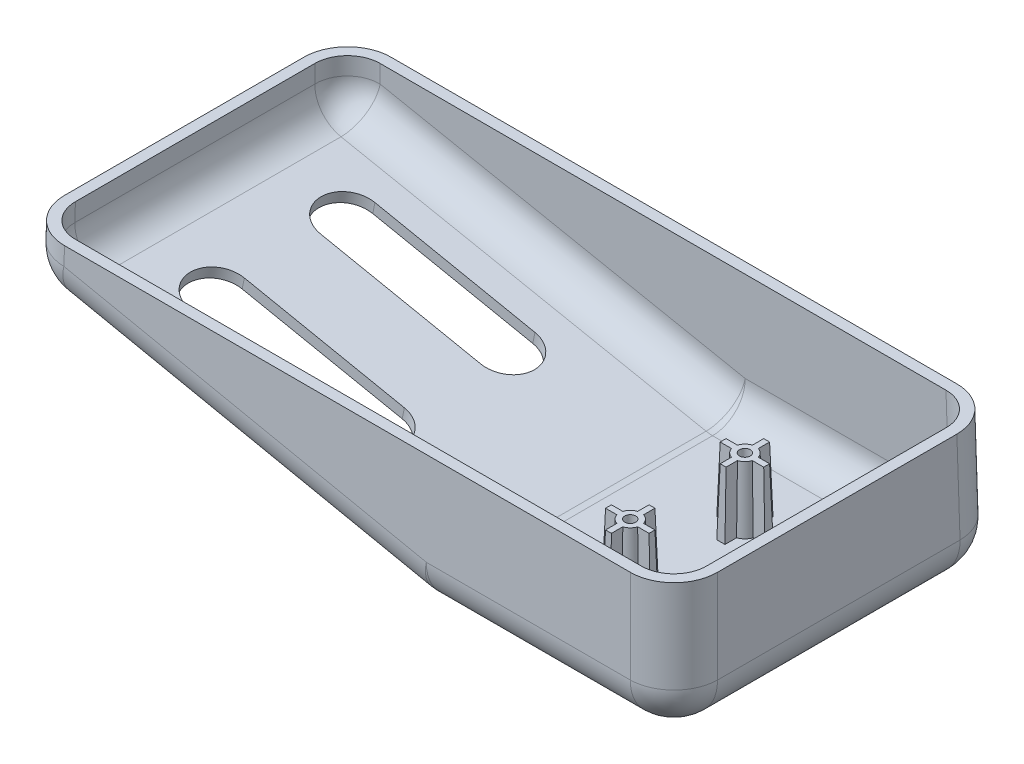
ISO-10303-21;
HEADER;
FILE_DESCRIPTION(('STEP AP214'),'2;1');
FILE_NAME('part.step','',(''),(''),'','','');
FILE_SCHEMA(('AUTOMOTIVE_DESIGN { 1 0 10303 214 1 1 1 1 }'));
ENDSEC;
DATA;
#1=APPLICATION_CONTEXT('core data for automotive mechanical design processes');
#2=APPLICATION_PROTOCOL_DEFINITION('international standard','automotive_design',2000,#1);
#3=PRODUCT_CONTEXT('',#1,'mechanical');
#4=PRODUCT('Part','Part','',(#3));
#5=PRODUCT_RELATED_PRODUCT_CATEGORY('part','',(#4));
#6=PRODUCT_DEFINITION_FORMATION('','',#4);
#7=PRODUCT_DEFINITION_CONTEXT('part definition',#1,'design');
#8=PRODUCT_DEFINITION('design','',#6,#7);
#9=PRODUCT_DEFINITION_SHAPE('','',#8);
#10=(LENGTH_UNIT() NAMED_UNIT(*) SI_UNIT(.MILLI.,.METRE.));
#11=(NAMED_UNIT(*) PLANE_ANGLE_UNIT() SI_UNIT($,.RADIAN.));
#12=(NAMED_UNIT(*) SI_UNIT($,.STERADIAN.) SOLID_ANGLE_UNIT());
#13=UNCERTAINTY_MEASURE_WITH_UNIT(LENGTH_MEASURE(1.E-05),#10,'distance_accuracy_value','');
#14=(GEOMETRIC_REPRESENTATION_CONTEXT(3) GLOBAL_UNCERTAINTY_ASSIGNED_CONTEXT((#13)) GLOBAL_UNIT_ASSIGNED_CONTEXT((#10,
#11,#12)) REPRESENTATION_CONTEXT('',''));
#15=CARTESIAN_POINT('',(0.,0.,0.));
#16=DIRECTION('',(0.,0.,1.));
#17=DIRECTION('',(1.,0.,0.));
#18=AXIS2_PLACEMENT_3D('',#15,#16,#17);
#19=CARTESIAN_POINT('',(0.,0.,30.));
#20=DIRECTION('',(0.,-1.,0.));
#21=DIRECTION('',(0.,0.,-1.));
#22=AXIS2_PLACEMENT_3D('',#19,#20,#21);
#23=PLANE('',#22);
#24=DIRECTION('',(-1.,0.,0.));
#25=VECTOR('',#24,1.);
#26=CARTESIAN_POINT('',(0.,0.,-30.));
#27=LINE('',#26,#25);
#28=CARTESIAN_POINT('',(112.001218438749,0.,-30.));
#29=VERTEX_POINT('',#28);
#30=CARTESIAN_POINT('',(7.99878156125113,0.,-30.));
#31=VERTEX_POINT('',#30);
#32=EDGE_CURVE('E768',#29,#31,#27,.T.);
#33=ORIENTED_EDGE('',*,*,#32,.T.);
#34=CARTESIAN_POINT('',(8.00121862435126,0.,-21.9987813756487));
#35=DIRECTION('',(0.,-1.,0.));
#36=DIRECTION('',(-0.707106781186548,0.,-0.707106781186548));
#37=AXIS2_PLACEMENT_3D('',#34,#35,#36);
#38=ELLIPSE('',#37,8.00243706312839,8.);
#39=CARTESIAN_POINT('',(0.,0.,-22.0012184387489));
#40=VERTEX_POINT('',#39);
#41=EDGE_CURVE('E804',#31,#40,#38,.F.);
#42=ORIENTED_EDGE('',*,*,#41,.T.);
#43=DIRECTION('',(0.,0.,-1.));
#44=VECTOR('',#43,1.);
#45=CARTESIAN_POINT('',(0.,0.,30.));
#46=LINE('',#45,#44);
#47=CARTESIAN_POINT('',(0.,0.,22.0012184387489));
#48=VERTEX_POINT('',#47);
#49=EDGE_CURVE('E774',#48,#40,#46,.T.);
#50=ORIENTED_EDGE('',*,*,#49,.F.);
#51=CARTESIAN_POINT('',(8.00121862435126,0.,21.9987813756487));
#52=DIRECTION('',(0.,-1.,0.));
#53=DIRECTION('',(-0.707106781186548,0.,0.707106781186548));
#54=AXIS2_PLACEMENT_3D('',#51,#52,#53);
#55=ELLIPSE('',#54,8.00243706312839,8.);
#56=CARTESIAN_POINT('',(7.99878156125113,0.,30.));
#57=VERTEX_POINT('',#56);
#58=EDGE_CURVE('E798',#48,#57,#55,.F.);
#59=ORIENTED_EDGE('',*,*,#58,.T.);
#60=DIRECTION('',(-1.,0.,0.));
#61=VECTOR('',#60,1.);
#62=CARTESIAN_POINT('',(0.,0.,30.));
#63=LINE('',#62,#61);
#64=CARTESIAN_POINT('',(112.001218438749,0.,30.));
#65=VERTEX_POINT('',#64);
#66=EDGE_CURVE('E769',#65,#57,#63,.T.);
#67=ORIENTED_EDGE('',*,*,#66,.F.);
#68=CARTESIAN_POINT('',(111.998781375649,0.,21.9987813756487));
#69=DIRECTION('',(0.,-1.,0.));
#70=DIRECTION('',(-0.707106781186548,0.,-0.707106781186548));
#71=AXIS2_PLACEMENT_3D('',#68,#69,#70);
#72=ELLIPSE('',#71,8.00243706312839,8.);
#73=CARTESIAN_POINT('',(120.,0.,22.0012184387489));
#74=VERTEX_POINT('',#73);
#75=EDGE_CURVE('E800',#65,#74,#72,.F.);
#76=ORIENTED_EDGE('',*,*,#75,.T.);
#77=DIRECTION('',(0.,0.,-1.));
#78=VECTOR('',#77,1.);
#79=CARTESIAN_POINT('',(120.,0.,30.));
#80=LINE('',#79,#78);
#81=CARTESIAN_POINT('',(120.,0.,-22.0012184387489));
#82=VERTEX_POINT('',#81);
#83=EDGE_CURVE('E780',#74,#82,#80,.T.);
#84=ORIENTED_EDGE('',*,*,#83,.T.);
#85=CARTESIAN_POINT('',(111.998781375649,0.,-21.9987813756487));
#86=DIRECTION('',(0.,-1.,0.));
#87=DIRECTION('',(-0.707106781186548,0.,0.707106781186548));
#88=AXIS2_PLACEMENT_3D('',#85,#86,#87);
#89=ELLIPSE('',#88,8.00243706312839,8.);
#90=EDGE_CURVE('E802',#82,#29,#89,.F.);
#91=ORIENTED_EDGE('',*,*,#90,.T.);
#92=EDGE_LOOP('',(#33,#42,#50,#59,#67,#76,#84,#91));
#93=FACE_BOUND('',#92,.T.);
#94=DIRECTION('',(-1.,0.,0.));
#95=VECTOR('',#94,1.);
#96=CARTESIAN_POINT('',(0.,0.,-27.9996953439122));
#97=LINE('',#96,#95);
#98=CARTESIAN_POINT('',(112.000609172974,0.,-27.9996953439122));
#99=VERTEX_POINT('',#98);
#100=CARTESIAN_POINT('',(7.99939082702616,0.,-27.9996953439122));
#101=VERTEX_POINT('',#100);
#102=EDGE_CURVE('E861',#99,#101,#97,.T.);
#103=ORIENTED_EDGE('',*,*,#102,.F.);
#104=CARTESIAN_POINT('',(111.998781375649,0.,-21.9987813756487));
#105=DIRECTION('',(0.,-1.,0.));
#106=DIRECTION('',(-0.707106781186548,0.,0.707106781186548));
#107=AXIS2_PLACEMENT_3D('',#104,#105,#106);
#108=ELLIPSE('',#107,6.0018277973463,6.);
#109=CARTESIAN_POINT('',(117.999695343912,0.,-22.0006091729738));
#110=VERTEX_POINT('',#109);
#111=EDGE_CURVE('E860',#110,#99,#108,.F.);
#112=ORIENTED_EDGE('',*,*,#111,.F.);
#113=DIRECTION('',(0.,0.,1.));
#114=VECTOR('',#113,1.);
#115=CARTESIAN_POINT('',(117.999695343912,0.,30.));
#116=LINE('',#115,#114);
#117=CARTESIAN_POINT('',(117.999695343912,0.,22.0006091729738));
#118=VERTEX_POINT('',#117);
#119=EDGE_CURVE('E868',#118,#110,#116,.F.);
#120=ORIENTED_EDGE('',*,*,#119,.F.);
#121=CARTESIAN_POINT('',(111.998781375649,0.,21.9987813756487));
#122=DIRECTION('',(0.,-1.,0.));
#123=DIRECTION('',(-0.707106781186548,0.,-0.707106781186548));
#124=AXIS2_PLACEMENT_3D('',#121,#122,#123);
#125=ELLIPSE('',#124,6.0018277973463,6.);
#126=CARTESIAN_POINT('',(112.000609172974,0.,27.9996953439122));
#127=VERTEX_POINT('',#126);
#128=EDGE_CURVE('E867',#127,#118,#125,.F.);
#129=ORIENTED_EDGE('',*,*,#128,.F.);
#130=DIRECTION('',(1.,0.,0.));
#131=VECTOR('',#130,1.);
#132=CARTESIAN_POINT('',(0.,0.,27.9996953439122));
#133=LINE('',#132,#131);
#134=CARTESIAN_POINT('',(7.99939082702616,0.,27.9996953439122));
#135=VERTEX_POINT('',#134);
#136=EDGE_CURVE('E864',#127,#135,#133,.F.);
#137=ORIENTED_EDGE('',*,*,#136,.T.);
#138=CARTESIAN_POINT('',(8.00121862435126,0.,21.9987813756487));
#139=DIRECTION('',(0.,-1.,0.));
#140=DIRECTION('',(-0.707106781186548,0.,0.707106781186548));
#141=AXIS2_PLACEMENT_3D('',#138,#139,#140);
#142=ELLIPSE('',#141,6.0018277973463,6.);
#143=CARTESIAN_POINT('',(2.00030465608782,0.,22.0006091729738));
#144=VERTEX_POINT('',#143);
#145=EDGE_CURVE('E873',#144,#135,#142,.F.);
#146=ORIENTED_EDGE('',*,*,#145,.F.);
#147=DIRECTION('',(0.,0.,1.));
#148=VECTOR('',#147,1.);
#149=CARTESIAN_POINT('',(2.00030465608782,0.,30.));
#150=LINE('',#149,#148);
#151=CARTESIAN_POINT('',(2.00030465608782,0.,-22.0006091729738));
#152=VERTEX_POINT('',#151);
#153=EDGE_CURVE('E871',#144,#152,#150,.F.);
#154=ORIENTED_EDGE('',*,*,#153,.T.);
#155=CARTESIAN_POINT('',(8.00121862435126,0.,-21.9987813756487));
#156=DIRECTION('',(0.,-1.,0.));
#157=DIRECTION('',(-0.707106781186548,0.,-0.707106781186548));
#158=AXIS2_PLACEMENT_3D('',#155,#156,#157);
#159=ELLIPSE('',#158,6.0018277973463,6.);
#160=EDGE_CURVE('E857',#101,#152,#159,.F.);
#161=ORIENTED_EDGE('',*,*,#160,.F.);
#162=EDGE_LOOP('',(#103,#112,#120,#129,#137,#146,#154,#161));
#163=FACE_BOUND('',#162,.T.);
#164=ADVANCED_FACE('F33',(#93,#163),#23,.F.);
#165=CARTESIAN_POINT('',(0.,0.,30.));
#166=DIRECTION('',(-0.999847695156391,0.0174524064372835,0.));
#167=DIRECTION('',(-0.0174524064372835,-0.999847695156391,0.));
#168=AXIS2_PLACEMENT_3D('',#165,#166,#167);
#169=PLANE('',#168);
#170=ORIENTED_EDGE('',*,*,#49,.T.);
#171=DIRECTION('',(-0.0174497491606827,-0.999695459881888,-0.0174497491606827));
#172=VECTOR('',#171,1.);
#173=CARTESIAN_POINT('',(-0.176370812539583,-10.1042770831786,-22.1775892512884));
#174=LINE('',#173,#172);
#175=CARTESIAN_POINT('',(-0.057730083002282,-3.30735424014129,-22.0589485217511));
#176=VERTEX_POINT('',#175);
#177=EDGE_CURVE('E787',#40,#176,#174,.T.);
#178=ORIENTED_EDGE('',*,*,#177,.T.);
#179=DIRECTION('',(0.,0.,-1.));
#180=VECTOR('',#179,1.);
#181=CARTESIAN_POINT('',(-0.057730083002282,-3.30735424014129,30.));
#182=LINE('',#181,#180);
#183=CARTESIAN_POINT('',(-0.057730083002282,-3.30735424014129,22.0589485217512));
#184=VERTEX_POINT('',#183);
#185=EDGE_CURVE('E785',#176,#184,#182,.F.);
#186=ORIENTED_EDGE('',*,*,#185,.T.);
#187=DIRECTION('',(0.0174497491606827,0.999695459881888,-0.0174497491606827));
#188=VECTOR('',#187,1.);
#189=CARTESIAN_POINT('',(-0.00243557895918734,-0.139534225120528,22.0036540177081));
#190=LINE('',#189,#188);
#191=EDGE_CURVE('E783',#184,#48,#190,.T.);
#192=ORIENTED_EDGE('',*,*,#191,.T.);
#193=EDGE_LOOP('',(#170,#178,#186,#192));
#194=FACE_BOUND('',#193,.T.);
#195=ADVANCED_FACE('F594',(#194),#169,.T.);
#196=CARTESIAN_POINT('',(74.,-25.,30.));
#197=DIRECTION('',(0.198662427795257,0.980067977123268,0.));
#198=DIRECTION('',(-0.980067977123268,0.198662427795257,0.));
#199=AXIS2_PLACEMENT_3D('',#196,#197,#198);
#200=PLANE('',#199);
#201=DIRECTION('',(0.980067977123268,-0.198662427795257,0.));
#202=VECTOR('',#201,1.);
#203=CARTESIAN_POINT('',(47.0563720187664,-19.5384537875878,7.));
#204=LINE('',#203,#202);
#205=CARTESIAN_POINT('',(17.6543327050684,-13.5785809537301,7.));
#206=VERTEX_POINT('',#205);
#207=CARTESIAN_POINT('',(47.0563720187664,-19.5384537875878,7.));
#208=VERTEX_POINT('',#207);
#209=EDGE_CURVE('E1031',#206,#208,#204,.T.);
#210=ORIENTED_EDGE('',*,*,#209,.F.);
#211=CARTESIAN_POINT('',(17.6543327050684,-13.5785809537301,12.));
#212=DIRECTION('',(0.198662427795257,0.980067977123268,0.));
#213=DIRECTION('',(-0.980067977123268,0.198662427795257,0.));
#214=AXIS2_PLACEMENT_3D('',#211,#212,#213);
#215=CIRCLE('',#214,5.);
#216=CARTESIAN_POINT('',(17.6543327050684,-13.5785809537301,17.));
#217=VERTEX_POINT('',#216);
#218=EDGE_CURVE('E1028',#217,#206,#215,.F.);
#219=ORIENTED_EDGE('',*,*,#218,.F.);
#220=DIRECTION('',(-0.980067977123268,0.198662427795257,0.));
#221=VECTOR('',#220,1.);
#222=CARTESIAN_POINT('',(17.6543327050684,-13.5785809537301,17.));
#223=LINE('',#222,#221);
#224=CARTESIAN_POINT('',(47.0563720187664,-19.5384537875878,17.));
#225=VERTEX_POINT('',#224);
#226=EDGE_CURVE('E1005',#225,#217,#223,.T.);
#227=ORIENTED_EDGE('',*,*,#226,.F.);
#228=CARTESIAN_POINT('',(47.0563720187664,-19.5384537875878,12.));
#229=DIRECTION('',(0.198662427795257,0.980067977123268,0.));
#230=DIRECTION('',(-0.980067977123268,0.198662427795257,0.));
#231=AXIS2_PLACEMENT_3D('',#228,#229,#230);
#232=CIRCLE('',#231,5.);
#233=EDGE_CURVE('E1034',#208,#225,#232,.F.);
#234=ORIENTED_EDGE('',*,*,#233,.F.);
#235=EDGE_LOOP('',(#210,#219,#227,#234));
#236=FACE_BOUND('',#235,.T.);
#237=DIRECTION('',(0.980067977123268,-0.198662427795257,0.));
#238=VECTOR('',#237,1.);
#239=CARTESIAN_POINT('',(17.6543327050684,-13.5785809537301,-17.));
#240=LINE('',#239,#238);
#241=CARTESIAN_POINT('',(17.6543327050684,-13.5785809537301,-17.));
#242=VERTEX_POINT('',#241);
#243=CARTESIAN_POINT('',(47.0563720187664,-19.5384537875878,-17.));
#244=VERTEX_POINT('',#243);
#245=EDGE_CURVE('E1000',#242,#244,#240,.T.);
#246=ORIENTED_EDGE('',*,*,#245,.F.);
#247=CARTESIAN_POINT('',(17.6543327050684,-13.5785809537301,-12.));
#248=DIRECTION('',(0.198662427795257,0.980067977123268,0.));
#249=DIRECTION('',(-0.980067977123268,0.198662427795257,0.));
#250=AXIS2_PLACEMENT_3D('',#247,#248,#249);
#251=CIRCLE('',#250,5.);
#252=CARTESIAN_POINT('',(17.6543327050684,-13.5785809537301,-7.));
#253=VERTEX_POINT('',#252);
#254=EDGE_CURVE('E997',#253,#242,#251,.F.);
#255=ORIENTED_EDGE('',*,*,#254,.F.);
#256=DIRECTION('',(-0.980067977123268,0.198662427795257,0.));
#257=VECTOR('',#256,1.);
#258=CARTESIAN_POINT('',(47.0563720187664,-19.5384537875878,-7.));
#259=LINE('',#258,#257);
#260=CARTESIAN_POINT('',(47.0563720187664,-19.5384537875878,-7.));
#261=VERTEX_POINT('',#260);
#262=EDGE_CURVE('E883',#261,#253,#259,.T.);
#263=ORIENTED_EDGE('',*,*,#262,.F.);
#264=CARTESIAN_POINT('',(47.0563720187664,-19.5384537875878,-12.));
#265=DIRECTION('',(0.198662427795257,0.980067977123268,0.));
#266=DIRECTION('',(-0.980067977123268,0.198662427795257,0.));
#267=AXIS2_PLACEMENT_3D('',#264,#265,#266);
#268=CIRCLE('',#267,5.);
#269=EDGE_CURVE('E1003',#244,#261,#268,.F.);
#270=ORIENTED_EDGE('',*,*,#269,.F.);
#271=EDGE_LOOP('',(#246,#255,#263,#270));
#272=FACE_BOUND('',#271,.T.);
#273=DIRECTION('',(0.980062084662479,-0.19866123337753,-0.00346764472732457));
#274=VECTOR('',#273,1.);
#275=CARTESIAN_POINT('',(74.0276573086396,-25.0056062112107,-22.2983986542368));
#276=LINE('',#275,#274);
#277=CARTESIAN_POINT('',(6.35175205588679,-11.2875173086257,-22.0589485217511));
#278=VERTEX_POINT('',#277);
#279=CARTESIAN_POINT('',(73.2133494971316,-24.8405438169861,-22.2955174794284));
#280=VERTEX_POINT('',#279);
#281=EDGE_CURVE('E810',#278,#280,#276,.T.);
#282=ORIENTED_EDGE('',*,*,#281,.T.);
#283=DIRECTION('',(0.,0.,-1.));
#284=VECTOR('',#283,1.);
#285=CARTESIAN_POINT('',(73.2133494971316,-24.8405438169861,30.));
#286=LINE('',#285,#284);
#287=CARTESIAN_POINT('',(73.2133494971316,-24.8405438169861,22.2955174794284));
#288=VERTEX_POINT('',#287);
#289=EDGE_CURVE('E813',#280,#288,#286,.F.);
#290=ORIENTED_EDGE('',*,*,#289,.T.);
#291=DIRECTION('',(-0.980062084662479,0.19866123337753,-0.00346764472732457));
#292=VECTOR('',#291,1.);
#293=CARTESIAN_POINT('',(74.0261742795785,-25.0053055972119,22.298393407));
#294=LINE('',#293,#292);
#295=CARTESIAN_POINT('',(6.35175205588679,-11.2875173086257,22.0589485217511));
#296=VERTEX_POINT('',#295);
#297=EDGE_CURVE('E808',#288,#296,#294,.T.);
#298=ORIENTED_EDGE('',*,*,#297,.T.);
#299=DIRECTION('',(0.,0.,1.));
#300=VECTOR('',#299,1.);
#301=CARTESIAN_POINT('',(6.3517520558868,-11.2875173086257,30.));
#302=LINE('',#301,#300);
#303=EDGE_CURVE('E806',#296,#278,#302,.F.);
#304=ORIENTED_EDGE('',*,*,#303,.T.);
#305=EDGE_LOOP('',(#282,#290,#298,#304));
#306=FACE_BOUND('',#305,.T.);
#307=ADVANCED_FACE('F600',(#236,#272,#306),#200,.F.);
#308=CARTESIAN_POINT('',(120.,-25.,30.));
#309=DIRECTION('',(0.,1.,0.));
#310=DIRECTION('',(-1.,0.,0.));
#311=AXIS2_PLACEMENT_3D('',#308,#309,#310);
#312=PLANE('',#311);
#313=DIRECTION('',(1.,0.,0.));
#314=VECTOR('',#313,1.);
#315=CARTESIAN_POINT('',(120.436376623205,-25.,-22.2955174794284));
#316=LINE('',#315,#314);
#317=CARTESIAN_POINT('',(74.8026489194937,-25.,-22.2955174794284));
#318=VERTEX_POINT('',#317);
#319=CARTESIAN_POINT('',(112.295517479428,-25.,-22.2955174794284));
#320=VERTEX_POINT('',#319);
#321=EDGE_CURVE('E719',#318,#320,#316,.T.);
#322=ORIENTED_EDGE('',*,*,#321,.T.);
#323=DIRECTION('',(0.,0.,1.));
#324=VECTOR('',#323,1.);
#325=CARTESIAN_POINT('',(112.295517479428,-25.,30.));
#326=LINE('',#325,#324);
#327=CARTESIAN_POINT('',(112.295517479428,-25.,22.2955174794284));
#328=VERTEX_POINT('',#327);
#329=EDGE_CURVE('E715',#320,#328,#326,.T.);
#330=ORIENTED_EDGE('',*,*,#329,.T.);
#331=DIRECTION('',(-1.,0.,0.));
#332=VECTOR('',#331,1.);
#333=CARTESIAN_POINT('',(120.,-25.,22.2955174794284));
#334=LINE('',#333,#332);
#335=CARTESIAN_POINT('',(74.8026489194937,-25.,22.2955174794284));
#336=VERTEX_POINT('',#335);
#337=EDGE_CURVE('E817',#328,#336,#334,.T.);
#338=ORIENTED_EDGE('',*,*,#337,.T.);
#339=DIRECTION('',(0.,0.,-1.));
#340=VECTOR('',#339,1.);
#341=CARTESIAN_POINT('',(74.8026489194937,-25.,30.));
#342=LINE('',#341,#340);
#343=EDGE_CURVE('E815',#336,#318,#342,.T.);
#344=ORIENTED_EDGE('',*,*,#343,.T.);
#345=EDGE_LOOP('',(#322,#330,#338,#344));
#346=FACE_BOUND('',#345,.T.);
#347=ADVANCED_FACE('F609',(#346),#312,.F.);
#348=CARTESIAN_POINT('',(120.,0.,30.));
#349=DIRECTION('',(0.999847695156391,0.0174524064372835,0.));
#350=DIRECTION('',(-0.0174524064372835,0.999847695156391,0.));
#351=AXIS2_PLACEMENT_3D('',#348,#349,#350);
#352=PLANE('',#351);
#353=DIRECTION('',(0.,0.,-1.));
#354=VECTOR('',#353,1.);
#355=CARTESIAN_POINT('',(120.29429904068,-16.8603807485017,30.));
#356=LINE('',#355,#354);
#357=CARTESIAN_POINT('',(120.29429904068,-16.8603807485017,22.2955174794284));
#358=VERTEX_POINT('',#357);
#359=CARTESIAN_POINT('',(120.29429904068,-16.8603807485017,-22.2955174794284));
#360=VERTEX_POINT('',#359);
#361=EDGE_CURVE('E709',#358,#360,#356,.T.);
#362=ORIENTED_EDGE('',*,*,#361,.T.);
#363=DIRECTION('',(-0.0174497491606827,0.999695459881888,0.0174497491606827));
#364=VECTOR('',#363,1.);
#365=CARTESIAN_POINT('',(120.002435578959,-0.139534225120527,-22.0036540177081));
#366=LINE('',#365,#364);
#367=EDGE_CURVE('E717',#360,#82,#366,.T.);
#368=ORIENTED_EDGE('',*,*,#367,.T.);
#369=ORIENTED_EDGE('',*,*,#83,.F.);
#370=DIRECTION('',(0.0174497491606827,-0.999695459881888,0.0174497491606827));
#371=VECTOR('',#370,1.);
#372=CARTESIAN_POINT('',(120.002435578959,-0.139534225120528,22.0036540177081));
#373=LINE('',#372,#371);
#374=EDGE_CURVE('E714',#74,#358,#373,.T.);
#375=ORIENTED_EDGE('',*,*,#374,.T.);
#376=EDGE_LOOP('',(#362,#368,#369,#375));
#377=FACE_BOUND('',#376,.T.);
#378=ADVANCED_FACE('F612',(#377),#352,.T.);
#379=CARTESIAN_POINT('',(0.,0.,30.));
#380=DIRECTION('',(0.,0.0174524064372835,0.999847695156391));
#381=DIRECTION('',(0.,-0.999847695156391,0.0174524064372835));
#382=AXIS2_PLACEMENT_3D('',#379,#380,#381);
#383=PLANE('',#382);
#384=DIRECTION('',(1.,0.,0.));
#385=VECTOR('',#384,1.);
#386=CARTESIAN_POINT('',(0.,-16.8603807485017,30.2942990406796));
#387=LINE('',#386,#385);
#388=CARTESIAN_POINT('',(74.8026489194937,-16.8603807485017,30.2942990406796));
#389=VERTEX_POINT('',#388);
#390=CARTESIAN_POINT('',(112.295517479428,-16.8603807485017,30.2942990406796));
#391=VERTEX_POINT('',#390);
#392=EDGE_CURVE('E42',#389,#391,#387,.T.);
#393=ORIENTED_EDGE('',*,*,#392,.T.);
#394=DIRECTION('',(0.0174497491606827,-0.999695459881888,0.0174497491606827));
#395=VECTOR('',#394,1.);
#396=CARTESIAN_POINT('',(111.967114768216,1.95379797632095,29.9658963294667));
#397=LINE('',#396,#395);
#398=EDGE_CURVE('E12',#391,#65,#397,.F.);
#399=ORIENTED_EDGE('',*,*,#398,.T.);
#400=ORIENTED_EDGE('',*,*,#66,.T.);
#401=DIRECTION('',(0.0174497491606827,0.999695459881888,-0.0174497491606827));
#402=VECTOR('',#401,1.);
#403=CARTESIAN_POINT('',(7.99634598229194,-0.139534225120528,30.0024355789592));
#404=LINE('',#403,#402);
#405=CARTESIAN_POINT('',(7.94105147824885,-3.30735424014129,30.0577300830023));
#406=VERTEX_POINT('',#405);
#407=EDGE_CURVE('E724',#57,#406,#404,.F.);
#408=ORIENTED_EDGE('',*,*,#407,.T.);
#409=DIRECTION('',(0.980062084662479,-0.19866123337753,0.00346764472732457));
#410=VECTOR('',#409,1.);
#411=CARTESIAN_POINT('',(-0.330639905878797,-1.63066004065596,30.0284632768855));
#412=LINE('',#411,#410);
#413=EDGE_CURVE('E726',#406,#389,#412,.T.);
#414=ORIENTED_EDGE('',*,*,#413,.T.);
#415=EDGE_LOOP('',(#393,#399,#400,#408,#414));
#416=FACE_BOUND('',#415,.T.);
#417=ADVANCED_FACE('F620',(#416),#383,.T.);
#418=CARTESIAN_POINT('',(0.,0.,-30.));
#419=DIRECTION('',(0.,0.0174524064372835,-0.999847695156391));
#420=DIRECTION('',(0.,0.999847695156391,0.0174524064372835));
#421=AXIS2_PLACEMENT_3D('',#418,#419,#420);
#422=PLANE('',#421);
#423=DIRECTION('',(0.980062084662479,-0.19866123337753,-0.00346764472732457));
#424=VECTOR('',#423,1.);
#425=CARTESIAN_POINT('',(1.44302149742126,-1.99018600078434,-30.0347388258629));
#426=LINE('',#425,#424);
#427=CARTESIAN_POINT('',(74.8026489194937,-16.8603807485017,-30.2942990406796));
#428=VERTEX_POINT('',#427);
#429=CARTESIAN_POINT('',(7.94105147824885,-3.30735424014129,-30.0577300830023));
#430=VERTEX_POINT('',#429);
#431=EDGE_CURVE('E794',#428,#430,#426,.F.);
#432=ORIENTED_EDGE('',*,*,#431,.T.);
#433=DIRECTION('',(0.0174497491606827,0.999695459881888,0.0174497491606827));
#434=VECTOR('',#433,1.);
#435=CARTESIAN_POINT('',(7.99634598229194,-0.139534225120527,-30.0024355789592));
#436=LINE('',#435,#434);
#437=EDGE_CURVE('E796',#430,#31,#436,.T.);
#438=ORIENTED_EDGE('',*,*,#437,.T.);
#439=ORIENTED_EDGE('',*,*,#32,.F.);
#440=DIRECTION('',(0.0174497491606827,-0.999695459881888,-0.0174497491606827));
#441=VECTOR('',#440,1.);
#442=CARTESIAN_POINT('',(112.440030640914,-25.1395342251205,-30.4388122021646));
#443=LINE('',#442,#441);
#444=CARTESIAN_POINT('',(112.295517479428,-16.8603807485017,-30.2942990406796));
#445=VERTEX_POINT('',#444);
#446=EDGE_CURVE('E790',#29,#445,#443,.T.);
#447=ORIENTED_EDGE('',*,*,#446,.T.);
#448=DIRECTION('',(1.,0.,0.));
#449=VECTOR('',#448,1.);
#450=CARTESIAN_POINT('',(74.,-16.8603807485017,-30.2942990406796));
#451=LINE('',#450,#449);
#452=EDGE_CURVE('E792',#445,#428,#451,.F.);
#453=ORIENTED_EDGE('',*,*,#452,.T.);
#454=EDGE_LOOP('',(#432,#438,#439,#447,#453));
#455=FACE_BOUND('',#454,.T.);
#456=ADVANCED_FACE('F617',(#455),#422,.T.);
#457=CARTESIAN_POINT('',(111.967114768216,1.81417872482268,21.9671147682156));
#458=DIRECTION('',(-0.0174497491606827,0.999695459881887,-0.0174497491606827));
#459=DIRECTION('',(0.,0.0174524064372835,0.999847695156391));
#460=AXIS2_PLACEMENT_3D('',#457,#458,#459);
#461=CYLINDRICAL_SURFACE('',#460,8.);
#462=CARTESIAN_POINT('',(112.295517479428,-17.,22.2955174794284));
#463=DIRECTION('',(0.0174497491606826,-0.999695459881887,0.0174497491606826));
#464=DIRECTION('',(0.999847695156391,0.0174524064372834,0.));
#465=AXIS2_PLACEMENT_3D('',#462,#463,#464);
#466=CIRCLE('',#465,8.);
#467=EDGE_CURVE('E37',#358,#391,#466,.T.);
#468=ORIENTED_EDGE('',*,*,#467,.F.);
#469=ORIENTED_EDGE('',*,*,#374,.F.);
#470=ORIENTED_EDGE('',*,*,#75,.F.);
#471=ORIENTED_EDGE('',*,*,#398,.F.);
#472=EDGE_LOOP('',(#468,#469,#470,#471));
#473=FACE_BOUND('',#472,.T.);
#474=ADVANCED_FACE('F35',(#473),#461,.T.);
#475=CARTESIAN_POINT('',(112.295517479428,-17.,22.2955174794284));
#476=DIRECTION('',(0.,0.,1.));
#477=DIRECTION('',(1.,0.,0.));
#478=AXIS2_PLACEMENT_3D('',#475,#476,#477);
#479=SPHERICAL_SURFACE('',#478,8.);
#480=CARTESIAN_POINT('',(112.295517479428,-17.,22.2955174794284));
#481=DIRECTION('',(0.,0.,1.));
#482=DIRECTION('',(1.,0.,0.));
#483=AXIS2_PLACEMENT_3D('',#480,#481,#482);
#484=CIRCLE('',#483,8.);
#485=EDGE_CURVE('E699',#358,#328,#484,.F.);
#486=ORIENTED_EDGE('',*,*,#485,.F.);
#487=ORIENTED_EDGE('',*,*,#467,.T.);
#488=CARTESIAN_POINT('',(112.295517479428,-17.,22.2955174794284));
#489=DIRECTION('',(1.,0.,0.));
#490=DIRECTION('',(0.,0.,-1.));
#491=AXIS2_PLACEMENT_3D('',#488,#489,#490);
#492=CIRCLE('',#491,8.);
#493=EDGE_CURVE('E703',#328,#391,#492,.F.);
#494=ORIENTED_EDGE('',*,*,#493,.F.);
#495=EDGE_LOOP('',(#486,#487,#494));
#496=FACE_BOUND('',#495,.T.);
#497=ADVANCED_FACE('F687',(#496),#479,.T.);
#498=CARTESIAN_POINT('',(0.,-17.,22.2955174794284));
#499=DIRECTION('',(-1.,0.,0.));
#500=DIRECTION('',(0.,-1.,0.));
#501=AXIS2_PLACEMENT_3D('',#498,#499,#500);
#502=CYLINDRICAL_SURFACE('',#501,8.);
#503=ORIENTED_EDGE('',*,*,#493,.T.);
#504=ORIENTED_EDGE('',*,*,#392,.F.);
#505=CARTESIAN_POINT('',(74.8026489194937,-17.,22.2955174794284));
#506=DIRECTION('',(-1.,0.,0.));
#507=DIRECTION('',(0.,0.,1.));
#508=AXIS2_PLACEMENT_3D('',#505,#506,#507);
#509=CIRCLE('',#508,8.);
#510=EDGE_CURVE('E706',#336,#389,#509,.T.);
#511=ORIENTED_EDGE('',*,*,#510,.F.);
#512=ORIENTED_EDGE('',*,*,#337,.F.);
#513=EDGE_LOOP('',(#503,#504,#511,#512));
#514=FACE_BOUND('',#513,.T.);
#515=ADVANCED_FACE('F684',(#514),#502,.T.);
#516=CARTESIAN_POINT('',(112.295517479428,-17.,30.));
#517=DIRECTION('',(0.,0.,1.));
#518=DIRECTION('',(1.,0.,0.));
#519=AXIS2_PLACEMENT_3D('',#516,#517,#518);
#520=CYLINDRICAL_SURFACE('',#519,8.);
#521=ORIENTED_EDGE('',*,*,#485,.T.);
#522=ORIENTED_EDGE('',*,*,#329,.F.);
#523=CARTESIAN_POINT('',(112.295517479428,-17.,-22.2955174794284));
#524=DIRECTION('',(0.,0.,-1.));
#525=DIRECTION('',(0.,1.,0.));
#526=AXIS2_PLACEMENT_3D('',#523,#524,#525);
#527=CIRCLE('',#526,8.);
#528=EDGE_CURVE('E711',#360,#320,#527,.T.);
#529=ORIENTED_EDGE('',*,*,#528,.F.);
#530=ORIENTED_EDGE('',*,*,#361,.F.);
#531=EDGE_LOOP('',(#521,#522,#529,#530));
#532=FACE_BOUND('',#531,.T.);
#533=ADVANCED_FACE('F680',(#532),#520,.T.);
#534=CARTESIAN_POINT('',(111.985384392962,0.767512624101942,-21.9853843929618));
#535=DIRECTION('',(-0.0174497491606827,0.999695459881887,0.0174497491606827));
#536=DIRECTION('',(0.,-0.0174524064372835,0.999847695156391));
#537=AXIS2_PLACEMENT_3D('',#534,#535,#536);
#538=CYLINDRICAL_SURFACE('',#537,8.);
#539=ORIENTED_EDGE('',*,*,#90,.F.);
#540=ORIENTED_EDGE('',*,*,#367,.F.);
#541=CARTESIAN_POINT('',(112.295517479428,-17.,-22.2955174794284));
#542=DIRECTION('',(0.0174497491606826,-0.999695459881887,-0.0174497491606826));
#543=DIRECTION('',(0.999847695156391,0.0174524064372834,0.));
#544=AXIS2_PLACEMENT_3D('',#541,#542,#543);
#545=CIRCLE('',#544,8.);
#546=EDGE_CURVE('E763',#445,#360,#545,.T.);
#547=ORIENTED_EDGE('',*,*,#546,.F.);
#548=ORIENTED_EDGE('',*,*,#446,.F.);
#549=EDGE_LOOP('',(#539,#540,#547,#548));
#550=FACE_BOUND('',#549,.T.);
#551=ADVANCED_FACE('F676',(#550),#538,.T.);
#552=CARTESIAN_POINT('',(74.8026489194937,-17.,22.2955174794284));
#553=DIRECTION('',(0.,0.,1.));
#554=DIRECTION('',(1.,0.,0.));
#555=AXIS2_PLACEMENT_3D('',#552,#553,#554);
#556=SPHERICAL_SURFACE('',#555,8.);
#557=CARTESIAN_POINT('',(74.8026489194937,-17.,22.2955174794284));
#558=DIRECTION('',(0.,0.,1.));
#559=DIRECTION('',(1.,0.,0.));
#560=AXIS2_PLACEMENT_3D('',#557,#558,#559);
#561=CIRCLE('',#560,8.);
#562=EDGE_CURVE('E757',#336,#288,#561,.F.);
#563=ORIENTED_EDGE('',*,*,#562,.F.);
#564=ORIENTED_EDGE('',*,*,#510,.T.);
#565=CARTESIAN_POINT('',(74.8026489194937,-17.,22.2955174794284));
#566=DIRECTION('',(0.98006208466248,-0.198661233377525,0.00346764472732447));
#567=DIRECTION('',(0.198662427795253,0.980067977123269,0.));
#568=AXIS2_PLACEMENT_3D('',#565,#566,#567);
#569=CIRCLE('',#568,8.);
#570=EDGE_CURVE('E760',#288,#389,#569,.F.);
#571=ORIENTED_EDGE('',*,*,#570,.F.);
#572=EDGE_LOOP('',(#563,#564,#571));
#573=FACE_BOUND('',#572,.T.);
#574=ADVANCED_FACE('F672',(#573),#556,.T.);
#575=CARTESIAN_POINT('',(112.295517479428,-17.,-22.2955174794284));
#576=DIRECTION('',(0.,0.,1.));
#577=DIRECTION('',(1.,0.,0.));
#578=AXIS2_PLACEMENT_3D('',#575,#576,#577);
#579=SPHERICAL_SURFACE('',#578,8.);
#580=ORIENTED_EDGE('',*,*,#546,.T.);
#581=ORIENTED_EDGE('',*,*,#528,.T.);
#582=CARTESIAN_POINT('',(112.295517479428,-17.,-22.2955174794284));
#583=DIRECTION('',(1.,0.,0.));
#584=DIRECTION('',(0.,0.,-1.));
#585=AXIS2_PLACEMENT_3D('',#582,#583,#584);
#586=CIRCLE('',#585,8.);
#587=EDGE_CURVE('E755',#445,#320,#586,.F.);
#588=ORIENTED_EDGE('',*,*,#587,.F.);
#589=EDGE_LOOP('',(#580,#581,#588));
#590=FACE_BOUND('',#589,.T.);
#591=ADVANCED_FACE('F668',(#590),#579,.T.);
#592=CARTESIAN_POINT('',(7.99634598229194,-0.279153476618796,22.0036540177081));
#593=DIRECTION('',(-0.0174497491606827,-0.999695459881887,0.0174497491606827));
#594=DIRECTION('',(0.,-0.0174524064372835,-0.999847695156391));
#595=AXIS2_PLACEMENT_3D('',#592,#593,#594);
#596=CYLINDRICAL_SURFACE('',#595,8.);
#597=ORIENTED_EDGE('',*,*,#58,.F.);
#598=ORIENTED_EDGE('',*,*,#191,.F.);
#599=CARTESIAN_POINT('',(7.94105147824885,-3.44697349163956,22.0589485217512));
#600=DIRECTION('',(-0.0174497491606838,-0.999695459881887,0.0174497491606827));
#601=DIRECTION('',(0.999847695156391,-0.0174524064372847,0.));
#602=AXIS2_PLACEMENT_3D('',#599,#600,#601);
#603=CIRCLE('',#602,8.);
#604=EDGE_CURVE('E752',#406,#184,#603,.T.);
#605=ORIENTED_EDGE('',*,*,#604,.F.);
#606=ORIENTED_EDGE('',*,*,#407,.F.);
#607=EDGE_LOOP('',(#597,#598,#605,#606));
#608=FACE_BOUND('',#607,.T.);
#609=ADVANCED_FACE('F664',(#608),#596,.T.);
#610=CARTESIAN_POINT('',(-0.330639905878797,-1.77027929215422,22.0296817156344));
#611=DIRECTION('',(-0.980062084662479,0.19866123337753,-0.00346764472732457));
#612=DIRECTION('',(-0.198662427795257,-0.980067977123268,0.));
#613=AXIS2_PLACEMENT_3D('',#610,#611,#612);
#614=CYLINDRICAL_SURFACE('',#613,8.);
#615=ORIENTED_EDGE('',*,*,#570,.T.);
#616=ORIENTED_EDGE('',*,*,#413,.F.);
#617=CARTESIAN_POINT('',(7.94105147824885,-3.44697349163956,22.0589485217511));
#618=DIRECTION('',(-0.980062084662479,0.19866123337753,-0.00346764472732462));
#619=DIRECTION('',(-0.198662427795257,-0.980067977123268,0.));
#620=AXIS2_PLACEMENT_3D('',#617,#618,#619);
#621=CIRCLE('',#620,8.);
#622=EDGE_CURVE('E749',#296,#406,#621,.T.);
#623=ORIENTED_EDGE('',*,*,#622,.F.);
#624=ORIENTED_EDGE('',*,*,#297,.F.);
#625=EDGE_LOOP('',(#615,#616,#623,#624));
#626=FACE_BOUND('',#625,.T.);
#627=ADVANCED_FACE('F660',(#626),#614,.T.);
#628=CARTESIAN_POINT('',(74.8026489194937,-17.,30.));
#629=DIRECTION('',(0.,0.,-1.));
#630=DIRECTION('',(-1.,0.,0.));
#631=AXIS2_PLACEMENT_3D('',#628,#629,#630);
#632=CYLINDRICAL_SURFACE('',#631,8.);
#633=ORIENTED_EDGE('',*,*,#562,.T.);
#634=ORIENTED_EDGE('',*,*,#289,.F.);
#635=CARTESIAN_POINT('',(74.8026489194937,-17.,-22.2955174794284));
#636=DIRECTION('',(0.,0.,-1.));
#637=DIRECTION('',(-1.,0.,0.));
#638=AXIS2_PLACEMENT_3D('',#635,#636,#637);
#639=CIRCLE('',#638,8.);
#640=EDGE_CURVE('E746',#318,#280,#639,.T.);
#641=ORIENTED_EDGE('',*,*,#640,.F.);
#642=ORIENTED_EDGE('',*,*,#343,.F.);
#643=EDGE_LOOP('',(#633,#634,#641,#642));
#644=FACE_BOUND('',#643,.T.);
#645=ADVANCED_FACE('F656',(#644),#632,.T.);
#646=CARTESIAN_POINT('',(120.,-17.,-22.2955174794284));
#647=DIRECTION('',(-1.,0.,0.));
#648=DIRECTION('',(0.,-1.,0.));
#649=AXIS2_PLACEMENT_3D('',#646,#647,#648);
#650=CYLINDRICAL_SURFACE('',#649,8.);
#651=ORIENTED_EDGE('',*,*,#587,.T.);
#652=ORIENTED_EDGE('',*,*,#321,.F.);
#653=CARTESIAN_POINT('',(74.8026489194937,-17.,-22.2955174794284));
#654=DIRECTION('',(-1.,0.,0.));
#655=DIRECTION('',(0.,0.,1.));
#656=AXIS2_PLACEMENT_3D('',#653,#654,#655);
#657=CIRCLE('',#656,8.);
#658=EDGE_CURVE('E743',#428,#318,#657,.T.);
#659=ORIENTED_EDGE('',*,*,#658,.F.);
#660=ORIENTED_EDGE('',*,*,#452,.F.);
#661=EDGE_LOOP('',(#651,#652,#659,#660));
#662=FACE_BOUND('',#661,.T.);
#663=ADVANCED_FACE('F652',(#662),#650,.T.);
#664=CARTESIAN_POINT('',(7.94105147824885,-3.44697349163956,22.0589485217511));
#665=DIRECTION('',(0.,0.,1.));
#666=DIRECTION('',(1.,0.,0.));
#667=AXIS2_PLACEMENT_3D('',#664,#665,#666);
#668=SPHERICAL_SURFACE('',#667,8.);
#669=ORIENTED_EDGE('',*,*,#622,.T.);
#670=ORIENTED_EDGE('',*,*,#604,.T.);
#671=CARTESIAN_POINT('',(7.94105147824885,-3.44697349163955,22.0589485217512));
#672=DIRECTION('',(0.,0.,1.));
#673=DIRECTION('',(0.,-1.,0.));
#674=AXIS2_PLACEMENT_3D('',#671,#672,#673);
#675=CIRCLE('',#674,8.);
#676=EDGE_CURVE('E740',#296,#184,#675,.F.);
#677=ORIENTED_EDGE('',*,*,#676,.F.);
#678=EDGE_LOOP('',(#669,#670,#677));
#679=FACE_BOUND('',#678,.T.);
#680=ADVANCED_FACE('F648',(#679),#668,.T.);
#681=CARTESIAN_POINT('',(74.8026489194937,-17.,-22.2955174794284));
#682=DIRECTION('',(0.,0.,1.));
#683=DIRECTION('',(1.,0.,0.));
#684=AXIS2_PLACEMENT_3D('',#681,#682,#683);
#685=SPHERICAL_SURFACE('',#684,8.);
#686=ORIENTED_EDGE('',*,*,#658,.T.);
#687=ORIENTED_EDGE('',*,*,#640,.T.);
#688=CARTESIAN_POINT('',(74.8026489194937,-17.,-22.2955174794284));
#689=DIRECTION('',(0.980062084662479,-0.198661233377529,-0.00346764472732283));
#690=DIRECTION('',(0.198662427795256,0.980067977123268,0.));
#691=AXIS2_PLACEMENT_3D('',#688,#689,#690);
#692=CIRCLE('',#691,8.);
#693=EDGE_CURVE('E738',#428,#280,#692,.F.);
#694=ORIENTED_EDGE('',*,*,#693,.F.);
#695=EDGE_LOOP('',(#686,#687,#694));
#696=FACE_BOUND('',#695,.T.);
#697=ADVANCED_FACE('F644',(#696),#685,.T.);
#698=CARTESIAN_POINT('',(7.94105147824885,-3.44697349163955,30.));
#699=DIRECTION('',(0.,0.,1.));
#700=DIRECTION('',(1.,0.,0.));
#701=AXIS2_PLACEMENT_3D('',#698,#699,#700);
#702=CYLINDRICAL_SURFACE('',#701,8.);
#703=ORIENTED_EDGE('',*,*,#676,.T.);
#704=ORIENTED_EDGE('',*,*,#185,.F.);
#705=CARTESIAN_POINT('',(7.94105147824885,-3.44697349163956,-22.0589485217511));
#706=DIRECTION('',(0.,0.,-1.));
#707=DIRECTION('',(-1.,0.,0.));
#708=AXIS2_PLACEMENT_3D('',#705,#706,#707);
#709=CIRCLE('',#708,8.);
#710=EDGE_CURVE('E735',#278,#176,#709,.T.);
#711=ORIENTED_EDGE('',*,*,#710,.F.);
#712=ORIENTED_EDGE('',*,*,#303,.F.);
#713=EDGE_LOOP('',(#703,#704,#711,#712));
#714=FACE_BOUND('',#713,.T.);
#715=ADVANCED_FACE('F640',(#714),#702,.T.);
#716=CARTESIAN_POINT('',(75.4115632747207,-17.123428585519,-22.2976719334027));
#717=DIRECTION('',(-0.980062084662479,0.19866123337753,0.00346764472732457));
#718=DIRECTION('',(-0.198662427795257,-0.980067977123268,0.));
#719=AXIS2_PLACEMENT_3D('',#716,#717,#718);
#720=CYLINDRICAL_SURFACE('',#719,8.);
#721=ORIENTED_EDGE('',*,*,#693,.T.);
#722=ORIENTED_EDGE('',*,*,#281,.F.);
#723=CARTESIAN_POINT('',(7.94105147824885,-3.44697349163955,-22.0589485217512));
#724=DIRECTION('',(-0.980062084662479,0.19866123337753,0.00346764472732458));
#725=DIRECTION('',(-0.198662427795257,-0.980067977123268,0.));
#726=AXIS2_PLACEMENT_3D('',#723,#724,#725);
#727=CIRCLE('',#726,8.);
#728=EDGE_CURVE('E731',#430,#278,#727,.T.);
#729=ORIENTED_EDGE('',*,*,#728,.F.);
#730=ORIENTED_EDGE('',*,*,#431,.F.);
#731=EDGE_LOOP('',(#721,#722,#729,#730));
#732=FACE_BOUND('',#731,.T.);
#733=ADVANCED_FACE('F636',(#732),#720,.T.);
#734=CARTESIAN_POINT('',(7.94105147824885,-3.44697349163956,-22.0589485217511));
#735=DIRECTION('',(0.,0.,1.));
#736=DIRECTION('',(1.,0.,0.));
#737=AXIS2_PLACEMENT_3D('',#734,#735,#736);
#738=SPHERICAL_SURFACE('',#737,8.);
#739=ORIENTED_EDGE('',*,*,#728,.T.);
#740=ORIENTED_EDGE('',*,*,#710,.T.);
#741=CARTESIAN_POINT('',(7.94105147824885,-3.44697349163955,-22.0589485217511));
#742=DIRECTION('',(-0.0174497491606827,-0.999695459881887,-0.0174497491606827));
#743=DIRECTION('',(0.999847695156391,-0.0174524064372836,0.));
#744=AXIS2_PLACEMENT_3D('',#741,#742,#743);
#745=CIRCLE('',#744,8.);
#746=EDGE_CURVE('E729',#430,#176,#745,.F.);
#747=ORIENTED_EDGE('',*,*,#746,.F.);
#748=EDGE_LOOP('',(#739,#740,#747));
#749=FACE_BOUND('',#748,.T.);
#750=ADVANCED_FACE('F632',(#749),#738,.T.);
#751=CARTESIAN_POINT('',(8.01461560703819,0.767512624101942,-21.9853843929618));
#752=DIRECTION('',(-0.0174497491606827,-0.999695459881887,-0.0174497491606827));
#753=DIRECTION('',(0.,0.0174524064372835,-0.999847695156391));
#754=AXIS2_PLACEMENT_3D('',#751,#752,#753);
#755=CYLINDRICAL_SURFACE('',#754,8.);
#756=ORIENTED_EDGE('',*,*,#41,.F.);
#757=ORIENTED_EDGE('',*,*,#437,.F.);
#758=ORIENTED_EDGE('',*,*,#746,.T.);
#759=ORIENTED_EDGE('',*,*,#177,.F.);
#760=EDGE_LOOP('',(#756,#757,#758,#759));
#761=FACE_BOUND('',#760,.T.);
#762=ADVANCED_FACE('F628',(#761),#755,.T.);
#763=CARTESIAN_POINT('',(1.99969539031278,-0.0349048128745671,30.));
#764=DIRECTION('',(-0.999847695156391,0.0174524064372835,0.));
#765=DIRECTION('',(-0.0174524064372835,-0.999847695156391,0.));
#766=AXIS2_PLACEMENT_3D('',#763,#764,#765);
#767=PLANE('',#766);
#768=ORIENTED_EDGE('',*,*,#153,.F.);
#769=DIRECTION('',(-0.0174497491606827,-0.999695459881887,0.0174497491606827));
#770=VECTOR('',#769,1.);
#771=CARTESIAN_POINT('',(1.99725981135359,-0.174439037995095,22.0036540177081));
#772=LINE('',#771,#770);
#773=CARTESIAN_POINT('',(1.9419653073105,-3.34225905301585,22.0589485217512));
#774=VERTEX_POINT('',#773);
#775=EDGE_CURVE('E870',#774,#144,#772,.F.);
#776=ORIENTED_EDGE('',*,*,#775,.F.);
#777=DIRECTION('',(0.,0.,1.));
#778=VECTOR('',#777,1.);
#779=CARTESIAN_POINT('',(1.9419653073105,-3.34225905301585,30.));
#780=LINE('',#779,#778);
#781=CARTESIAN_POINT('',(1.9419653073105,-3.34225905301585,-22.0589485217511));
#782=VERTEX_POINT('',#781);
#783=EDGE_CURVE('E971',#782,#774,#780,.T.);
#784=ORIENTED_EDGE('',*,*,#783,.F.);
#785=DIRECTION('',(-0.0174497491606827,-0.999695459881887,-0.0174497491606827));
#786=VECTOR('',#785,1.);
#787=CARTESIAN_POINT('',(2.01552943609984,0.872227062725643,-21.9853843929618));
#788=LINE('',#787,#786);
#789=EDGE_CURVE('E929',#152,#782,#788,.T.);
#790=ORIENTED_EDGE('',*,*,#789,.F.);
#791=EDGE_LOOP('',(#768,#776,#784,#790));
#792=FACE_BOUND('',#791,.T.);
#793=ADVANCED_FACE('F631',(#792),#767,.F.);
#794=CARTESIAN_POINT('',(74.3973248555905,-23.0398640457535,30.));
#795=DIRECTION('',(0.198662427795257,0.980067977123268,0.));
#796=DIRECTION('',(-0.980067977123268,0.198662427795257,0.));
#797=AXIS2_PLACEMENT_3D('',#794,#795,#796);
#798=PLANE('',#797);
#799=CARTESIAN_POINT('',(18.0516575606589,-11.6184449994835,12.));
#800=DIRECTION('',(0.198662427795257,0.980067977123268,0.));
#801=DIRECTION('',(-0.980067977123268,0.198662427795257,0.));
#802=AXIS2_PLACEMENT_3D('',#799,#800,#801);
#803=CIRCLE('',#802,5.);
#804=CARTESIAN_POINT('',(18.0516575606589,-11.6184449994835,7.));
#805=VERTEX_POINT('',#804);
#806=CARTESIAN_POINT('',(18.0516575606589,-11.6184449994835,17.));
#807=VERTEX_POINT('',#806);
#808=EDGE_CURVE('E1026',#805,#807,#803,.T.);
#809=ORIENTED_EDGE('',*,*,#808,.F.);
#810=DIRECTION('',(-0.980067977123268,0.198662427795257,0.));
#811=VECTOR('',#810,1.);
#812=CARTESIAN_POINT('',(47.453696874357,-17.5783178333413,7.));
#813=LINE('',#812,#811);
#814=CARTESIAN_POINT('',(47.453696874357,-17.5783178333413,7.));
#815=VERTEX_POINT('',#814);
#816=EDGE_CURVE('E1013',#815,#805,#813,.T.);
#817=ORIENTED_EDGE('',*,*,#816,.F.);
#818=CARTESIAN_POINT('',(47.453696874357,-17.5783178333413,12.));
#819=DIRECTION('',(0.198662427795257,0.980067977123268,0.));
#820=DIRECTION('',(-0.980067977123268,0.198662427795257,0.));
#821=AXIS2_PLACEMENT_3D('',#818,#819,#820);
#822=CIRCLE('',#821,5.);
#823=CARTESIAN_POINT('',(47.453696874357,-17.5783178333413,17.));
#824=VERTEX_POINT('',#823);
#825=EDGE_CURVE('E1020',#824,#815,#822,.T.);
#826=ORIENTED_EDGE('',*,*,#825,.F.);
#827=DIRECTION('',(0.980067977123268,-0.198662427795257,0.));
#828=VECTOR('',#827,1.);
#829=CARTESIAN_POINT('',(18.0516575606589,-11.6184449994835,17.));
#830=LINE('',#829,#828);
#831=EDGE_CURVE('E1023',#807,#824,#830,.T.);
#832=ORIENTED_EDGE('',*,*,#831,.F.);
#833=EDGE_LOOP('',(#809,#817,#826,#832));
#834=FACE_BOUND('',#833,.T.);
#835=CARTESIAN_POINT('',(18.0516575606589,-11.6184449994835,-12.));
#836=DIRECTION('',(0.198662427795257,0.980067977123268,0.));
#837=DIRECTION('',(0.980067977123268,-0.198662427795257,0.));
#838=AXIS2_PLACEMENT_3D('',#835,#836,#837);
#839=CIRCLE('',#838,5.);
#840=CARTESIAN_POINT('',(18.0516575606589,-11.6184449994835,-17.));
#841=VERTEX_POINT('',#840);
#842=CARTESIAN_POINT('',(18.0516575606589,-11.6184449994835,-7.));
#843=VERTEX_POINT('',#842);
#844=EDGE_CURVE('E995',#841,#843,#839,.T.);
#845=ORIENTED_EDGE('',*,*,#844,.F.);
#846=DIRECTION('',(-0.980067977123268,0.198662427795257,0.));
#847=VECTOR('',#846,1.);
#848=CARTESIAN_POINT('',(18.0516575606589,-11.6184449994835,-17.));
#849=LINE('',#848,#847);
#850=CARTESIAN_POINT('',(47.453696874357,-17.5783178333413,-17.));
#851=VERTEX_POINT('',#850);
#852=EDGE_CURVE('E982',#851,#841,#849,.T.);
#853=ORIENTED_EDGE('',*,*,#852,.F.);
#854=CARTESIAN_POINT('',(47.453696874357,-17.5783178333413,-12.));
#855=DIRECTION('',(0.198662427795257,0.980067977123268,0.));
#856=DIRECTION('',(0.980067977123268,-0.198662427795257,0.));
#857=AXIS2_PLACEMENT_3D('',#854,#855,#856);
#858=CIRCLE('',#857,5.);
#859=CARTESIAN_POINT('',(47.453696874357,-17.5783178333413,-7.));
#860=VERTEX_POINT('',#859);
#861=EDGE_CURVE('E989',#860,#851,#858,.T.);
#862=ORIENTED_EDGE('',*,*,#861,.F.);
#863=DIRECTION('',(0.980067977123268,-0.198662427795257,0.));
#864=VECTOR('',#863,1.);
#865=CARTESIAN_POINT('',(47.453696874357,-17.5783178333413,-7.));
#866=LINE('',#865,#864);
#867=EDGE_CURVE('E992',#843,#860,#866,.T.);
#868=ORIENTED_EDGE('',*,*,#867,.F.);
#869=EDGE_LOOP('',(#845,#853,#862,#868));
#870=FACE_BOUND('',#869,.T.);
#871=DIRECTION('',(-0.980062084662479,0.19866123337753,0.00346764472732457));
#872=VECTOR('',#871,1.);
#873=CARTESIAN_POINT('',(74.2195887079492,-23.0038364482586,-22.2976719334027));
#874=LINE('',#873,#872);
#875=CARTESIAN_POINT('',(6.74907691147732,-9.32738135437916,-22.0589485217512));
#876=VERTEX_POINT('',#875);
#877=CARTESIAN_POINT('',(73.6106743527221,-22.8804078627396,-22.2955174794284));
#878=VERTEX_POINT('',#877);
#879=EDGE_CURVE('E908',#876,#878,#874,.F.);
#880=ORIENTED_EDGE('',*,*,#879,.F.);
#881=DIRECTION('',(0.,0.,1.));
#882=VECTOR('',#881,1.);
#883=CARTESIAN_POINT('',(6.74907691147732,-9.32738135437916,30.));
#884=LINE('',#883,#882);
#885=CARTESIAN_POINT('',(6.74907691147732,-9.32738135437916,22.0589485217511));
#886=VERTEX_POINT('',#885);
#887=EDGE_CURVE('E859',#886,#876,#884,.F.);
#888=ORIENTED_EDGE('',*,*,#887,.F.);
#889=DIRECTION('',(-0.980062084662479,0.19866123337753,-0.00346764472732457));
#890=VECTOR('',#889,1.);
#891=CARTESIAN_POINT('',(-1.52261447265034,-7.65068715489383,22.0296817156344));
#892=LINE('',#891,#890);
#893=CARTESIAN_POINT('',(73.6106743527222,-22.8804078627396,22.2955174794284));
#894=VERTEX_POINT('',#893);
#895=EDGE_CURVE('E906',#894,#886,#892,.T.);
#896=ORIENTED_EDGE('',*,*,#895,.F.);
#897=DIRECTION('',(0.,0.,1.));
#898=VECTOR('',#897,1.);
#899=CARTESIAN_POINT('',(73.6106743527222,-22.8804078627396,30.));
#900=LINE('',#899,#898);
#901=EDGE_CURVE('E911',#878,#894,#900,.T.);
#902=ORIENTED_EDGE('',*,*,#901,.F.);
#903=EDGE_LOOP('',(#880,#888,#896,#902));
#904=FACE_BOUND('',#903,.T.);
#905=ADVANCED_FACE('F1310',(#834,#870,#904),#798,.T.);
#906=CARTESIAN_POINT('',(120.,-23.,30.));
#907=DIRECTION('',(0.,1.,0.));
#908=DIRECTION('',(-1.,0.,0.));
#909=AXIS2_PLACEMENT_3D('',#906,#907,#908);
#910=PLANE('',#909);
#911=DIRECTION('',(-1.,0.,0.));
#912=VECTOR('',#911,1.);
#913=CARTESIAN_POINT('',(74.3028316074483,-23.,14.955677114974));
#914=LINE('',#913,#912);
#915=CARTESIAN_POINT('',(93.2578965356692,-23.,14.955677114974));
#916=VERTEX_POINT('',#915);
#917=CARTESIAN_POINT('',(91.7578965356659,-23.,14.955677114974));
#918=VERTEX_POINT('',#917);
#919=EDGE_CURVE('E54',#916,#918,#914,.T.);
#920=ORIENTED_EDGE('',*,*,#919,.T.);
#921=DIRECTION('',(0.,0.,-1.));
#922=VECTOR('',#921,1.);
#923=CARTESIAN_POINT('',(91.7578965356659,-23.,12.536627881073));
#924=LINE('',#923,#922);
#925=CARTESIAN_POINT('',(91.7578965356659,-23.,12.8164305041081));
#926=VERTEX_POINT('',#925);
#927=EDGE_CURVE('E1980',#918,#926,#924,.T.);
#928=ORIENTED_EDGE('',*,*,#927,.T.);
#929=CARTESIAN_POINT('',(92.5078965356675,-23.,10.536627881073));
#930=DIRECTION('',(0.,1.,0.));
#931=DIRECTION('',(-1.,0.,0.));
#932=AXIS2_PLACEMENT_3D('',#929,#930,#931);
#933=CIRCLE('',#932,2.4);
#934=CARTESIAN_POINT('',(90.2280939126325,-23.,11.2866278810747));
#935=VERTEX_POINT('',#934);
#936=EDGE_CURVE('E1977',#926,#935,#933,.F.);
#937=ORIENTED_EDGE('',*,*,#936,.T.);
#938=DIRECTION('',(-1.,0.,0.));
#939=VECTOR('',#938,1.);
#940=CARTESIAN_POINT('',(90.5078965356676,-23.,11.2866278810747));
#941=LINE('',#940,#939);
#942=CARTESIAN_POINT('',(88.0888473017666,-23.,11.2866278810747));
#943=VERTEX_POINT('',#942);
#944=EDGE_CURVE('E1971',#935,#943,#941,.T.);
#945=ORIENTED_EDGE('',*,*,#944,.T.);
#946=DIRECTION('',(0.,0.,-1.));
#947=VECTOR('',#946,1.);
#948=CARTESIAN_POINT('',(88.0888473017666,-23.,-7.66843704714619));
#949=LINE('',#948,#947);
#950=CARTESIAN_POINT('',(88.0888473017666,-23.,9.78662788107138));
#951=VERTEX_POINT('',#950);
#952=EDGE_CURVE('E1972',#943,#951,#949,.T.);
#953=ORIENTED_EDGE('',*,*,#952,.T.);
#954=DIRECTION('',(1.,0.,0.));
#955=VECTOR('',#954,1.);
#956=CARTESIAN_POINT('',(90.5078965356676,-23.,9.78662788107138));
#957=LINE('',#956,#955);
#958=CARTESIAN_POINT('',(90.2280939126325,-23.,9.78662788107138));
#959=VERTEX_POINT('',#958);
#960=EDGE_CURVE('E1969',#951,#959,#957,.T.);
#961=ORIENTED_EDGE('',*,*,#960,.T.);
#962=CARTESIAN_POINT('',(92.5078965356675,-23.,10.536627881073));
#963=DIRECTION('',(0.,1.,0.));
#964=DIRECTION('',(-1.,0.,0.));
#965=AXIS2_PLACEMENT_3D('',#962,#963,#964);
#966=CIRCLE('',#965,2.4);
#967=CARTESIAN_POINT('',(91.7578965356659,-23.,8.25682525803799));
#968=VERTEX_POINT('',#967);
#969=EDGE_CURVE('E1280',#959,#968,#966,.F.);
#970=ORIENTED_EDGE('',*,*,#969,.T.);
#971=DIRECTION('',(0.,0.,-1.));
#972=VECTOR('',#971,1.);
#973=CARTESIAN_POINT('',(91.7578965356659,-23.,8.53662788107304));
#974=LINE('',#973,#972);
#975=CARTESIAN_POINT('',(91.7578965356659,-23.,6.11757864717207));
#976=VERTEX_POINT('',#975);
#977=EDGE_CURVE('E1959',#968,#976,#974,.T.);
#978=ORIENTED_EDGE('',*,*,#977,.T.);
#979=DIRECTION('',(1.,0.,0.));
#980=VECTOR('',#979,1.);
#981=CARTESIAN_POINT('',(110.712961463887,-23.,6.11757864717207));
#982=LINE('',#981,#980);
#983=CARTESIAN_POINT('',(93.2578965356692,-23.,6.11757864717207));
#984=VERTEX_POINT('',#983);
#985=EDGE_CURVE('E453',#976,#984,#982,.T.);
#986=ORIENTED_EDGE('',*,*,#985,.T.);
#987=DIRECTION('',(0.,0.,1.));
#988=VECTOR('',#987,1.);
#989=CARTESIAN_POINT('',(93.2578965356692,-23.,8.53662788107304));
#990=LINE('',#989,#988);
#991=CARTESIAN_POINT('',(93.2578965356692,-23.,8.25682525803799));
#992=VERTEX_POINT('',#991);
#993=EDGE_CURVE('E1957',#984,#992,#990,.T.);
#994=ORIENTED_EDGE('',*,*,#993,.T.);
#995=CARTESIAN_POINT('',(92.5078965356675,-23.,10.536627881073));
#996=DIRECTION('',(0.,1.,0.));
#997=DIRECTION('',(-1.,0.,0.));
#998=AXIS2_PLACEMENT_3D('',#995,#996,#997);
#999=CIRCLE('',#998,2.4);
#1000=CARTESIAN_POINT('',(94.7876991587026,-23.,9.78662788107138));
#1001=VERTEX_POINT('',#1000);
#1002=EDGE_CURVE('E1962',#992,#1001,#999,.F.);
#1003=ORIENTED_EDGE('',*,*,#1002,.T.);
#1004=DIRECTION('',(1.,0.,0.));
#1005=VECTOR('',#1004,1.);
#1006=CARTESIAN_POINT('',(94.5078965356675,-23.,9.78662788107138));
#1007=LINE('',#1006,#1005);
#1008=CARTESIAN_POINT('',(96.9269457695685,-23.,9.78662788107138));
#1009=VERTEX_POINT('',#1008);
#1010=EDGE_CURVE('E1966',#1001,#1009,#1007,.T.);
#1011=ORIENTED_EDGE('',*,*,#1010,.T.);
#1012=DIRECTION('',(0.,0.,1.));
#1013=VECTOR('',#1012,1.);
#1014=CARTESIAN_POINT('',(96.9269457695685,-23.,28.7416928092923));
#1015=LINE('',#1014,#1013);
#1016=CARTESIAN_POINT('',(96.9269457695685,-23.,11.2866278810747));
#1017=VERTEX_POINT('',#1016);
#1018=EDGE_CURVE('E1961',#1009,#1017,#1015,.T.);
#1019=ORIENTED_EDGE('',*,*,#1018,.T.);
#1020=DIRECTION('',(-1.,0.,0.));
#1021=VECTOR('',#1020,1.);
#1022=CARTESIAN_POINT('',(94.5078965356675,-23.,11.2866278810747));
#1023=LINE('',#1022,#1021);
#1024=CARTESIAN_POINT('',(94.7876991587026,-23.,11.2866278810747));
#1025=VERTEX_POINT('',#1024);
#1026=EDGE_CURVE('E1968',#1017,#1025,#1023,.T.);
#1027=ORIENTED_EDGE('',*,*,#1026,.T.);
#1028=CARTESIAN_POINT('',(92.5078965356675,-23.,10.536627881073));
#1029=DIRECTION('',(0.,1.,0.));
#1030=DIRECTION('',(-1.,0.,0.));
#1031=AXIS2_PLACEMENT_3D('',#1028,#1029,#1030);
#1032=CIRCLE('',#1031,2.4);
#1033=CARTESIAN_POINT('',(93.2578965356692,-23.,12.8164305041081));
#1034=VERTEX_POINT('',#1033);
#1035=EDGE_CURVE('E1964',#1025,#1034,#1032,.F.);
#1036=ORIENTED_EDGE('',*,*,#1035,.T.);
#1037=DIRECTION('',(0.,0.,1.));
#1038=VECTOR('',#1037,1.);
#1039=CARTESIAN_POINT('',(93.2578965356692,-23.,12.536627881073));
#1040=LINE('',#1039,#1038);
#1041=EDGE_CURVE('E50',#1034,#916,#1040,.T.);
#1042=ORIENTED_EDGE('',*,*,#1041,.T.);
#1043=EDGE_LOOP('',(#920,#928,#937,#945,#953,#961,#970,#978,#986,#994,#1003,#1011,#1019,#1027,
#1036,#1042));
#1044=FACE_BOUND('',#1043,.T.);
#1045=DIRECTION('',(1.,0.,0.));
#1046=VECTOR('',#1045,1.);
#1047=CARTESIAN_POINT('',(74.3028316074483,-23.,-14.955677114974));
#1048=LINE('',#1047,#1046);
#1049=CARTESIAN_POINT('',(91.7578965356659,-23.,-14.955677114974));
#1050=VERTEX_POINT('',#1049);
#1051=CARTESIAN_POINT('',(93.2578965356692,-23.,-14.955677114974));
#1052=VERTEX_POINT('',#1051);
#1053=EDGE_CURVE('E1289',#1050,#1052,#1048,.T.);
#1054=ORIENTED_EDGE('',*,*,#1053,.T.);
#1055=DIRECTION('',(0.,0.,1.));
#1056=VECTOR('',#1055,1.);
#1057=CARTESIAN_POINT('',(93.2578965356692,-23.,-12.536627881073));
#1058=LINE('',#1057,#1056);
#1059=CARTESIAN_POINT('',(93.2578965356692,-23.,-12.8164305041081));
#1060=VERTEX_POINT('',#1059);
#1061=EDGE_CURVE('E1195',#1052,#1060,#1058,.T.);
#1062=ORIENTED_EDGE('',*,*,#1061,.T.);
#1063=CARTESIAN_POINT('',(92.5078965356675,-23.,-10.536627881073));
#1064=DIRECTION('',(0.,1.,0.));
#1065=DIRECTION('',(-1.,0.,0.));
#1066=AXIS2_PLACEMENT_3D('',#1063,#1064,#1065);
#1067=CIRCLE('',#1066,2.4);
#1068=CARTESIAN_POINT('',(94.7876991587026,-23.,-11.2866278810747));
#1069=VERTEX_POINT('',#1068);
#1070=EDGE_CURVE('E1168',#1060,#1069,#1067,.F.);
#1071=ORIENTED_EDGE('',*,*,#1070,.T.);
#1072=DIRECTION('',(1.,0.,0.));
#1073=VECTOR('',#1072,1.);
#1074=CARTESIAN_POINT('',(94.5078965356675,-23.,-11.2866278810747));
#1075=LINE('',#1074,#1073);
#1076=CARTESIAN_POINT('',(96.9269457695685,-23.,-11.2866278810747));
#1077=VERTEX_POINT('',#1076);
#1078=EDGE_CURVE('E1155',#1069,#1077,#1075,.T.);
#1079=ORIENTED_EDGE('',*,*,#1078,.T.);
#1080=DIRECTION('',(0.,0.,1.));
#1081=VECTOR('',#1080,1.);
#1082=CARTESIAN_POINT('',(96.9269457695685,-23.,-28.7416928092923));
#1083=LINE('',#1082,#1081);
#1084=CARTESIAN_POINT('',(96.9269457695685,-23.,-9.78662788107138));
#1085=VERTEX_POINT('',#1084);
#1086=EDGE_CURVE('E1163',#1077,#1085,#1083,.T.);
#1087=ORIENTED_EDGE('',*,*,#1086,.T.);
#1088=DIRECTION('',(-1.,0.,0.));
#1089=VECTOR('',#1088,1.);
#1090=CARTESIAN_POINT('',(94.5078965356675,-23.,-9.78662788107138));
#1091=LINE('',#1090,#1089);
#1092=CARTESIAN_POINT('',(94.7876991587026,-23.,-9.78662788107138));
#1093=VERTEX_POINT('',#1092);
#1094=EDGE_CURVE('E1162',#1085,#1093,#1091,.T.);
#1095=ORIENTED_EDGE('',*,*,#1094,.T.);
#1096=CARTESIAN_POINT('',(92.5078965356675,-23.,-10.536627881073));
#1097=DIRECTION('',(0.,1.,0.));
#1098=DIRECTION('',(-1.,0.,0.));
#1099=AXIS2_PLACEMENT_3D('',#1096,#1097,#1098);
#1100=CIRCLE('',#1099,2.4);
#1101=CARTESIAN_POINT('',(93.2578965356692,-23.,-8.25682525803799));
#1102=VERTEX_POINT('',#1101);
#1103=EDGE_CURVE('E1285',#1093,#1102,#1100,.F.);
#1104=ORIENTED_EDGE('',*,*,#1103,.T.);
#1105=DIRECTION('',(0.,0.,1.));
#1106=VECTOR('',#1105,1.);
#1107=CARTESIAN_POINT('',(93.2578965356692,-23.,-8.53662788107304));
#1108=LINE('',#1107,#1106);
#1109=CARTESIAN_POINT('',(93.2578965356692,-23.,-6.11757864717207));
#1110=VERTEX_POINT('',#1109);
#1111=EDGE_CURVE('E1047',#1102,#1110,#1108,.T.);
#1112=ORIENTED_EDGE('',*,*,#1111,.T.);
#1113=DIRECTION('',(-1.,0.,0.));
#1114=VECTOR('',#1113,1.);
#1115=CARTESIAN_POINT('',(110.712961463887,-23.,-6.11757864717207));
#1116=LINE('',#1115,#1114);
#1117=CARTESIAN_POINT('',(91.7578965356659,-23.,-6.11757864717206));
#1118=VERTEX_POINT('',#1117);
#1119=EDGE_CURVE('E1036',#1110,#1118,#1116,.T.);
#1120=ORIENTED_EDGE('',*,*,#1119,.T.);
#1121=DIRECTION('',(0.,0.,-1.));
#1122=VECTOR('',#1121,1.);
#1123=CARTESIAN_POINT('',(91.7578965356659,-23.,-8.53662788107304));
#1124=LINE('',#1123,#1122);
#1125=CARTESIAN_POINT('',(91.7578965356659,-23.,-8.25682525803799));
#1126=VERTEX_POINT('',#1125);
#1127=EDGE_CURVE('E1283',#1118,#1126,#1124,.T.);
#1128=ORIENTED_EDGE('',*,*,#1127,.T.);
#1129=CARTESIAN_POINT('',(92.5078965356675,-23.,-10.536627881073));
#1130=DIRECTION('',(0.,1.,0.));
#1131=DIRECTION('',(-1.,0.,0.));
#1132=AXIS2_PLACEMENT_3D('',#1129,#1130,#1131);
#1133=CIRCLE('',#1132,2.4);
#1134=CARTESIAN_POINT('',(90.2280939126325,-23.,-9.78662788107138));
#1135=VERTEX_POINT('',#1134);
#1136=EDGE_CURVE('E1038',#1126,#1135,#1133,.F.);
#1137=ORIENTED_EDGE('',*,*,#1136,.T.);
#1138=DIRECTION('',(-1.,0.,0.));
#1139=VECTOR('',#1138,1.);
#1140=CARTESIAN_POINT('',(90.5078965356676,-23.,-9.78662788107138));
#1141=LINE('',#1140,#1139);
#1142=CARTESIAN_POINT('',(88.0888473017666,-23.,-9.78662788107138));
#1143=VERTEX_POINT('',#1142);
#1144=EDGE_CURVE('E1218',#1135,#1143,#1141,.T.);
#1145=ORIENTED_EDGE('',*,*,#1144,.T.);
#1146=DIRECTION('',(0.,0.,-1.));
#1147=VECTOR('',#1146,1.);
#1148=CARTESIAN_POINT('',(88.0888473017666,-23.,7.66843704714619));
#1149=LINE('',#1148,#1147);
#1150=CARTESIAN_POINT('',(88.0888473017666,-23.,-11.2866278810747));
#1151=VERTEX_POINT('',#1150);
#1152=EDGE_CURVE('E1291',#1143,#1151,#1149,.T.);
#1153=ORIENTED_EDGE('',*,*,#1152,.T.);
#1154=DIRECTION('',(1.,0.,0.));
#1155=VECTOR('',#1154,1.);
#1156=CARTESIAN_POINT('',(90.5078965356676,-23.,-11.2866278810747));
#1157=LINE('',#1156,#1155);
#1158=CARTESIAN_POINT('',(90.2280939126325,-23.,-11.2866278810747));
#1159=VERTEX_POINT('',#1158);
#1160=EDGE_CURVE('E1209',#1151,#1159,#1157,.T.);
#1161=ORIENTED_EDGE('',*,*,#1160,.T.);
#1162=CARTESIAN_POINT('',(92.5078965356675,-23.,-10.536627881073));
#1163=DIRECTION('',(0.,1.,0.));
#1164=DIRECTION('',(-1.,0.,0.));
#1165=AXIS2_PLACEMENT_3D('',#1162,#1163,#1164);
#1166=CIRCLE('',#1165,2.4);
#1167=CARTESIAN_POINT('',(91.7578965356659,-23.,-12.8164305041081));
#1168=VERTEX_POINT('',#1167);
#1169=EDGE_CURVE('E1295',#1159,#1168,#1166,.F.);
#1170=ORIENTED_EDGE('',*,*,#1169,.T.);
#1171=DIRECTION('',(0.,0.,-1.));
#1172=VECTOR('',#1171,1.);
#1173=CARTESIAN_POINT('',(91.7578965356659,-23.,-12.536627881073));
#1174=LINE('',#1173,#1172);
#1175=EDGE_CURVE('E1202',#1168,#1050,#1174,.T.);
#1176=ORIENTED_EDGE('',*,*,#1175,.T.);
#1177=EDGE_LOOP('',(#1054,#1062,#1071,#1079,#1087,#1095,#1104,#1112,#1120,#1128,#1137,#1145,
#1153,#1161,#1170,#1176));
#1178=FACE_BOUND('',#1177,.T.);
#1179=DIRECTION('',(-1.,0.,0.));
#1180=VECTOR('',#1179,1.);
#1181=CARTESIAN_POINT('',(120.,-23.,-22.2955174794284));
#1182=LINE('',#1181,#1180);
#1183=CARTESIAN_POINT('',(74.8026489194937,-23.,-22.2955174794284));
#1184=VERTEX_POINT('',#1183);
#1185=CARTESIAN_POINT('',(112.295517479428,-23.,-22.2955174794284));
#1186=VERTEX_POINT('',#1185);
#1187=EDGE_CURVE('E942',#1184,#1186,#1182,.F.);
#1188=ORIENTED_EDGE('',*,*,#1187,.F.);
#1189=DIRECTION('',(0.,0.,1.));
#1190=VECTOR('',#1189,1.);
#1191=CARTESIAN_POINT('',(74.8026489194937,-23.,30.));
#1192=LINE('',#1191,#1190);
#1193=CARTESIAN_POINT('',(74.8026489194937,-23.,22.2955174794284));
#1194=VERTEX_POINT('',#1193);
#1195=EDGE_CURVE('E915',#1194,#1184,#1192,.F.);
#1196=ORIENTED_EDGE('',*,*,#1195,.F.);
#1197=DIRECTION('',(-1.,0.,0.));
#1198=VECTOR('',#1197,1.);
#1199=CARTESIAN_POINT('',(120.,-23.,22.2955174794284));
#1200=LINE('',#1199,#1198);
#1201=CARTESIAN_POINT('',(112.295517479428,-23.,22.2955174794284));
#1202=VERTEX_POINT('',#1201);
#1203=EDGE_CURVE('E940',#1202,#1194,#1200,.T.);
#1204=ORIENTED_EDGE('',*,*,#1203,.F.);
#1205=DIRECTION('',(0.,0.,1.));
#1206=VECTOR('',#1205,1.);
#1207=CARTESIAN_POINT('',(112.295517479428,-23.,30.));
#1208=LINE('',#1207,#1206);
#1209=EDGE_CURVE('E943',#1186,#1202,#1208,.T.);
#1210=ORIENTED_EDGE('',*,*,#1209,.F.);
#1211=EDGE_LOOP('',(#1188,#1196,#1204,#1210));
#1212=FACE_BOUND('',#1211,.T.);
#1213=ADVANCED_FACE('F1304',(#1044,#1178,#1212),#910,.T.);
#1214=CARTESIAN_POINT('',(118.000304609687,-0.0349048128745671,30.));
#1215=DIRECTION('',(0.999847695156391,0.0174524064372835,0.));
#1216=DIRECTION('',(-0.0174524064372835,0.999847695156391,0.));
#1217=AXIS2_PLACEMENT_3D('',#1214,#1215,#1216);
#1218=PLANE('',#1217);
#1219=DIRECTION('',(0.,0.,1.));
#1220=VECTOR('',#1219,1.);
#1221=CARTESIAN_POINT('',(118.294603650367,-16.8952855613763,30.));
#1222=LINE('',#1221,#1220);
#1223=CARTESIAN_POINT('',(118.294603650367,-16.8952855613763,22.2955174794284));
#1224=VERTEX_POINT('',#1223);
#1225=CARTESIAN_POINT('',(118.294603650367,-16.8952855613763,-22.2955174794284));
#1226=VERTEX_POINT('',#1225);
#1227=EDGE_CURVE('E945',#1224,#1226,#1222,.F.);
#1228=ORIENTED_EDGE('',*,*,#1227,.F.);
#1229=DIRECTION('',(-0.0174497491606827,0.999695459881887,-0.0174497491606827));
#1230=VECTOR('',#1229,1.);
#1231=CARTESIAN_POINT('',(117.966200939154,1.91889316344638,21.9671147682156));
#1232=LINE('',#1231,#1230);
#1233=EDGE_CURVE('E957',#118,#1224,#1232,.F.);
#1234=ORIENTED_EDGE('',*,*,#1233,.F.);
#1235=ORIENTED_EDGE('',*,*,#119,.T.);
#1236=DIRECTION('',(-0.0174497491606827,0.999695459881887,0.0174497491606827));
#1237=VECTOR('',#1236,1.);
#1238=CARTESIAN_POINT('',(117.9844705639,0.872227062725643,-21.9853843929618));
#1239=LINE('',#1238,#1237);
#1240=EDGE_CURVE('E953',#1226,#110,#1239,.T.);
#1241=ORIENTED_EDGE('',*,*,#1240,.F.);
#1242=EDGE_LOOP('',(#1228,#1234,#1235,#1241));
#1243=FACE_BOUND('',#1242,.T.);
#1244=ADVANCED_FACE('F1309',(#1243),#1218,.F.);
#1245=CARTESIAN_POINT('',(0.,-0.0349048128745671,28.0003046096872));
#1246=DIRECTION('',(0.,0.0174524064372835,0.999847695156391));
#1247=DIRECTION('',(0.,-0.999847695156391,0.0174524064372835));
#1248=AXIS2_PLACEMENT_3D('',#1245,#1246,#1247);
#1249=PLANE('',#1248);
#1250=DIRECTION('',(1.,0.,0.));
#1251=VECTOR('',#1250,1.);
#1252=CARTESIAN_POINT('',(0.,-16.8952855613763,28.2946036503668));
#1253=LINE('',#1252,#1251);
#1254=CARTESIAN_POINT('',(74.8026489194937,-16.8952855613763,28.2946036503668));
#1255=VERTEX_POINT('',#1254);
#1256=CARTESIAN_POINT('',(112.295517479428,-16.8952855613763,28.2946036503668));
#1257=VERTEX_POINT('',#1256);
#1258=EDGE_CURVE('E964',#1255,#1257,#1253,.T.);
#1259=ORIENTED_EDGE('',*,*,#1258,.F.);
#1260=DIRECTION('',(-0.980062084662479,0.19866123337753,-0.00346764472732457));
#1261=VECTOR('',#1260,1.);
#1262=CARTESIAN_POINT('',(-0.330639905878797,-1.66556485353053,28.0287678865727));
#1263=LINE('',#1262,#1261);
#1264=CARTESIAN_POINT('',(7.94105147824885,-3.34225905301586,28.0580346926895));
#1265=VERTEX_POINT('',#1264);
#1266=EDGE_CURVE('E962',#1265,#1255,#1263,.F.);
#1267=ORIENTED_EDGE('',*,*,#1266,.F.);
#1268=DIRECTION('',(-0.0174497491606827,-0.999695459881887,0.0174497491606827));
#1269=VECTOR('',#1268,1.);
#1270=CARTESIAN_POINT('',(7.99634598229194,-0.174439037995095,28.0027401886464));
#1271=LINE('',#1270,#1269);
#1272=EDGE_CURVE('E956',#135,#1265,#1271,.T.);
#1273=ORIENTED_EDGE('',*,*,#1272,.F.);
#1274=ORIENTED_EDGE('',*,*,#136,.F.);
#1275=DIRECTION('',(-0.0174497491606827,0.999695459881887,-0.0174497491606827));
#1276=VECTOR('',#1275,1.);
#1277=CARTESIAN_POINT('',(111.967114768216,1.91889316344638,27.9662009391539));
#1278=LINE('',#1277,#1276);
#1279=EDGE_CURVE('E732',#1257,#127,#1278,.T.);
#1280=ORIENTED_EDGE('',*,*,#1279,.F.);
#1281=EDGE_LOOP('',(#1259,#1267,#1273,#1274,#1280));
#1282=FACE_BOUND('',#1281,.T.);
#1283=ADVANCED_FACE('F1362',(#1282),#1249,.F.);
#1284=CARTESIAN_POINT('',(0.,-0.0349048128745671,-28.0003046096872));
#1285=DIRECTION('',(0.,0.0174524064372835,-0.999847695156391));
#1286=DIRECTION('',(0.,0.999847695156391,0.0174524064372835));
#1287=AXIS2_PLACEMENT_3D('',#1284,#1285,#1286);
#1288=PLANE('',#1287);
#1289=DIRECTION('',(-0.980062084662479,0.19866123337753,0.00346764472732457));
#1290=VECTOR('',#1289,1.);
#1291=CARTESIAN_POINT('',(75.4115632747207,-17.0187141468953,-28.296758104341));
#1292=LINE('',#1291,#1290);
#1293=CARTESIAN_POINT('',(74.8026489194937,-16.8952855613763,-28.2946036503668));
#1294=VERTEX_POINT('',#1293);
#1295=CARTESIAN_POINT('',(7.94105147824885,-3.34225905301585,-28.0580346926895));
#1296=VERTEX_POINT('',#1295);
#1297=EDGE_CURVE('E924',#1294,#1296,#1292,.T.);
#1298=ORIENTED_EDGE('',*,*,#1297,.F.);
#1299=DIRECTION('',(1.,0.,0.));
#1300=VECTOR('',#1299,1.);
#1301=CARTESIAN_POINT('',(0.,-16.8952855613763,-28.2946036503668));
#1302=LINE('',#1301,#1300);
#1303=CARTESIAN_POINT('',(112.295517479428,-16.8952855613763,-28.2946036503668));
#1304=VERTEX_POINT('',#1303);
#1305=EDGE_CURVE('E922',#1304,#1294,#1302,.F.);
#1306=ORIENTED_EDGE('',*,*,#1305,.F.);
#1307=DIRECTION('',(-0.0174497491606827,0.999695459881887,0.0174497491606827));
#1308=VECTOR('',#1307,1.);
#1309=CARTESIAN_POINT('',(111.985384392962,0.872227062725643,-27.9844705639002));
#1310=LINE('',#1309,#1308);
#1311=EDGE_CURVE('E925',#99,#1304,#1310,.F.);
#1312=ORIENTED_EDGE('',*,*,#1311,.F.);
#1313=ORIENTED_EDGE('',*,*,#102,.T.);
#1314=DIRECTION('',(-0.0174497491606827,-0.999695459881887,-0.0174497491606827));
#1315=VECTOR('',#1314,1.);
#1316=CARTESIAN_POINT('',(8.01461560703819,0.872227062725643,-27.9844705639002));
#1317=LINE('',#1316,#1315);
#1318=EDGE_CURVE('E877',#1296,#101,#1317,.F.);
#1319=ORIENTED_EDGE('',*,*,#1318,.F.);
#1320=EDGE_LOOP('',(#1298,#1306,#1312,#1313,#1319));
#1321=FACE_BOUND('',#1320,.T.);
#1322=ADVANCED_FACE('F1330',(#1321),#1288,.F.);
#1323=CARTESIAN_POINT('',(111.967114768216,1.81417872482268,21.9671147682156));
#1324=DIRECTION('',(-0.0174497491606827,0.999695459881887,-0.0174497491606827));
#1325=DIRECTION('',(0.,0.0174524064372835,0.999847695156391));
#1326=AXIS2_PLACEMENT_3D('',#1323,#1324,#1325);
#1327=CYLINDRICAL_SURFACE('',#1326,6.);
#1328=CARTESIAN_POINT('',(112.295517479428,-17.,22.2955174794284));
#1329=DIRECTION('',(-0.0174497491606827,0.999695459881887,-0.0174497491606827));
#1330=DIRECTION('',(0.,0.0174524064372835,0.999847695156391));
#1331=AXIS2_PLACEMENT_3D('',#1328,#1329,#1330);
#1332=CIRCLE('',#1331,6.);
#1333=EDGE_CURVE('E865',#1224,#1257,#1332,.F.);
#1334=ORIENTED_EDGE('',*,*,#1333,.T.);
#1335=ORIENTED_EDGE('',*,*,#1279,.T.);
#1336=ORIENTED_EDGE('',*,*,#128,.T.);
#1337=ORIENTED_EDGE('',*,*,#1233,.T.);
#1338=EDGE_LOOP('',(#1334,#1335,#1336,#1337));
#1339=FACE_BOUND('',#1338,.T.);
#1340=ADVANCED_FACE('F1399',(#1339),#1327,.F.);
#1341=CARTESIAN_POINT('',(112.295517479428,-17.,22.2955174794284));
#1342=DIRECTION('',(0.,0.,1.));
#1343=DIRECTION('',(1.,0.,0.));
#1344=AXIS2_PLACEMENT_3D('',#1341,#1342,#1343);
#1345=SPHERICAL_SURFACE('',#1344,6.);
#1346=CARTESIAN_POINT('',(112.295517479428,-17.,22.2955174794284));
#1347=DIRECTION('',(0.,0.,1.));
#1348=DIRECTION('',(1.,0.,0.));
#1349=AXIS2_PLACEMENT_3D('',#1346,#1347,#1348);
#1350=CIRCLE('',#1349,6.);
#1351=EDGE_CURVE('E938',#1224,#1202,#1350,.F.);
#1352=ORIENTED_EDGE('',*,*,#1351,.T.);
#1353=CARTESIAN_POINT('',(112.295517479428,-17.,22.2955174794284));
#1354=DIRECTION('',(-1.,0.,0.));
#1355=DIRECTION('',(0.,-1.,0.));
#1356=AXIS2_PLACEMENT_3D('',#1353,#1354,#1355);
#1357=CIRCLE('',#1356,6.);
#1358=EDGE_CURVE('E948',#1202,#1257,#1357,.T.);
#1359=ORIENTED_EDGE('',*,*,#1358,.T.);
#1360=ORIENTED_EDGE('',*,*,#1333,.F.);
#1361=EDGE_LOOP('',(#1352,#1359,#1360));
#1362=FACE_BOUND('',#1361,.T.);
#1363=ADVANCED_FACE('F1383',(#1362),#1345,.F.);
#1364=CARTESIAN_POINT('',(0.,-17.,22.2955174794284));
#1365=DIRECTION('',(-1.,0.,0.));
#1366=DIRECTION('',(0.,-1.,0.));
#1367=AXIS2_PLACEMENT_3D('',#1364,#1365,#1366);
#1368=CYLINDRICAL_SURFACE('',#1367,6.);
#1369=ORIENTED_EDGE('',*,*,#1358,.F.);
#1370=ORIENTED_EDGE('',*,*,#1203,.T.);
#1371=CARTESIAN_POINT('',(74.8026489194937,-17.,22.2955174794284));
#1372=DIRECTION('',(-1.,0.,0.));
#1373=DIRECTION('',(0.,-1.,0.));
#1374=AXIS2_PLACEMENT_3D('',#1371,#1372,#1373);
#1375=CIRCLE('',#1374,6.);
#1376=EDGE_CURVE('E935',#1194,#1255,#1375,.T.);
#1377=ORIENTED_EDGE('',*,*,#1376,.T.);
#1378=ORIENTED_EDGE('',*,*,#1258,.T.);
#1379=EDGE_LOOP('',(#1369,#1370,#1377,#1378));
#1380=FACE_BOUND('',#1379,.T.);
#1381=ADVANCED_FACE('F1380',(#1380),#1368,.F.);
#1382=CARTESIAN_POINT('',(112.295517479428,-17.,30.));
#1383=DIRECTION('',(0.,0.,1.));
#1384=DIRECTION('',(1.,0.,0.));
#1385=AXIS2_PLACEMENT_3D('',#1382,#1383,#1384);
#1386=CYLINDRICAL_SURFACE('',#1385,6.);
#1387=ORIENTED_EDGE('',*,*,#1351,.F.);
#1388=ORIENTED_EDGE('',*,*,#1227,.T.);
#1389=CARTESIAN_POINT('',(112.295517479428,-17.,-22.2955174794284));
#1390=DIRECTION('',(0.,0.,1.));
#1391=DIRECTION('',(1.,0.,0.));
#1392=AXIS2_PLACEMENT_3D('',#1389,#1390,#1391);
#1393=CIRCLE('',#1392,6.);
#1394=EDGE_CURVE('E932',#1226,#1186,#1393,.F.);
#1395=ORIENTED_EDGE('',*,*,#1394,.T.);
#1396=ORIENTED_EDGE('',*,*,#1209,.T.);
#1397=EDGE_LOOP('',(#1387,#1388,#1395,#1396));
#1398=FACE_BOUND('',#1397,.T.);
#1399=ADVANCED_FACE('F1387',(#1398),#1386,.F.);
#1400=CARTESIAN_POINT('',(111.985384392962,0.767512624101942,-21.9853843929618));
#1401=DIRECTION('',(-0.0174497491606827,0.999695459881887,0.0174497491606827));
#1402=DIRECTION('',(0.,-0.0174524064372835,0.999847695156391));
#1403=AXIS2_PLACEMENT_3D('',#1400,#1401,#1402);
#1404=CYLINDRICAL_SURFACE('',#1403,6.);
#1405=ORIENTED_EDGE('',*,*,#111,.T.);
#1406=ORIENTED_EDGE('',*,*,#1311,.T.);
#1407=CARTESIAN_POINT('',(112.295517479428,-17.,-22.2955174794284));
#1408=DIRECTION('',(-0.0174497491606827,0.999695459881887,0.0174497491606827));
#1409=DIRECTION('',(0.,-0.0174524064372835,0.999847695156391));
#1410=AXIS2_PLACEMENT_3D('',#1407,#1408,#1409);
#1411=CIRCLE('',#1410,6.);
#1412=EDGE_CURVE('E903',#1304,#1226,#1411,.F.);
#1413=ORIENTED_EDGE('',*,*,#1412,.T.);
#1414=ORIENTED_EDGE('',*,*,#1240,.T.);
#1415=EDGE_LOOP('',(#1405,#1406,#1413,#1414));
#1416=FACE_BOUND('',#1415,.T.);
#1417=ADVANCED_FACE('F1397',(#1416),#1404,.F.);
#1418=CARTESIAN_POINT('',(74.8026489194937,-17.,22.2955174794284));
#1419=DIRECTION('',(0.,0.,1.));
#1420=DIRECTION('',(1.,0.,0.));
#1421=AXIS2_PLACEMENT_3D('',#1418,#1419,#1420);
#1422=SPHERICAL_SURFACE('',#1421,6.);
#1423=CARTESIAN_POINT('',(74.8026489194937,-17.,22.2955174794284));
#1424=DIRECTION('',(0.,0.,-1.));
#1425=DIRECTION('',(-1.,0.,0.));
#1426=AXIS2_PLACEMENT_3D('',#1423,#1424,#1425);
#1427=CIRCLE('',#1426,6.);
#1428=EDGE_CURVE('E904',#1194,#894,#1427,.T.);
#1429=ORIENTED_EDGE('',*,*,#1428,.T.);
#1430=CARTESIAN_POINT('',(74.8026489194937,-17.,22.2955174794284));
#1431=DIRECTION('',(-0.980062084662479,0.19866123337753,-0.00346764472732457));
#1432=DIRECTION('',(-0.198662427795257,-0.980067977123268,0.));
#1433=AXIS2_PLACEMENT_3D('',#1430,#1431,#1432);
#1434=CIRCLE('',#1433,6.);
#1435=EDGE_CURVE('E900',#894,#1255,#1434,.T.);
#1436=ORIENTED_EDGE('',*,*,#1435,.T.);
#1437=ORIENTED_EDGE('',*,*,#1376,.F.);
#1438=EDGE_LOOP('',(#1429,#1436,#1437));
#1439=FACE_BOUND('',#1438,.T.);
#1440=ADVANCED_FACE('F1377',(#1439),#1422,.F.);
#1441=CARTESIAN_POINT('',(112.295517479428,-17.,-22.2955174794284));
#1442=DIRECTION('',(0.,0.,1.));
#1443=DIRECTION('',(1.,0.,0.));
#1444=AXIS2_PLACEMENT_3D('',#1441,#1442,#1443);
#1445=SPHERICAL_SURFACE('',#1444,6.);
#1446=ORIENTED_EDGE('',*,*,#1412,.F.);
#1447=CARTESIAN_POINT('',(112.295517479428,-17.,-22.2955174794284));
#1448=DIRECTION('',(-1.,0.,0.));
#1449=DIRECTION('',(0.,-1.,0.));
#1450=AXIS2_PLACEMENT_3D('',#1447,#1448,#1449);
#1451=CIRCLE('',#1450,6.);
#1452=EDGE_CURVE('E918',#1304,#1186,#1451,.T.);
#1453=ORIENTED_EDGE('',*,*,#1452,.T.);
#1454=ORIENTED_EDGE('',*,*,#1394,.F.);
#1455=EDGE_LOOP('',(#1446,#1453,#1454));
#1456=FACE_BOUND('',#1455,.T.);
#1457=ADVANCED_FACE('F1396',(#1456),#1445,.F.);
#1458=CARTESIAN_POINT('',(7.99634598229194,-0.279153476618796,22.0036540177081));
#1459=DIRECTION('',(-0.0174497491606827,-0.999695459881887,0.0174497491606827));
#1460=DIRECTION('',(0.,-0.0174524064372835,-0.999847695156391));
#1461=AXIS2_PLACEMENT_3D('',#1458,#1459,#1460);
#1462=CYLINDRICAL_SURFACE('',#1461,6.);
#1463=ORIENTED_EDGE('',*,*,#145,.T.);
#1464=ORIENTED_EDGE('',*,*,#1272,.T.);
#1465=CARTESIAN_POINT('',(7.94105147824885,-3.44697349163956,22.0589485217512));
#1466=DIRECTION('',(-0.0174497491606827,-0.999695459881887,0.0174497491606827));
#1467=DIRECTION('',(0.,-0.0174524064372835,-0.999847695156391));
#1468=AXIS2_PLACEMENT_3D('',#1465,#1466,#1467);
#1469=CIRCLE('',#1468,6.);
#1470=EDGE_CURVE('E898',#1265,#774,#1469,.T.);
#1471=ORIENTED_EDGE('',*,*,#1470,.T.);
#1472=ORIENTED_EDGE('',*,*,#775,.T.);
#1473=EDGE_LOOP('',(#1463,#1464,#1471,#1472));
#1474=FACE_BOUND('',#1473,.T.);
#1475=ADVANCED_FACE('F1358',(#1474),#1462,.F.);
#1476=CARTESIAN_POINT('',(-0.330639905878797,-1.77027929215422,22.0296817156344));
#1477=DIRECTION('',(-0.980062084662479,0.19866123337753,-0.00346764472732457));
#1478=DIRECTION('',(-0.198662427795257,-0.980067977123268,0.));
#1479=AXIS2_PLACEMENT_3D('',#1476,#1477,#1478);
#1480=CYLINDRICAL_SURFACE('',#1479,6.);
#1481=ORIENTED_EDGE('',*,*,#1435,.F.);
#1482=ORIENTED_EDGE('',*,*,#895,.T.);
#1483=CARTESIAN_POINT('',(7.94105147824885,-3.44697349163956,22.0589485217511));
#1484=DIRECTION('',(-0.980062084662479,0.19866123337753,-0.00346764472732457));
#1485=DIRECTION('',(-0.198662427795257,-0.980067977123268,0.));
#1486=AXIS2_PLACEMENT_3D('',#1483,#1484,#1485);
#1487=CIRCLE('',#1486,6.);
#1488=EDGE_CURVE('E895',#886,#1265,#1487,.T.);
#1489=ORIENTED_EDGE('',*,*,#1488,.T.);
#1490=ORIENTED_EDGE('',*,*,#1266,.T.);
#1491=EDGE_LOOP('',(#1481,#1482,#1489,#1490));
#1492=FACE_BOUND('',#1491,.T.);
#1493=ADVANCED_FACE('F1370',(#1492),#1480,.F.);
#1494=CARTESIAN_POINT('',(74.8026489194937,-17.,30.));
#1495=DIRECTION('',(0.,0.,-1.));
#1496=DIRECTION('',(-1.,0.,0.));
#1497=AXIS2_PLACEMENT_3D('',#1494,#1495,#1496);
#1498=CYLINDRICAL_SURFACE('',#1497,6.);
#1499=ORIENTED_EDGE('',*,*,#1428,.F.);
#1500=ORIENTED_EDGE('',*,*,#1195,.T.);
#1501=CARTESIAN_POINT('',(74.8026489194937,-17.,-22.2955174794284));
#1502=DIRECTION('',(0.,0.,1.));
#1503=DIRECTION('',(1.,0.,0.));
#1504=AXIS2_PLACEMENT_3D('',#1501,#1502,#1503);
#1505=CIRCLE('',#1504,6.);
#1506=EDGE_CURVE('E899',#1184,#878,#1505,.F.);
#1507=ORIENTED_EDGE('',*,*,#1506,.T.);
#1508=ORIENTED_EDGE('',*,*,#901,.T.);
#1509=EDGE_LOOP('',(#1499,#1500,#1507,#1508));
#1510=FACE_BOUND('',#1509,.T.);
#1511=ADVANCED_FACE('F1374',(#1510),#1498,.F.);
#1512=CARTESIAN_POINT('',(120.,-17.,-22.2955174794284));
#1513=DIRECTION('',(-1.,0.,0.));
#1514=DIRECTION('',(0.,-1.,0.));
#1515=AXIS2_PLACEMENT_3D('',#1512,#1513,#1514);
#1516=CYLINDRICAL_SURFACE('',#1515,6.);
#1517=ORIENTED_EDGE('',*,*,#1452,.F.);
#1518=ORIENTED_EDGE('',*,*,#1305,.T.);
#1519=CARTESIAN_POINT('',(74.8026489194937,-17.,-22.2955174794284));
#1520=DIRECTION('',(-1.,0.,0.));
#1521=DIRECTION('',(0.,-1.,0.));
#1522=AXIS2_PLACEMENT_3D('',#1519,#1520,#1521);
#1523=CIRCLE('',#1522,6.);
#1524=EDGE_CURVE('E894',#1294,#1184,#1523,.T.);
#1525=ORIENTED_EDGE('',*,*,#1524,.T.);
#1526=ORIENTED_EDGE('',*,*,#1187,.T.);
#1527=EDGE_LOOP('',(#1517,#1518,#1525,#1526));
#1528=FACE_BOUND('',#1527,.T.);
#1529=ADVANCED_FACE('F1325',(#1528),#1516,.F.);
#1530=CARTESIAN_POINT('',(7.94105147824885,-3.44697349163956,22.0589485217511));
#1531=DIRECTION('',(0.,0.,1.));
#1532=DIRECTION('',(1.,0.,0.));
#1533=AXIS2_PLACEMENT_3D('',#1530,#1531,#1532);
#1534=SPHERICAL_SURFACE('',#1533,6.);
#1535=ORIENTED_EDGE('',*,*,#1488,.F.);
#1536=CARTESIAN_POINT('',(7.94105147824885,-3.44697349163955,22.0589485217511));
#1537=DIRECTION('',(0.,0.,1.));
#1538=DIRECTION('',(1.,0.,0.));
#1539=AXIS2_PLACEMENT_3D('',#1536,#1537,#1538);
#1540=CIRCLE('',#1539,6.);
#1541=EDGE_CURVE('E889',#886,#774,#1540,.F.);
#1542=ORIENTED_EDGE('',*,*,#1541,.T.);
#1543=ORIENTED_EDGE('',*,*,#1470,.F.);
#1544=EDGE_LOOP('',(#1535,#1542,#1543));
#1545=FACE_BOUND('',#1544,.T.);
#1546=ADVANCED_FACE('F1369',(#1545),#1534,.F.);
#1547=CARTESIAN_POINT('',(74.8026489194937,-17.,-22.2955174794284));
#1548=DIRECTION('',(0.,0.,1.));
#1549=DIRECTION('',(1.,0.,0.));
#1550=AXIS2_PLACEMENT_3D('',#1547,#1548,#1549);
#1551=SPHERICAL_SURFACE('',#1550,6.);
#1552=ORIENTED_EDGE('',*,*,#1524,.F.);
#1553=CARTESIAN_POINT('',(74.8026489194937,-17.,-22.2955174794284));
#1554=DIRECTION('',(-0.980062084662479,0.19866123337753,0.00346764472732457));
#1555=DIRECTION('',(-0.198662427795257,-0.980067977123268,0.));
#1556=AXIS2_PLACEMENT_3D('',#1553,#1554,#1555);
#1557=CIRCLE('',#1556,6.);
#1558=EDGE_CURVE('E887',#1294,#878,#1557,.T.);
#1559=ORIENTED_EDGE('',*,*,#1558,.T.);
#1560=ORIENTED_EDGE('',*,*,#1506,.F.);
#1561=EDGE_LOOP('',(#1552,#1559,#1560));
#1562=FACE_BOUND('',#1561,.T.);
#1563=ADVANCED_FACE('F1321',(#1562),#1551,.F.);
#1564=CARTESIAN_POINT('',(7.94105147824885,-3.44697349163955,30.));
#1565=DIRECTION('',(0.,0.,1.));
#1566=DIRECTION('',(1.,0.,0.));
#1567=AXIS2_PLACEMENT_3D('',#1564,#1565,#1566);
#1568=CYLINDRICAL_SURFACE('',#1567,6.);
#1569=ORIENTED_EDGE('',*,*,#1541,.F.);
#1570=ORIENTED_EDGE('',*,*,#887,.T.);
#1571=CARTESIAN_POINT('',(7.94105147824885,-3.44697349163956,-22.0589485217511));
#1572=DIRECTION('',(0.,0.,1.));
#1573=DIRECTION('',(1.,0.,0.));
#1574=AXIS2_PLACEMENT_3D('',#1571,#1572,#1573);
#1575=CIRCLE('',#1574,6.);
#1576=EDGE_CURVE('E886',#876,#782,#1575,.F.);
#1577=ORIENTED_EDGE('',*,*,#1576,.T.);
#1578=ORIENTED_EDGE('',*,*,#783,.T.);
#1579=EDGE_LOOP('',(#1569,#1570,#1577,#1578));
#1580=FACE_BOUND('',#1579,.T.);
#1581=ADVANCED_FACE('F1343',(#1580),#1568,.F.);
#1582=CARTESIAN_POINT('',(75.4115632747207,-17.123428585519,-22.2976719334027));
#1583=DIRECTION('',(-0.980062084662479,0.19866123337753,0.00346764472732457));
#1584=DIRECTION('',(-0.198662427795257,-0.980067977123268,0.));
#1585=AXIS2_PLACEMENT_3D('',#1582,#1583,#1584);
#1586=CYLINDRICAL_SURFACE('',#1585,6.);
#1587=ORIENTED_EDGE('',*,*,#1558,.F.);
#1588=ORIENTED_EDGE('',*,*,#1297,.T.);
#1589=CARTESIAN_POINT('',(7.94105147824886,-3.44697349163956,-22.0589485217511));
#1590=DIRECTION('',(-0.980062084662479,0.19866123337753,0.00346764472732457));
#1591=DIRECTION('',(-0.198662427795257,-0.980067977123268,0.));
#1592=AXIS2_PLACEMENT_3D('',#1589,#1590,#1591);
#1593=CIRCLE('',#1592,6.);
#1594=EDGE_CURVE('E882',#1296,#876,#1593,.T.);
#1595=ORIENTED_EDGE('',*,*,#1594,.T.);
#1596=ORIENTED_EDGE('',*,*,#879,.T.);
#1597=EDGE_LOOP('',(#1587,#1588,#1595,#1596));
#1598=FACE_BOUND('',#1597,.T.);
#1599=ADVANCED_FACE('F1336',(#1598),#1586,.F.);
#1600=CARTESIAN_POINT('',(7.94105147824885,-3.44697349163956,-22.0589485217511));
#1601=DIRECTION('',(0.,0.,1.));
#1602=DIRECTION('',(1.,0.,0.));
#1603=AXIS2_PLACEMENT_3D('',#1600,#1601,#1602);
#1604=SPHERICAL_SURFACE('',#1603,6.);
#1605=ORIENTED_EDGE('',*,*,#1594,.F.);
#1606=CARTESIAN_POINT('',(7.94105147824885,-3.44697349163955,-22.0589485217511));
#1607=DIRECTION('',(-0.0174497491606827,-0.999695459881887,-0.0174497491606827));
#1608=DIRECTION('',(0.,0.0174524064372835,-0.999847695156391));
#1609=AXIS2_PLACEMENT_3D('',#1606,#1607,#1608);
#1610=CIRCLE('',#1609,6.);
#1611=EDGE_CURVE('E880',#1296,#782,#1610,.F.);
#1612=ORIENTED_EDGE('',*,*,#1611,.T.);
#1613=ORIENTED_EDGE('',*,*,#1576,.F.);
#1614=EDGE_LOOP('',(#1605,#1612,#1613));
#1615=FACE_BOUND('',#1614,.T.);
#1616=ADVANCED_FACE('F1339',(#1615),#1604,.F.);
#1617=CARTESIAN_POINT('',(8.01461560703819,0.767512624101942,-21.9853843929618));
#1618=DIRECTION('',(-0.0174497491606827,-0.999695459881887,-0.0174497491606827));
#1619=DIRECTION('',(0.,0.0174524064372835,-0.999847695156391));
#1620=AXIS2_PLACEMENT_3D('',#1617,#1618,#1619);
#1621=CYLINDRICAL_SURFACE('',#1620,6.);
#1622=ORIENTED_EDGE('',*,*,#160,.T.);
#1623=ORIENTED_EDGE('',*,*,#789,.T.);
#1624=ORIENTED_EDGE('',*,*,#1611,.F.);
#1625=ORIENTED_EDGE('',*,*,#1318,.T.);
#1626=EDGE_LOOP('',(#1622,#1623,#1624,#1625));
#1627=FACE_BOUND('',#1626,.T.);
#1628=ADVANCED_FACE('F607',(#1627),#1621,.F.);
#1629=CARTESIAN_POINT('',(14.7312317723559,-27.9992122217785,-12.));
#1630=DIRECTION('',(0.198662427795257,0.980067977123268,0.));
#1631=DIRECTION('',(-0.980067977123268,0.198662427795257,0.));
#1632=AXIS2_PLACEMENT_3D('',#1629,#1630,#1631);
#1633=CYLINDRICAL_SURFACE('',#1632,5.);
#1634=ORIENTED_EDGE('',*,*,#254,.T.);
#1635=DIRECTION('',(0.198662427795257,0.980067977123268,0.));
#1636=VECTOR('',#1635,1.);
#1637=CARTESIAN_POINT('',(14.7312317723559,-27.9992122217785,-17.));
#1638=LINE('',#1637,#1636);
#1639=EDGE_CURVE('E977',#242,#841,#1638,.T.);
#1640=ORIENTED_EDGE('',*,*,#1639,.T.);
#1641=ORIENTED_EDGE('',*,*,#844,.T.);
#1642=DIRECTION('',(0.198662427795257,0.980067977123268,0.));
#1643=VECTOR('',#1642,1.);
#1644=CARTESIAN_POINT('',(14.7312317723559,-27.9992122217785,-7.));
#1645=LINE('',#1644,#1643);
#1646=EDGE_CURVE('E978',#253,#843,#1645,.T.);
#1647=ORIENTED_EDGE('',*,*,#1646,.F.);
#1648=EDGE_LOOP('',(#1634,#1640,#1641,#1647));
#1649=FACE_BOUND('',#1648,.T.);
#1650=ADVANCED_FACE('F1439',(#1649),#1633,.F.);
#1651=CARTESIAN_POINT('',(14.7312317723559,-27.9992122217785,-17.));
#1652=DIRECTION('',(0.,0.,-1.));
#1653=DIRECTION('',(-1.,0.,0.));
#1654=AXIS2_PLACEMENT_3D('',#1651,#1652,#1653);
#1655=PLANE('',#1654);
#1656=ORIENTED_EDGE('',*,*,#245,.T.);
#1657=DIRECTION('',(0.198662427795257,0.980067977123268,0.));
#1658=VECTOR('',#1657,1.);
#1659=CARTESIAN_POINT('',(44.1332710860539,-33.9590850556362,-17.));
#1660=LINE('',#1659,#1658);
#1661=EDGE_CURVE('E984',#244,#851,#1660,.T.);
#1662=ORIENTED_EDGE('',*,*,#1661,.T.);
#1663=ORIENTED_EDGE('',*,*,#852,.T.);
#1664=ORIENTED_EDGE('',*,*,#1639,.F.);
#1665=EDGE_LOOP('',(#1656,#1662,#1663,#1664));
#1666=FACE_BOUND('',#1665,.T.);
#1667=ADVANCED_FACE('F1443',(#1666),#1655,.F.);
#1668=CARTESIAN_POINT('',(44.1332710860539,-33.9590850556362,-12.));
#1669=DIRECTION('',(0.198662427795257,0.980067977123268,0.));
#1670=DIRECTION('',(-0.980067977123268,0.198662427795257,0.));
#1671=AXIS2_PLACEMENT_3D('',#1668,#1669,#1670);
#1672=CYLINDRICAL_SURFACE('',#1671,5.);
#1673=ORIENTED_EDGE('',*,*,#269,.T.);
#1674=DIRECTION('',(0.198662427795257,0.980067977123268,0.));
#1675=VECTOR('',#1674,1.);
#1676=CARTESIAN_POINT('',(44.1332710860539,-33.9590850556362,-7.));
#1677=LINE('',#1676,#1675);
#1678=EDGE_CURVE('E981',#261,#860,#1677,.T.);
#1679=ORIENTED_EDGE('',*,*,#1678,.T.);
#1680=ORIENTED_EDGE('',*,*,#861,.T.);
#1681=ORIENTED_EDGE('',*,*,#1661,.F.);
#1682=EDGE_LOOP('',(#1673,#1679,#1680,#1681));
#1683=FACE_BOUND('',#1682,.T.);
#1684=ADVANCED_FACE('F1449',(#1683),#1672,.F.);
#1685=CARTESIAN_POINT('',(44.1332710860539,-33.9590850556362,-7.));
#1686=DIRECTION('',(0.,0.,1.));
#1687=DIRECTION('',(1.,0.,0.));
#1688=AXIS2_PLACEMENT_3D('',#1685,#1686,#1687);
#1689=PLANE('',#1688);
#1690=ORIENTED_EDGE('',*,*,#262,.T.);
#1691=ORIENTED_EDGE('',*,*,#1646,.T.);
#1692=ORIENTED_EDGE('',*,*,#867,.T.);
#1693=ORIENTED_EDGE('',*,*,#1678,.F.);
#1694=EDGE_LOOP('',(#1690,#1691,#1692,#1693));
#1695=FACE_BOUND('',#1694,.T.);
#1696=ADVANCED_FACE('F1454',(#1695),#1689,.F.);
#1697=CARTESIAN_POINT('',(14.7312317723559,-27.9992122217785,12.));
#1698=DIRECTION('',(0.198662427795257,0.980067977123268,0.));
#1699=DIRECTION('',(-0.980067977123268,0.198662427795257,0.));
#1700=AXIS2_PLACEMENT_3D('',#1697,#1698,#1699);
#1701=CYLINDRICAL_SURFACE('',#1700,5.);
#1702=ORIENTED_EDGE('',*,*,#218,.T.);
#1703=DIRECTION('',(0.198662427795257,0.980067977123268,0.));
#1704=VECTOR('',#1703,1.);
#1705=CARTESIAN_POINT('',(14.7312317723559,-27.9992122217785,7.));
#1706=LINE('',#1705,#1704);
#1707=EDGE_CURVE('E1008',#206,#805,#1706,.T.);
#1708=ORIENTED_EDGE('',*,*,#1707,.T.);
#1709=ORIENTED_EDGE('',*,*,#808,.T.);
#1710=DIRECTION('',(0.198662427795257,0.980067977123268,0.));
#1711=VECTOR('',#1710,1.);
#1712=CARTESIAN_POINT('',(14.7312317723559,-27.9992122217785,17.));
#1713=LINE('',#1712,#1711);
#1714=EDGE_CURVE('E1009',#217,#807,#1713,.T.);
#1715=ORIENTED_EDGE('',*,*,#1714,.F.);
#1716=EDGE_LOOP('',(#1702,#1708,#1709,#1715));
#1717=FACE_BOUND('',#1716,.T.);
#1718=ADVANCED_FACE('F1610',(#1717),#1701,.F.);
#1719=CARTESIAN_POINT('',(44.1332710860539,-33.9590850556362,7.));
#1720=DIRECTION('',(0.,0.,-1.));
#1721=DIRECTION('',(-1.,0.,0.));
#1722=AXIS2_PLACEMENT_3D('',#1719,#1720,#1721);
#1723=PLANE('',#1722);
#1724=ORIENTED_EDGE('',*,*,#209,.T.);
#1725=DIRECTION('',(0.198662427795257,0.980067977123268,0.));
#1726=VECTOR('',#1725,1.);
#1727=CARTESIAN_POINT('',(44.1332710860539,-33.9590850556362,7.));
#1728=LINE('',#1727,#1726);
#1729=EDGE_CURVE('E1015',#208,#815,#1728,.T.);
#1730=ORIENTED_EDGE('',*,*,#1729,.T.);
#1731=ORIENTED_EDGE('',*,*,#816,.T.);
#1732=ORIENTED_EDGE('',*,*,#1707,.F.);
#1733=EDGE_LOOP('',(#1724,#1730,#1731,#1732));
#1734=FACE_BOUND('',#1733,.T.);
#1735=ADVANCED_FACE('F1619',(#1734),#1723,.F.);
#1736=CARTESIAN_POINT('',(44.1332710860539,-33.9590850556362,12.));
#1737=DIRECTION('',(0.198662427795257,0.980067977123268,0.));
#1738=DIRECTION('',(-0.980067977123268,0.198662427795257,0.));
#1739=AXIS2_PLACEMENT_3D('',#1736,#1737,#1738);
#1740=CYLINDRICAL_SURFACE('',#1739,5.);
#1741=ORIENTED_EDGE('',*,*,#233,.T.);
#1742=DIRECTION('',(0.198662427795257,0.980067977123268,0.));
#1743=VECTOR('',#1742,1.);
#1744=CARTESIAN_POINT('',(44.1332710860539,-33.9590850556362,17.));
#1745=LINE('',#1744,#1743);
#1746=EDGE_CURVE('E1012',#225,#824,#1745,.T.);
#1747=ORIENTED_EDGE('',*,*,#1746,.T.);
#1748=ORIENTED_EDGE('',*,*,#825,.T.);
#1749=ORIENTED_EDGE('',*,*,#1729,.F.);
#1750=EDGE_LOOP('',(#1741,#1747,#1748,#1749));
#1751=FACE_BOUND('',#1750,.T.);
#1752=ADVANCED_FACE('F1629',(#1751),#1740,.F.);
#1753=CARTESIAN_POINT('',(14.7312317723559,-27.9992122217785,17.));
#1754=DIRECTION('',(0.,0.,1.));
#1755=DIRECTION('',(1.,0.,0.));
#1756=AXIS2_PLACEMENT_3D('',#1753,#1754,#1755);
#1757=PLANE('',#1756);
#1758=ORIENTED_EDGE('',*,*,#226,.T.);
#1759=ORIENTED_EDGE('',*,*,#1714,.T.);
#1760=ORIENTED_EDGE('',*,*,#831,.T.);
#1761=ORIENTED_EDGE('',*,*,#1746,.F.);
#1762=EDGE_LOOP('',(#1758,#1759,#1760,#1761));
#1763=FACE_BOUND('',#1762,.T.);
#1764=ADVANCED_FACE('F1638',(#1763),#1757,.F.);
#1765=CARTESIAN_POINT('',(92.5078965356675,-11.,-10.536627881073));
#1766=DIRECTION('',(0.,-1.,0.));
#1767=DIRECTION('',(0.,0.,1.));
#1768=AXIS2_PLACEMENT_3D('',#1765,#1766,#1767);
#1769=CONICAL_SURFACE('',#1768,1.98095076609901,0.0349065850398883);
#1770=ORIENTED_EDGE('',*,*,#1136,.F.);
#1771=CARTESIAN_POINT('',(91.9673608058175,-10.9998,-8.63085785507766));
#1772=CARTESIAN_POINT('',(91.9451008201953,-12.2750737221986,-8.59088649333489));
#1773=CARTESIAN_POINT('',(91.9228407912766,-13.5503499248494,-8.55099447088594));
#1774=CARTESIAN_POINT('',(91.811540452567,-19.9267420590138,-8.35188820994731));
#1775=CARTESIAN_POINT('',(91.7224995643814,-25.027891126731,-8.19373553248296));
#1776=CARTESIAN_POINT('',(91.5444171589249,-35.2302253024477,-7.87859806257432));
#1777=CARTESIAN_POINT('',(91.4553756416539,-40.3314104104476,-7.72161327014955));
#1778=CARTESIAN_POINT('',(91.2772922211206,-50.5338027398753,-7.40836378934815));
#1779=CARTESIAN_POINT('',(91.1882503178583,-55.635009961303,-7.25209910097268));
#1780=CARTESIAN_POINT('',(91.0101662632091,-65.8374386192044,-6.94003157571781));
#1781=CARTESIAN_POINT('',(90.9211241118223,-70.9386600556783,-6.78422873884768));
#1782=CARTESIAN_POINT('',(90.7430396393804,-81.1411126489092,-6.47294206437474));
#1783=CARTESIAN_POINT('',(90.6539973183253,-86.2423438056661,-6.31745822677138));
#1784=CARTESIAN_POINT('',(90.3868701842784,-101.546047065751,-5.85134159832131));
#1785=CARTESIAN_POINT('',(90.2087851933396,-111.748529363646,-5.5410436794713));
#1786=CARTESIAN_POINT('',(89.8526149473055,-132.153509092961,-4.92094591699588));
#1787=CARTESIAN_POINT('',(89.6745296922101,-142.356006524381,-4.61114607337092));
#1788=CARTESIAN_POINT('',(89.1402736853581,-172.963512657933,-3.68220098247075));
#1789=CARTESIAN_POINT('',(88.7841026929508,-193.368535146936,-3.0635101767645));
#1790=CARTESIAN_POINT('',(88.0717604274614,-234.178596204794,-1.82666805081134));
#1791=CARTESIAN_POINT('',(87.7155891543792,-254.58363477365,-1.20851673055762));
#1792=CARTESIAN_POINT('',(87.0032464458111,-295.393721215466,0.0274775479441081));
#1793=CARTESIAN_POINT('',(86.6470750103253,-315.798769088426,0.645320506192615));
#1794=CARTESIAN_POINT('',(85.291897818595,-393.43681840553,2.99579200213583));
#1795=CARTESIAN_POINT('',(84.2928917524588,-450.669837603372,4.72783388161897));
#1796=CARTESIAN_POINT('',(82.2948793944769,-565.135888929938,8.1914915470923));
#1797=CARTESIAN_POINT('',(81.2958731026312,-622.368921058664,9.92310733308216));
#1798=CARTESIAN_POINT('',(79.2978603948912,-736.83499242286,13.3861245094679));
#1799=CARTESIAN_POINT('',(78.2988539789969,-794.06803165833,15.1175258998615));
#1800=CARTESIAN_POINT('',(76.300841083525,-908.534113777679,18.580206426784));
#1801=CARTESIAN_POINT('',(75.3018346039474,-965.767156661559,20.3114855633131));
#1802=CARTESIAN_POINT('',(74.3028281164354,-1023.0002,22.0427496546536));
#1803=B_SPLINE_CURVE_WITH_KNOTS('',3,(#1771,#1772,#1773,#1774,#1775,#1776,#1777,#1778,#1779,
#1780,#1781,#1782,#1783,#1784,#1785,#1786,#1787,#1788,#1789,#1790,#1791,#1792,#1793,#1794,#1795,
#1796,#1797,#1798,#1799,#1800,#1801,#1802),.UNSPECIFIED.,.F.,.F.,(4,2,2,2,2,2,2,2,2,2,2,2,2,2,2,
4),(0.,3.8282824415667,19.1414124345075,34.4545426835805,49.7676729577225,65.0808035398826,
80.3939340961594,111.020193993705,141.646453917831,202.89897392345,264.151493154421,
325.404012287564,497.207819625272,669.011627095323,840.815436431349,1012.61924562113),.UNSPECIFIED.);
#1804=CARTESIAN_POINT('',(91.9673573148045,-11.,-8.63085158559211));
#1805=VERTEX_POINT('',#1804);
#1806=EDGE_CURVE('E1186',#1805,#1126,#1803,.T.);
#1807=ORIENTED_EDGE('',*,*,#1806,.F.);
#1808=CARTESIAN_POINT('',(92.5078965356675,-11.,-10.536627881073));
#1809=DIRECTION('',(0.,-1.,0.));
#1810=DIRECTION('',(0.,0.,1.));
#1811=AXIS2_PLACEMENT_3D('',#1808,#1809,#1810);
#1812=CIRCLE('',#1811,1.98095076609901);
#1813=CARTESIAN_POINT('',(90.6021202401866,-11.,-9.99608866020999));
#1814=VERTEX_POINT('',#1813);
#1815=EDGE_CURVE('E1099',#1805,#1814,#1812,.T.);
#1816=ORIENTED_EDGE('',*,*,#1815,.T.);
#1817=CARTESIAN_POINT('',(59.928518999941,-1023.0002,7.66844053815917));
#1818=CARTESIAN_POINT('',(60.2919150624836,-1010.98678309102,7.45874556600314));
#1819=CARTESIAN_POINT('',(60.655312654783,-998.973366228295,7.24905059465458));
#1820=CARTESIAN_POINT('',(61.3821112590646,-974.946532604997,6.82966065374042));
#1821=CARTESIAN_POINT('',(61.7455122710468,-962.933115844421,6.61996568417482));
#1822=CARTESIAN_POINT('',(62.8357209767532,-926.89286573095,5.990880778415));
#1823=CARTESIAN_POINT('',(63.5625343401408,-902.866032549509,5.5714908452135));
#1824=CARTESIAN_POINT('',(65.0161799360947,-854.812366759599,4.73271098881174));
#1825=CARTESIAN_POINT('',(65.7430121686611,-830.785534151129,4.31332106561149));
#1826=CARTESIAN_POINT('',(67.1967006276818,-782.731869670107,3.47454123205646));
#1827=CARTESIAN_POINT('',(67.9235568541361,-758.705037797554,3.05515132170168));
#1828=CARTESIAN_POINT('',(69.3773004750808,-710.651374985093,2.2163715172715));
#1829=CARTESIAN_POINT('',(70.1041878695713,-686.624544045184,1.79698162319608));
#1830=CARTESIAN_POINT('',(71.6524920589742,-635.447728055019,0.903686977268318));
#1831=CARTESIAN_POINT('',(72.4739145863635,-608.29774317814,0.429782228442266));
#1832=CARTESIAN_POINT('',(74.1168350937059,-553.997775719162,-0.518027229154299));
#1833=CARTESIAN_POINT('',(74.9383330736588,-526.847793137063,-0.991931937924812));
#1834=CARTESIAN_POINT('',(76.5814428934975,-472.547831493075,-1.93974129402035));
#1835=CARTESIAN_POINT('',(77.4030547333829,-445.397852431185,-2.41364594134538));
#1836=CARTESIAN_POINT('',(79.0464585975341,-391.097899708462,-3.36145514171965));
#1837=CARTESIAN_POINT('',(79.8682506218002,-363.947926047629,-3.8353596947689));
#1838=CARTESIAN_POINT('',(81.1011797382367,-323.222972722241,-4.54621639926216));
#1839=CARTESIAN_POINT('',(81.5121962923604,-309.647989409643,-4.78316861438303));
#1840=CARTESIAN_POINT('',(82.3343430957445,-282.49802623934,-5.25707298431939));
#1841=CARTESIAN_POINT('',(82.7454733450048,-268.923046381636,-5.49402513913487));
#1842=CARTESIAN_POINT('',(83.5678971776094,-241.773091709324,-5.96792936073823));
#1843=CARTESIAN_POINT('',(83.9791907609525,-228.198116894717,-6.20488142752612));
#1844=CARTESIAN_POINT('',(84.8020277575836,-201.048174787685,-6.6787854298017));
#1845=CARTESIAN_POINT('',(85.2135711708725,-187.473207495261,-6.9157373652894));
#1846=CARTESIAN_POINT('',(86.0370591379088,-160.323284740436,-7.38964102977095));
#1847=CARTESIAN_POINT('',(86.4490036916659,-146.748329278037,-7.6265927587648));
#1848=CARTESIAN_POINT('',(87.0674719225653,-126.385912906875,-7.98202005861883));
#1849=CARTESIAN_POINT('',(87.2737198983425,-119.598443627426,-8.10049577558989));
#1850=CARTESIAN_POINT('',(87.6864802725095,-106.023513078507,-8.33744706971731));
#1851=CARTESIAN_POINT('',(87.8929926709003,-99.2360518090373,-8.45592264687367));
#1852=CARTESIAN_POINT('',(88.306407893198,-85.6611408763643,-8.69287359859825));
#1853=CARTESIAN_POINT('',(88.5133107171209,-78.8736912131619,-8.81134897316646));
#1854=CARTESIAN_POINT('',(88.9277230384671,-65.2988104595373,-9.04829939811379));
#1855=CARTESIAN_POINT('',(89.1352325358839,-58.5113793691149,-9.16677444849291));
#1856=CARTESIAN_POINT('',(89.4472821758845,-48.330256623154,-9.34448660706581));
#1857=CARTESIAN_POINT('',(89.5514296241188,-44.9365529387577,-9.40372392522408));
#1858=CARTESIAN_POINT('',(89.760090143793,-38.1491568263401,-9.52219836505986));
#1859=CARTESIAN_POINT('',(89.8646032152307,-34.7554643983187,-9.58143548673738));
#1860=CARTESIAN_POINT('',(90.0741329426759,-27.9680949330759,-9.69990946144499));
#1861=CARTESIAN_POINT('',(90.1791495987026,-24.574417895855,-9.75914631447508));
#1862=CARTESIAN_POINT('',(90.389973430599,-17.7870883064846,-9.87761959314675));
#1863=CARTESIAN_POINT('',(90.4957806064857,-14.3934357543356,-9.93685601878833));
#1864=CARTESIAN_POINT('',(90.6021265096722,-10.9997999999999,-9.99609215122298));
#1865=B_SPLINE_CURVE_WITH_KNOTS('',3,(#1817,#1818,#1819,#1820,#1821,#1822,#1823,#1824,#1825,
#1826,#1827,#1828,#1829,#1830,#1831,#1832,#1833,#1834,#1835,#1836,#1837,#1838,#1839,#1840,#1841,
#1842,#1843,#1844,#1845,#1846,#1847,#1848,#1849,#1850,#1851,#1852,#1853,#1854,#1855,#1856,#1857,
#1858,#1859,#1860,#1861,#1862,#1863,#1864),.UNSPECIFIED.,.F.,.F.,(4,2,2,2,2,2,2,2,2,2,2,2,2,2,2,
2,2,2,2,2,2,2,2,4),(0.,36.0622230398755,72.1244460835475,144.248892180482,216.373338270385,
288.49778432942,360.622230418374,442.121856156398,523.621481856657,605.121107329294,
686.620732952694,727.37054615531,768.120359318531,808.870172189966,849.61998520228,
890.369799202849,910.744705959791,931.119612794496,951.494520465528,971.869427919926,
982.056882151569,992.244336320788,1002.43179088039,1012.61924565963),.UNSPECIFIED.);
#1866=EDGE_CURVE('E1090',#1135,#1814,#1865,.T.);
#1867=ORIENTED_EDGE('',*,*,#1866,.F.);
#1868=EDGE_LOOP('',(#1770,#1807,#1816,#1867));
#1869=FACE_BOUND('',#1868,.T.);
#1870=ADVANCED_FACE('F1221',(#1869),#1769,.T.);
#1871=ORIENTED_EDGE('',*,*,#1103,.F.);
#1872=CARTESIAN_POINT('',(94.4136665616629,-10.9998,-9.99609215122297));
#1873=CARTESIAN_POINT('',(94.4536379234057,-12.2750737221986,-9.97383216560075));
#1874=CARTESIAN_POINT('',(94.4935299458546,-13.5503499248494,-9.95157213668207));
#1875=CARTESIAN_POINT('',(94.6926362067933,-19.9267420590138,-9.84027179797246));
#1876=CARTESIAN_POINT('',(94.8507888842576,-25.027891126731,-9.75123090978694));
#1877=CARTESIAN_POINT('',(95.1659263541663,-35.2302253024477,-9.57314850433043));
#1878=CARTESIAN_POINT('',(95.322911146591,-40.3314104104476,-9.48410698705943));
#1879=CARTESIAN_POINT('',(95.6361606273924,-50.5338027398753,-9.30602356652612));
#1880=CARTESIAN_POINT('',(95.7924253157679,-55.635009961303,-9.21698166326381));
#1881=CARTESIAN_POINT('',(96.1044928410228,-65.8374386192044,-9.03889760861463));
#1882=CARTESIAN_POINT('',(96.2602956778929,-70.9386600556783,-8.94985545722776));
#1883=CARTESIAN_POINT('',(96.5715823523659,-81.1411126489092,-8.77177098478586));
#1884=CARTESIAN_POINT('',(96.7270661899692,-86.2423438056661,-8.68272866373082));
#1885=CARTESIAN_POINT('',(97.1931828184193,-101.546047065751,-8.41560152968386));
#1886=CARTESIAN_POINT('',(97.5034807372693,-111.748529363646,-8.23751653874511));
#1887=CARTESIAN_POINT('',(98.1235784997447,-132.153509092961,-7.88134629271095));
#1888=CARTESIAN_POINT('',(98.4333783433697,-142.356006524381,-7.70326103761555));
#1889=CARTESIAN_POINT('',(99.3623234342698,-172.963512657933,-7.16900503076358));
#1890=CARTESIAN_POINT('',(99.9810142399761,-193.368535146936,-6.8128340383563));
#1891=CARTESIAN_POINT('',(101.217856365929,-234.178596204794,-6.10049177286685));
#1892=CARTESIAN_POINT('',(101.836007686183,-254.58363477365,-5.74432049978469));
#1893=CARTESIAN_POINT('',(103.072001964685,-295.393721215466,-5.03197779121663));
#1894=CARTESIAN_POINT('',(103.689844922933,-315.798769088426,-4.67580635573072));
#1895=CARTESIAN_POINT('',(106.040316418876,-393.43681840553,-3.32062916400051));
#1896=CARTESIAN_POINT('',(107.77235829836,-450.669837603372,-2.32162309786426));
#1897=CARTESIAN_POINT('',(111.236015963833,-565.135888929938,-0.323610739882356));
#1898=CARTESIAN_POINT('',(112.967631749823,-622.368921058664,0.67539555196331));
#1899=CARTESIAN_POINT('',(116.430648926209,-736.83499242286,2.67340825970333));
#1900=CARTESIAN_POINT('',(118.162050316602,-794.06803165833,3.67241467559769));
#1901=CARTESIAN_POINT('',(121.624730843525,-908.534113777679,5.67042757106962));
#1902=CARTESIAN_POINT('',(123.356009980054,-965.767156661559,6.66943405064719));
#1903=CARTESIAN_POINT('',(125.087274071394,-1023.0002,7.66844053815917));
#1904=B_SPLINE_CURVE_WITH_KNOTS('',3,(#1872,#1873,#1874,#1875,#1876,#1877,#1878,#1879,#1880,
#1881,#1882,#1883,#1884,#1885,#1886,#1887,#1888,#1889,#1890,#1891,#1892,#1893,#1894,#1895,#1896,
#1897,#1898,#1899,#1900,#1901,#1902,#1903),.UNSPECIFIED.,.F.,.F.,(4,2,2,2,2,2,2,2,2,2,2,2,2,2,2,
4),(0.,3.8282824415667,19.1414124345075,34.4545426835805,49.7676729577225,65.0808035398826,
80.3939340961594,111.020193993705,141.646453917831,202.89897392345,264.151493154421,
325.404012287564,497.207819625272,669.011627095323,840.815436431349,1012.61924562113),.UNSPECIFIED.);
#1905=CARTESIAN_POINT('',(94.4136728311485,-11.,-9.99608866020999));
#1906=VERTEX_POINT('',#1905);
#1907=EDGE_CURVE('E1123',#1906,#1093,#1904,.T.);
#1908=ORIENTED_EDGE('',*,*,#1907,.F.);
#1909=CARTESIAN_POINT('',(93.0484357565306,-11.,-8.63085158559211));
#1910=VERTEX_POINT('',#1909);
#1911=EDGE_CURVE('E1193',#1906,#1910,#1812,.T.);
#1912=ORIENTED_EDGE('',*,*,#1911,.T.);
#1913=CARTESIAN_POINT('',(110.7129649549,-1023.0002,22.0427496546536));
#1914=CARTESIAN_POINT('',(110.503269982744,-1010.98678309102,21.679353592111));
#1915=CARTESIAN_POINT('',(110.293575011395,-998.973366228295,21.3159559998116));
#1916=CARTESIAN_POINT('',(109.874185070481,-974.946532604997,20.58915739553));
#1917=CARTESIAN_POINT('',(109.664490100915,-962.933115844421,20.2257563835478));
#1918=CARTESIAN_POINT('',(109.035405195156,-926.89286573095,19.1355476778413));
#1919=CARTESIAN_POINT('',(108.616015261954,-902.866032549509,18.4087343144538));
#1920=CARTESIAN_POINT('',(107.777235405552,-854.812366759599,16.9550887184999));
#1921=CARTESIAN_POINT('',(107.357845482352,-830.785534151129,16.2282564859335));
#1922=CARTESIAN_POINT('',(106.519065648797,-782.731869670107,14.7745680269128));
#1923=CARTESIAN_POINT('',(106.099675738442,-758.705037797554,14.0477118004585));
#1924=CARTESIAN_POINT('',(105.260895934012,-710.651374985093,12.5939681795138));
#1925=CARTESIAN_POINT('',(104.841506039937,-686.624544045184,11.8670807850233));
#1926=CARTESIAN_POINT('',(103.948211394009,-635.447728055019,10.3187765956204));
#1927=CARTESIAN_POINT('',(103.474306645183,-608.29774317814,9.49735406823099));
#1928=CARTESIAN_POINT('',(102.526497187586,-553.997775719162,7.85443356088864));
#1929=CARTESIAN_POINT('',(102.052592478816,-526.847793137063,7.03293558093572));
#1930=CARTESIAN_POINT('',(101.10478312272,-472.547831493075,5.38982576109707));
#1931=CARTESIAN_POINT('',(100.630878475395,-445.397852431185,4.56821392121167));
#1932=CARTESIAN_POINT('',(99.683069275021,-391.097899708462,2.92481005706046));
#1933=CARTESIAN_POINT('',(99.2091647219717,-363.947926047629,2.10301803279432));
#1934=CARTESIAN_POINT('',(98.4983080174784,-323.222972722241,0.870088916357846));
#1935=CARTESIAN_POINT('',(98.2613558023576,-309.647989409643,0.459072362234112));
#1936=CARTESIAN_POINT('',(97.7874514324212,-282.49802623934,-0.363074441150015));
#1937=CARTESIAN_POINT('',(97.5504992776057,-268.923046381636,-0.774204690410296));
#1938=CARTESIAN_POINT('',(97.0765950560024,-241.773091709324,-1.59662852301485));
#1939=CARTESIAN_POINT('',(96.8396429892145,-228.198116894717,-2.00792210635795));
#1940=CARTESIAN_POINT('',(96.3657389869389,-201.048174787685,-2.83075910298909));
#1941=CARTESIAN_POINT('',(96.1287870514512,-187.473207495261,-3.24230251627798));
#1942=CARTESIAN_POINT('',(95.6548833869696,-160.323284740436,-4.06579048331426));
#1943=CARTESIAN_POINT('',(95.4179316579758,-146.748329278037,-4.47773503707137));
#1944=CARTESIAN_POINT('',(95.0625043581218,-126.385912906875,-5.09620326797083));
#1945=CARTESIAN_POINT('',(94.9440286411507,-119.598443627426,-5.302451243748));
#1946=CARTESIAN_POINT('',(94.7070773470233,-106.023513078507,-5.71521161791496));
#1947=CARTESIAN_POINT('',(94.5886017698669,-99.2360518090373,-5.92172401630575));
#1948=CARTESIAN_POINT('',(94.3516508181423,-85.6611408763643,-6.33513923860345));
#1949=CARTESIAN_POINT('',(94.2331754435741,-78.8736912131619,-6.54204206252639));
#1950=CARTESIAN_POINT('',(93.9962250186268,-65.2988104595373,-6.9564543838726));
#1951=CARTESIAN_POINT('',(93.8777499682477,-58.5113793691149,-7.16396388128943));
#1952=CARTESIAN_POINT('',(93.7000378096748,-48.330256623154,-7.47601352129));
#1953=CARTESIAN_POINT('',(93.6408004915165,-44.9365529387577,-7.5801609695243));
#1954=CARTESIAN_POINT('',(93.5223260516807,-38.1491568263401,-7.78882148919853));
#1955=CARTESIAN_POINT('',(93.4630889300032,-34.7554643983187,-7.89333456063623));
#1956=CARTESIAN_POINT('',(93.3446149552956,-27.9680949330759,-8.10286428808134));
#1957=CARTESIAN_POINT('',(93.2853781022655,-24.574417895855,-8.20788094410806));
#1958=CARTESIAN_POINT('',(93.1669048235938,-17.7870883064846,-8.41870477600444));
#1959=CARTESIAN_POINT('',(93.1076683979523,-14.3934357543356,-8.52451195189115));
#1960=CARTESIAN_POINT('',(93.0484322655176,-10.9997999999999,-8.63085785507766));
#1961=B_SPLINE_CURVE_WITH_KNOTS('',3,(#1913,#1914,#1915,#1916,#1917,#1918,#1919,#1920,#1921,
#1922,#1923,#1924,#1925,#1926,#1927,#1928,#1929,#1930,#1931,#1932,#1933,#1934,#1935,#1936,#1937,
#1938,#1939,#1940,#1941,#1942,#1943,#1944,#1945,#1946,#1947,#1948,#1949,#1950,#1951,#1952,#1953,
#1954,#1955,#1956,#1957,#1958,#1959,#1960),.UNSPECIFIED.,.F.,.F.,(4,2,2,2,2,2,2,2,2,2,2,2,2,2,2,
2,2,2,2,2,2,2,2,4),(0.,36.0622230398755,72.1244460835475,144.248892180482,216.373338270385,
288.49778432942,360.622230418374,442.121856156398,523.621481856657,605.121107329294,
686.620732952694,727.37054615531,768.120359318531,808.870172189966,849.61998520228,
890.369799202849,910.744705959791,931.119612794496,951.494520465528,971.869427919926,
982.056882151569,992.244336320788,1002.43179088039,1012.61924565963),.UNSPECIFIED.);
#1962=EDGE_CURVE('E1230',#1102,#1910,#1961,.T.);
#1963=ORIENTED_EDGE('',*,*,#1962,.F.);
#1964=EDGE_LOOP('',(#1871,#1908,#1912,#1963));
#1965=FACE_BOUND('',#1964,.T.);
#1966=ADVANCED_FACE('F1229',(#1965),#1769,.T.);
#1967=ORIENTED_EDGE('',*,*,#1070,.F.);
#1968=CARTESIAN_POINT('',(93.0484322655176,-10.9998,-12.4423979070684));
#1969=CARTESIAN_POINT('',(93.0706922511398,-12.2750737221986,-12.4823692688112));
#1970=CARTESIAN_POINT('',(93.0929522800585,-13.5503499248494,-12.5222612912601));
#1971=CARTESIAN_POINT('',(93.2042526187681,-19.9267420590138,-12.7213675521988));
#1972=CARTESIAN_POINT('',(93.2932935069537,-25.027891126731,-12.8795202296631));
#1973=CARTESIAN_POINT('',(93.4713759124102,-35.2302253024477,-13.1946576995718));
#1974=CARTESIAN_POINT('',(93.5604174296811,-40.3314104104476,-13.3516424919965));
#1975=CARTESIAN_POINT('',(93.7385008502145,-50.5338027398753,-13.6648919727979));
#1976=CARTESIAN_POINT('',(93.8275427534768,-55.635009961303,-13.8211566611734));
#1977=CARTESIAN_POINT('',(94.005626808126,-65.8374386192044,-14.1332241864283));
#1978=CARTESIAN_POINT('',(94.0946689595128,-70.9386600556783,-14.2890270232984));
#1979=CARTESIAN_POINT('',(94.2727534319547,-81.1411126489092,-14.6003136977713));
#1980=CARTESIAN_POINT('',(94.3617957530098,-86.2423438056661,-14.7557975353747));
#1981=CARTESIAN_POINT('',(94.6289228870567,-101.546047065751,-15.2219141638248));
#1982=CARTESIAN_POINT('',(94.8070078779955,-111.748529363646,-15.5322120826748));
#1983=CARTESIAN_POINT('',(95.1631781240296,-132.153509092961,-16.1523098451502));
#1984=CARTESIAN_POINT('',(95.341263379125,-142.356006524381,-16.4621096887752));
#1985=CARTESIAN_POINT('',(95.875519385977,-172.963512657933,-17.3910547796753));
#1986=CARTESIAN_POINT('',(96.2316903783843,-193.368535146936,-18.0097455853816));
#1987=CARTESIAN_POINT('',(96.9440326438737,-234.178596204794,-19.2465877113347));
#1988=CARTESIAN_POINT('',(97.3002039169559,-254.58363477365,-19.8647390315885));
#1989=CARTESIAN_POINT('',(98.012546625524,-295.393721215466,-21.1007333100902));
#1990=CARTESIAN_POINT('',(98.3687180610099,-315.798769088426,-21.7185762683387));
#1991=CARTESIAN_POINT('',(99.7238952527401,-393.43681840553,-24.0690477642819));
#1992=CARTESIAN_POINT('',(100.722901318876,-450.669837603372,-25.801089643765));
#1993=CARTESIAN_POINT('',(102.720913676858,-565.135888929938,-29.2647473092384));
#1994=CARTESIAN_POINT('',(103.719919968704,-622.368921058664,-30.9963630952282));
#1995=CARTESIAN_POINT('',(105.717932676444,-736.83499242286,-34.459380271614));
#1996=CARTESIAN_POINT('',(106.716939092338,-794.06803165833,-36.1907816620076));
#1997=CARTESIAN_POINT('',(108.71495198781,-908.534113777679,-39.6534621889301));
#1998=CARTESIAN_POINT('',(109.713958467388,-965.767156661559,-41.3847413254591));
#1999=CARTESIAN_POINT('',(110.7129649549,-1023.0002,-43.1160054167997));
#2000=B_SPLINE_CURVE_WITH_KNOTS('',3,(#1968,#1969,#1970,#1971,#1972,#1973,#1974,#1975,#1976,
#1977,#1978,#1979,#1980,#1981,#1982,#1983,#1984,#1985,#1986,#1987,#1988,#1989,#1990,#1991,#1992,
#1993,#1994,#1995,#1996,#1997,#1998,#1999),.UNSPECIFIED.,.F.,.F.,(4,2,2,2,2,2,2,2,2,2,2,2,2,2,2,
4),(0.,3.8282824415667,19.1414124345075,34.4545426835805,49.7676729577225,65.0808035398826,
80.3939340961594,111.020193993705,141.646453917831,202.89897392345,264.151493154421,
325.404012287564,497.207819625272,669.011627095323,840.815436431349,1012.61924562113),.UNSPECIFIED.);
#2001=CARTESIAN_POINT('',(93.0484357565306,-11.,-12.442404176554));
#2002=VERTEX_POINT('',#2001);
#2003=EDGE_CURVE('E1039',#2002,#1060,#2000,.T.);
#2004=ORIENTED_EDGE('',*,*,#2003,.F.);
#2005=CARTESIAN_POINT('',(94.4136728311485,-11.,-11.0771671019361));
#2006=VERTEX_POINT('',#2005);
#2007=EDGE_CURVE('E1098',#2002,#2006,#1812,.T.);
#2008=ORIENTED_EDGE('',*,*,#2007,.T.);
#2009=CARTESIAN_POINT('',(125.087274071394,-1023.0002,-28.7416963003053));
#2010=CARTESIAN_POINT('',(124.723878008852,-1010.98678309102,-28.5320013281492));
#2011=CARTESIAN_POINT('',(124.360480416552,-998.973366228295,-28.3223063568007));
#2012=CARTESIAN_POINT('',(123.633681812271,-974.946532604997,-27.9029164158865));
#2013=CARTESIAN_POINT('',(123.270280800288,-962.933115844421,-27.6932214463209));
#2014=CARTESIAN_POINT('',(122.180072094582,-926.89286573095,-27.0641365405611));
#2015=CARTESIAN_POINT('',(121.453258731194,-902.866032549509,-26.6447466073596));
#2016=CARTESIAN_POINT('',(119.999613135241,-854.812366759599,-25.8059667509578));
#2017=CARTESIAN_POINT('',(119.272780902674,-830.785534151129,-25.3865768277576));
#2018=CARTESIAN_POINT('',(117.819092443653,-782.731869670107,-24.5477969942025));
#2019=CARTESIAN_POINT('',(117.092236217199,-758.705037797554,-24.1284070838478));
#2020=CARTESIAN_POINT('',(115.638492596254,-710.651374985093,-23.2896272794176));
#2021=CARTESIAN_POINT('',(114.911605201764,-686.624544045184,-22.8702373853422));
#2022=CARTESIAN_POINT('',(113.363301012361,-635.447728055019,-21.9769427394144));
#2023=CARTESIAN_POINT('',(112.541878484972,-608.29774317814,-21.5030379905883));
#2024=CARTESIAN_POINT('',(110.898957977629,-553.997775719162,-20.5552285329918));
#2025=CARTESIAN_POINT('',(110.077459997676,-526.847793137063,-20.0813238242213));
#2026=CARTESIAN_POINT('',(108.434350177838,-472.547831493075,-19.1335144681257));
#2027=CARTESIAN_POINT('',(107.612738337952,-445.397852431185,-18.6596098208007));
#2028=CARTESIAN_POINT('',(105.969334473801,-391.097899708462,-17.7118006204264));
#2029=CARTESIAN_POINT('',(105.147542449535,-363.947926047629,-17.2378960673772));
#2030=CARTESIAN_POINT('',(103.914613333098,-323.222972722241,-16.5270393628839));
#2031=CARTESIAN_POINT('',(103.503596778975,-309.647989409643,-16.290087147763));
#2032=CARTESIAN_POINT('',(102.681449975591,-282.49802623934,-15.8161827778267));
#2033=CARTESIAN_POINT('',(102.27031972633,-268.923046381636,-15.5792306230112));
#2034=CARTESIAN_POINT('',(101.447895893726,-241.773091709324,-15.1053264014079));
#2035=CARTESIAN_POINT('',(101.036602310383,-228.198116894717,-14.86837433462));
#2036=CARTESIAN_POINT('',(100.213765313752,-201.048174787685,-14.3944703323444));
#2037=CARTESIAN_POINT('',(99.8022219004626,-187.473207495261,-14.1575183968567));
#2038=CARTESIAN_POINT('',(98.9787339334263,-160.323284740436,-13.6836147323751));
#2039=CARTESIAN_POINT('',(98.5667893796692,-146.748329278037,-13.4466630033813));
#2040=CARTESIAN_POINT('',(97.9483211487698,-126.385912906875,-13.0912357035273));
#2041=CARTESIAN_POINT('',(97.7420731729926,-119.598443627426,-12.9727599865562));
#2042=CARTESIAN_POINT('',(97.3293127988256,-106.023513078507,-12.7358086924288));
#2043=CARTESIAN_POINT('',(97.1228004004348,-99.2360518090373,-12.6173331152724));
#2044=CARTESIAN_POINT('',(96.7093851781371,-85.6611408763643,-12.3803821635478));
#2045=CARTESIAN_POINT('',(96.5024823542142,-78.8736912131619,-12.2619067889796));
#2046=CARTESIAN_POINT('',(96.088070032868,-65.2988104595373,-12.0249563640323));
#2047=CARTESIAN_POINT('',(95.8805605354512,-58.5113793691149,-11.9064813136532));
#2048=CARTESIAN_POINT('',(95.5685108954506,-48.330256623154,-11.7287691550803));
#2049=CARTESIAN_POINT('',(95.4643634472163,-44.9365529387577,-11.669531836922));
#2050=CARTESIAN_POINT('',(95.2557029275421,-38.1491568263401,-11.5510573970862));
#2051=CARTESIAN_POINT('',(95.1511898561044,-34.7554643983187,-11.4918202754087));
#2052=CARTESIAN_POINT('',(94.9416601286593,-27.9680949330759,-11.3733463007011));
#2053=CARTESIAN_POINT('',(94.8366434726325,-24.574417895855,-11.314109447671));
#2054=CARTESIAN_POINT('',(94.6258196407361,-17.7870883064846,-11.1956361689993));
#2055=CARTESIAN_POINT('',(94.5200124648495,-14.3934357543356,-11.1363997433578));
#2056=CARTESIAN_POINT('',(94.4136665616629,-10.9997999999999,-11.0771636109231));
#2057=B_SPLINE_CURVE_WITH_KNOTS('',3,(#2009,#2010,#2011,#2012,#2013,#2014,#2015,#2016,#2017,
#2018,#2019,#2020,#2021,#2022,#2023,#2024,#2025,#2026,#2027,#2028,#2029,#2030,#2031,#2032,#2033,
#2034,#2035,#2036,#2037,#2038,#2039,#2040,#2041,#2042,#2043,#2044,#2045,#2046,#2047,#2048,#2049,
#2050,#2051,#2052,#2053,#2054,#2055,#2056),.UNSPECIFIED.,.F.,.F.,(4,2,2,2,2,2,2,2,2,2,2,2,2,2,2,
2,2,2,2,2,2,2,2,4),(0.,36.0622230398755,72.1244460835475,144.248892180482,216.373338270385,
288.49778432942,360.622230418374,442.121856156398,523.621481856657,605.121107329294,
686.620732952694,727.37054615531,768.120359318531,808.870172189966,849.61998520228,
890.369799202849,910.744705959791,931.119612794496,951.494520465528,971.869427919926,
982.056882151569,992.244336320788,1002.43179088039,1012.61924565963),.UNSPECIFIED.);
#2058=EDGE_CURVE('E1133',#1069,#2006,#2057,.T.);
#2059=ORIENTED_EDGE('',*,*,#2058,.F.);
#2060=EDGE_LOOP('',(#1967,#2004,#2008,#2059));
#2061=FACE_BOUND('',#2060,.T.);
#2062=ADVANCED_FACE('F1167',(#2061),#1769,.T.);
#2063=CARTESIAN_POINT('',(92.5078965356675,-11.,-10.536627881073));
#2064=DIRECTION('',(0.,1.,0.));
#2065=DIRECTION('',(0.,0.,-1.));
#2066=AXIS2_PLACEMENT_3D('',#2063,#2064,#2065);
#2067=PLANE('',#2066);
#2068=CARTESIAN_POINT('',(92.5078965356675,-11.,-10.536627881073));
#2069=DIRECTION('',(0.,-1.,0.));
#2070=DIRECTION('',(0.,0.,1.));
#2071=AXIS2_PLACEMENT_3D('',#2068,#2069,#2070);
#2072=CIRCLE('',#2071,1.);
#2073=CARTESIAN_POINT('',(92.5078965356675,-11.,-9.53662788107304));
#2074=VERTEX_POINT('',#2073);
#2075=EDGE_CURVE('E1239',#2074,#2074,#2072,.T.);
#2076=ORIENTED_EDGE('',*,*,#2075,.T.);
#2077=EDGE_LOOP('',(#2076));
#2078=FACE_BOUND('',#2077,.T.);
#2079=ORIENTED_EDGE('',*,*,#1815,.F.);
#2080=DIRECTION('',(0.,0.,1.));
#2081=VECTOR('',#2080,1.);
#2082=CARTESIAN_POINT('',(91.9673573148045,-11.,-8.53662788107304));
#2083=LINE('',#2082,#2081);
#2084=CARTESIAN_POINT('',(91.9673573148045,-11.,-6.53662788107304));
#2085=VERTEX_POINT('',#2084);
#2086=EDGE_CURVE('E1246',#1805,#2085,#2083,.T.);
#2087=ORIENTED_EDGE('',*,*,#2086,.T.);
#2088=DIRECTION('',(-1.,0.,0.));
#2089=VECTOR('',#2088,1.);
#2090=CARTESIAN_POINT('',(110.712961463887,-11.,-6.53662788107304));
#2091=LINE('',#2090,#2089);
#2092=CARTESIAN_POINT('',(93.0484357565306,-11.,-6.53662788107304));
#2093=VERTEX_POINT('',#2092);
#2094=EDGE_CURVE('E1235',#2093,#2085,#2091,.T.);
#2095=ORIENTED_EDGE('',*,*,#2094,.F.);
#2096=DIRECTION('',(0.,0.,-1.));
#2097=VECTOR('',#2096,1.);
#2098=CARTESIAN_POINT('',(93.0484357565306,-11.,-8.53662788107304));
#2099=LINE('',#2098,#2097);
#2100=EDGE_CURVE('E1233',#2093,#1910,#2099,.T.);
#2101=ORIENTED_EDGE('',*,*,#2100,.T.);
#2102=ORIENTED_EDGE('',*,*,#1911,.F.);
#2103=DIRECTION('',(1.,0.,0.));
#2104=VECTOR('',#2103,1.);
#2105=CARTESIAN_POINT('',(94.5078965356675,-11.,-9.99608866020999));
#2106=LINE('',#2105,#2104);
#2107=CARTESIAN_POINT('',(96.5078965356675,-11.,-9.99608866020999));
#2108=VERTEX_POINT('',#2107);
#2109=EDGE_CURVE('E1171',#1906,#2108,#2106,.T.);
#2110=ORIENTED_EDGE('',*,*,#2109,.T.);
#2111=DIRECTION('',(0.,0.,1.));
#2112=VECTOR('',#2111,1.);
#2113=CARTESIAN_POINT('',(96.5078965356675,-11.,-28.7416928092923));
#2114=LINE('',#2113,#2112);
#2115=CARTESIAN_POINT('',(96.5078965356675,-11.,-11.0771671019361));
#2116=VERTEX_POINT('',#2115);
#2117=EDGE_CURVE('E1180',#2116,#2108,#2114,.T.);
#2118=ORIENTED_EDGE('',*,*,#2117,.F.);
#2119=DIRECTION('',(-1.,0.,0.));
#2120=VECTOR('',#2119,1.);
#2121=CARTESIAN_POINT('',(94.5078965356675,-11.,-11.0771671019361));
#2122=LINE('',#2121,#2120);
#2123=EDGE_CURVE('E1184',#2116,#2006,#2122,.T.);
#2124=ORIENTED_EDGE('',*,*,#2123,.T.);
#2125=ORIENTED_EDGE('',*,*,#2007,.F.);
#2126=DIRECTION('',(0.,0.,-1.));
#2127=VECTOR('',#2126,1.);
#2128=CARTESIAN_POINT('',(93.0484357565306,-11.,-12.536627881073));
#2129=LINE('',#2128,#2127);
#2130=CARTESIAN_POINT('',(93.0484357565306,-11.,-14.536627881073));
#2131=VERTEX_POINT('',#2130);
#2132=EDGE_CURVE('E1110',#2002,#2131,#2129,.T.);
#2133=ORIENTED_EDGE('',*,*,#2132,.T.);
#2134=DIRECTION('',(1.,0.,0.));
#2135=VECTOR('',#2134,1.);
#2136=CARTESIAN_POINT('',(74.3028316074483,-11.,-14.536627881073));
#2137=LINE('',#2136,#2135);
#2138=CARTESIAN_POINT('',(91.9673573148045,-11.,-14.536627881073));
#2139=VERTEX_POINT('',#2138);
#2140=EDGE_CURVE('E1117',#2139,#2131,#2137,.T.);
#2141=ORIENTED_EDGE('',*,*,#2140,.F.);
#2142=DIRECTION('',(0.,0.,1.));
#2143=VECTOR('',#2142,1.);
#2144=CARTESIAN_POINT('',(91.9673573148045,-11.,-12.536627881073));
#2145=LINE('',#2144,#2143);
#2146=CARTESIAN_POINT('',(91.9673573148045,-11.,-12.442404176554));
#2147=VERTEX_POINT('',#2146);
#2148=EDGE_CURVE('E1120',#2139,#2147,#2145,.T.);
#2149=ORIENTED_EDGE('',*,*,#2148,.T.);
#2150=CARTESIAN_POINT('',(90.6021202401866,-11.,-11.0771671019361));
#2151=VERTEX_POINT('',#2150);
#2152=EDGE_CURVE('E1095',#2151,#2147,#1812,.T.);
#2153=ORIENTED_EDGE('',*,*,#2152,.F.);
#2154=DIRECTION('',(-1.,0.,0.));
#2155=VECTOR('',#2154,1.);
#2156=CARTESIAN_POINT('',(90.5078965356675,-11.,-11.0771671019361));
#2157=LINE('',#2156,#2155);
#2158=CARTESIAN_POINT('',(88.5078965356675,-11.,-11.0771671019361));
#2159=VERTEX_POINT('',#2158);
#2160=EDGE_CURVE('E1103',#2151,#2159,#2157,.T.);
#2161=ORIENTED_EDGE('',*,*,#2160,.T.);
#2162=DIRECTION('',(0.,0.,-1.));
#2163=VECTOR('',#2162,1.);
#2164=CARTESIAN_POINT('',(88.5078965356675,-11.,7.66843704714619));
#2165=LINE('',#2164,#2163);
#2166=CARTESIAN_POINT('',(88.5078965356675,-11.,-9.99608866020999));
#2167=VERTEX_POINT('',#2166);
#2168=EDGE_CURVE('E1104',#2167,#2159,#2165,.T.);
#2169=ORIENTED_EDGE('',*,*,#2168,.F.);
#2170=DIRECTION('',(1.,0.,0.));
#2171=VECTOR('',#2170,1.);
#2172=CARTESIAN_POINT('',(90.5078965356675,-11.,-9.99608866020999));
#2173=LINE('',#2172,#2171);
#2174=EDGE_CURVE('E1107',#2167,#1814,#2173,.T.);
#2175=ORIENTED_EDGE('',*,*,#2174,.T.);
#2176=EDGE_LOOP('',(#2079,#2087,#2095,#2101,#2102,#2110,#2118,#2124,#2125,#2133,#2141,#2149,
#2153,#2161,#2169,#2175));
#2177=FACE_BOUND('',#2176,.T.);
#2178=ADVANCED_FACE('F1189',(#2078,#2177),#2067,.T.);
#2179=ORIENTED_EDGE('',*,*,#1169,.F.);
#2180=CARTESIAN_POINT('',(90.6021265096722,-10.9998,-11.0771636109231));
#2181=CARTESIAN_POINT('',(90.5621551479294,-12.2750737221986,-11.0994235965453));
#2182=CARTESIAN_POINT('',(90.5222631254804,-13.5503499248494,-11.121683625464));
#2183=CARTESIAN_POINT('',(90.3231568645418,-19.9267420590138,-11.2329839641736));
#2184=CARTESIAN_POINT('',(90.1650041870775,-25.027891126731,-11.3220248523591));
#2185=CARTESIAN_POINT('',(89.8498667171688,-35.2302253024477,-11.5001072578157));
#2186=CARTESIAN_POINT('',(89.6928819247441,-40.3314104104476,-11.5891487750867));
#2187=CARTESIAN_POINT('',(89.3796324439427,-50.5338027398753,-11.76723219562));
#2188=CARTESIAN_POINT('',(89.2233677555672,-55.635009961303,-11.8562740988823));
#2189=CARTESIAN_POINT('',(88.9113002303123,-65.8374386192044,-12.0343581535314));
#2190=CARTESIAN_POINT('',(88.7554973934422,-70.9386600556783,-12.1234003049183));
#2191=CARTESIAN_POINT('',(88.4442107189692,-81.1411126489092,-12.3014847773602));
#2192=CARTESIAN_POINT('',(88.2887268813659,-86.2423438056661,-12.3905270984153));
#2193=CARTESIAN_POINT('',(87.8226102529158,-101.546047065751,-12.6576542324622));
#2194=CARTESIAN_POINT('',(87.5123123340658,-111.748529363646,-12.835739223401));
#2195=CARTESIAN_POINT('',(86.8922145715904,-132.153509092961,-13.1919094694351));
#2196=CARTESIAN_POINT('',(86.5824147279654,-142.356006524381,-13.3699947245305));
#2197=CARTESIAN_POINT('',(85.6534696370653,-172.963512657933,-13.9042507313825));
#2198=CARTESIAN_POINT('',(85.034778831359,-193.368535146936,-14.2604217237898));
#2199=CARTESIAN_POINT('',(83.7979367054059,-234.178596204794,-14.9727639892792));
#2200=CARTESIAN_POINT('',(83.1797853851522,-254.58363477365,-15.3289352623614));
#2201=CARTESIAN_POINT('',(81.9437911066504,-295.393721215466,-16.0412779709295));
#2202=CARTESIAN_POINT('',(81.3259481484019,-315.798769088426,-16.3974494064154));
#2203=CARTESIAN_POINT('',(78.9754766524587,-393.43681840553,-17.7526265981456));
#2204=CARTESIAN_POINT('',(77.2434347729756,-450.669837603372,-18.7516326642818));
#2205=CARTESIAN_POINT('',(73.7797771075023,-565.135888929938,-20.7496450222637));
#2206=CARTESIAN_POINT('',(72.0481613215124,-622.368921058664,-21.7486513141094));
#2207=CARTESIAN_POINT('',(68.5851441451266,-736.83499242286,-23.7466640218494));
#2208=CARTESIAN_POINT('',(66.8537427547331,-794.06803165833,-24.7456704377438));
#2209=CARTESIAN_POINT('',(63.3910622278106,-908.534113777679,-26.7436833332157));
#2210=CARTESIAN_POINT('',(61.6597830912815,-965.767156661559,-27.7426898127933));
#2211=CARTESIAN_POINT('',(59.928518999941,-1023.0002,-28.7416963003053));
#2212=B_SPLINE_CURVE_WITH_KNOTS('',3,(#2180,#2181,#2182,#2183,#2184,#2185,#2186,#2187,#2188,
#2189,#2190,#2191,#2192,#2193,#2194,#2195,#2196,#2197,#2198,#2199,#2200,#2201,#2202,#2203,#2204,
#2205,#2206,#2207,#2208,#2209,#2210,#2211),.UNSPECIFIED.,.F.,.F.,(4,2,2,2,2,2,2,2,2,2,2,2,2,2,2,
4),(0.,3.8282824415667,19.1414124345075,34.4545426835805,49.7676729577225,65.0808035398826,
80.3939340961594,111.020193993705,141.646453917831,202.89897392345,264.151493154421,
325.404012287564,497.207819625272,669.011627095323,840.815436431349,1012.61924562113),.UNSPECIFIED.);
#2213=EDGE_CURVE('E1084',#2151,#1159,#2212,.T.);
#2214=ORIENTED_EDGE('',*,*,#2213,.F.);
#2215=ORIENTED_EDGE('',*,*,#2152,.T.);
#2216=CARTESIAN_POINT('',(74.3028281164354,-1023.0002,-43.1160054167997));
#2217=CARTESIAN_POINT('',(74.5125230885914,-1010.98678309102,-42.7526093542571));
#2218=CARTESIAN_POINT('',(74.72221805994,-998.973366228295,-42.3892117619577));
#2219=CARTESIAN_POINT('',(75.1416080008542,-974.946532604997,-41.6624131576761));
#2220=CARTESIAN_POINT('',(75.3513029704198,-962.933115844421,-41.2990121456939));
#2221=CARTESIAN_POINT('',(75.9803878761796,-926.89286573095,-40.2088034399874));
#2222=CARTESIAN_POINT('',(76.3997778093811,-902.866032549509,-39.4819900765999));
#2223=CARTESIAN_POINT('',(77.2385576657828,-854.812366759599,-38.0283444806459));
#2224=CARTESIAN_POINT('',(77.6579475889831,-830.785534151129,-37.3015122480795));
#2225=CARTESIAN_POINT('',(78.4967274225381,-782.731869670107,-35.8478237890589));
#2226=CARTESIAN_POINT('',(78.9161173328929,-758.705037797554,-35.1209675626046));
#2227=CARTESIAN_POINT('',(79.7548971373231,-710.651374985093,-33.6672239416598));
#2228=CARTESIAN_POINT('',(80.1742870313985,-686.624544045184,-32.9403365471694));
#2229=CARTESIAN_POINT('',(81.0675816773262,-635.447728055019,-31.3920323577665));
#2230=CARTESIAN_POINT('',(81.5414864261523,-608.29774317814,-30.5706098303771));
#2231=CARTESIAN_POINT('',(82.4892958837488,-553.997775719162,-28.9276893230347));
#2232=CARTESIAN_POINT('',(82.9632005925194,-526.847793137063,-28.1061913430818));
#2233=CARTESIAN_POINT('',(83.9110099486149,-472.547831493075,-26.4630815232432));
#2234=CARTESIAN_POINT('',(84.3849145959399,-445.397852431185,-25.6414696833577));
#2235=CARTESIAN_POINT('',(85.3327237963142,-391.097899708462,-23.9980658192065));
#2236=CARTESIAN_POINT('',(85.8066283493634,-363.947926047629,-23.1762737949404));
#2237=CARTESIAN_POINT('',(86.5174850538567,-323.222972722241,-21.9433446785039));
#2238=CARTESIAN_POINT('',(86.7544372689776,-309.647989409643,-21.5323281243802));
#2239=CARTESIAN_POINT('',(87.2283416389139,-282.49802623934,-20.7101813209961));
#2240=CARTESIAN_POINT('',(87.4652937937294,-268.923046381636,-20.2990510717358));
#2241=CARTESIAN_POINT('',(87.9391980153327,-241.773091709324,-19.4766272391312));
#2242=CARTESIAN_POINT('',(88.1761500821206,-228.198116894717,-19.0653336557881));
#2243=CARTESIAN_POINT('',(88.6500540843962,-201.048174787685,-18.242496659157));
#2244=CARTESIAN_POINT('',(88.8870060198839,-187.473207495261,-17.8309532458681));
#2245=CARTESIAN_POINT('',(89.3609096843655,-160.323284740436,-17.0074652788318));
#2246=CARTESIAN_POINT('',(89.5978614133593,-146.748329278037,-16.5955207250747));
#2247=CARTESIAN_POINT('',(89.9532887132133,-126.385912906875,-15.9770524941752));
#2248=CARTESIAN_POINT('',(90.0717644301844,-119.598443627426,-15.7708045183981));
#2249=CARTESIAN_POINT('',(90.3087157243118,-106.023513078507,-15.3580441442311));
#2250=CARTESIAN_POINT('',(90.4271913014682,-99.2360518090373,-15.1515317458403));
#2251=CARTESIAN_POINT('',(90.6641422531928,-85.6611408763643,-14.7381165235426));
#2252=CARTESIAN_POINT('',(90.782617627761,-78.8736912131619,-14.5312136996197));
#2253=CARTESIAN_POINT('',(91.0195680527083,-65.2988104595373,-14.1168013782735));
#2254=CARTESIAN_POINT('',(91.1380431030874,-58.5113793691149,-13.9092918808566));
#2255=CARTESIAN_POINT('',(91.3157552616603,-48.330256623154,-13.5972422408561));
#2256=CARTESIAN_POINT('',(91.3749925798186,-44.9365529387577,-13.4930947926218));
#2257=CARTESIAN_POINT('',(91.4934670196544,-38.1491568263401,-13.2844342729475));
#2258=CARTESIAN_POINT('',(91.5527041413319,-34.7554643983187,-13.1799212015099));
#2259=CARTESIAN_POINT('',(91.6711781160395,-27.9680949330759,-12.9703914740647));
#2260=CARTESIAN_POINT('',(91.7304149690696,-24.574417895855,-12.865374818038));
#2261=CARTESIAN_POINT('',(91.8488882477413,-17.7870883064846,-12.6545509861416));
#2262=CARTESIAN_POINT('',(91.9081246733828,-14.3934357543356,-12.5487438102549));
#2263=CARTESIAN_POINT('',(91.9673608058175,-10.9997999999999,-12.4423979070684));
#2264=B_SPLINE_CURVE_WITH_KNOTS('',3,(#2216,#2217,#2218,#2219,#2220,#2221,#2222,#2223,#2224,
#2225,#2226,#2227,#2228,#2229,#2230,#2231,#2232,#2233,#2234,#2235,#2236,#2237,#2238,#2239,#2240,
#2241,#2242,#2243,#2244,#2245,#2246,#2247,#2248,#2249,#2250,#2251,#2252,#2253,#2254,#2255,#2256,
#2257,#2258,#2259,#2260,#2261,#2262,#2263),.UNSPECIFIED.,.F.,.F.,(4,2,2,2,2,2,2,2,2,2,2,2,2,2,2,
2,2,2,2,2,2,2,2,4),(0.,36.0622230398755,72.1244460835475,144.248892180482,216.373338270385,
288.49778432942,360.622230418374,442.121856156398,523.621481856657,605.121107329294,
686.620732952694,727.37054615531,768.120359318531,808.870172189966,849.61998520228,
890.369799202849,910.744705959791,931.119612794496,951.494520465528,971.869427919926,
982.056882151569,992.244336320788,1002.43179088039,1012.61924565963),.UNSPECIFIED.);
#2265=EDGE_CURVE('E1048',#1168,#2147,#2264,.T.);
#2266=ORIENTED_EDGE('',*,*,#2265,.F.);
#2267=EDGE_LOOP('',(#2179,#2214,#2215,#2266));
#2268=FACE_BOUND('',#2267,.T.);
#2269=ADVANCED_FACE('F1054',(#2268),#1769,.T.);
#2270=CARTESIAN_POINT('',(90.5078965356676,-1023.,-28.7416928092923));
#2271=DIRECTION('',(0.,0.0174524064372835,-0.999847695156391));
#2272=DIRECTION('',(0.,-0.999847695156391,-0.0174524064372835));
#2273=AXIS2_PLACEMENT_3D('',#2270,#2271,#2272);
#2274=PLANE('',#2273);
#2275=ORIENTED_EDGE('',*,*,#1160,.F.);
#2276=DIRECTION('',(-0.0348941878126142,-0.999238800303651,-0.0174417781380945));
#2277=VECTOR('',#2276,1.);
#2278=CARTESIAN_POINT('',(88.5193054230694,-10.673292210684,-11.071464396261));
#2279=LINE('',#2278,#2277);
#2280=EDGE_CURVE('E1100',#2159,#1151,#2279,.T.);
#2281=ORIENTED_EDGE('',*,*,#2280,.F.);
#2282=ORIENTED_EDGE('',*,*,#2160,.F.);
#2283=ORIENTED_EDGE('',*,*,#2213,.T.);
#2284=EDGE_LOOP('',(#2275,#2281,#2282,#2283));
#2285=FACE_BOUND('',#2284,.T.);
#2286=ADVANCED_FACE('F1076',(#2285),#2274,.T.);
#2287=CARTESIAN_POINT('',(90.5078965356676,-1023.,7.66843704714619));
#2288=DIRECTION('',(0.,0.0174524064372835,0.999847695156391));
#2289=DIRECTION('',(0.,0.999847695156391,-0.0174524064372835));
#2290=AXIS2_PLACEMENT_3D('',#2287,#2288,#2289);
#2291=PLANE('',#2290);
#2292=ORIENTED_EDGE('',*,*,#1144,.F.);
#2293=ORIENTED_EDGE('',*,*,#1866,.T.);
#2294=ORIENTED_EDGE('',*,*,#2174,.F.);
#2295=DIRECTION('',(0.0348941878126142,0.999238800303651,-0.0174417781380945));
#2296=VECTOR('',#2295,1.);
#2297=CARTESIAN_POINT('',(88.49714561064,-11.3078662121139,-9.99071483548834));
#2298=LINE('',#2297,#2296);
#2299=EDGE_CURVE('E1105',#1143,#2167,#2298,.T.);
#2300=ORIENTED_EDGE('',*,*,#2299,.F.);
#2301=EDGE_LOOP('',(#2292,#2293,#2294,#2300));
#2302=FACE_BOUND('',#2301,.T.);
#2303=ADVANCED_FACE('F1080',(#2302),#2291,.T.);
#2304=CARTESIAN_POINT('',(88.5078965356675,-11.,7.66843704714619));
#2305=DIRECTION('',(-0.999390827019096,0.0348994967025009,0.));
#2306=DIRECTION('',(0.0348994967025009,0.999390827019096,0.));
#2307=AXIS2_PLACEMENT_3D('',#2304,#2305,#2306);
#2308=PLANE('',#2307);
#2309=ORIENTED_EDGE('',*,*,#1152,.F.);
#2310=ORIENTED_EDGE('',*,*,#2299,.T.);
#2311=ORIENTED_EDGE('',*,*,#2168,.T.);
#2312=ORIENTED_EDGE('',*,*,#2280,.T.);
#2313=EDGE_LOOP('',(#2309,#2310,#2311,#2312));
#2314=FACE_BOUND('',#2313,.T.);
#2315=ADVANCED_FACE('F1063',(#2314),#2308,.T.);
#2316=CARTESIAN_POINT('',(110.712961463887,-1023.,-12.536627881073));
#2317=DIRECTION('',(0.999847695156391,0.0174524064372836,0.));
#2318=DIRECTION('',(0.0174524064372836,-0.999847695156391,0.));
#2319=AXIS2_PLACEMENT_3D('',#2316,#2317,#2318);
#2320=PLANE('',#2319);
#2321=ORIENTED_EDGE('',*,*,#1061,.F.);
#2322=DIRECTION('',(0.0174417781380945,-0.999238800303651,-0.0348941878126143));
#2323=VECTOR('',#2322,1.);
#2324=CARTESIAN_POINT('',(93.0427330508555,-10.673292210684,-14.5252189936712));
#2325=LINE('',#2324,#2323);
#2326=EDGE_CURVE('E1114',#2131,#1052,#2325,.T.);
#2327=ORIENTED_EDGE('',*,*,#2326,.F.);
#2328=ORIENTED_EDGE('',*,*,#2132,.F.);
#2329=ORIENTED_EDGE('',*,*,#2003,.T.);
#2330=EDGE_LOOP('',(#2321,#2327,#2328,#2329));
#2331=FACE_BOUND('',#2330,.T.);
#2332=ADVANCED_FACE('F1058',(#2331),#2320,.T.);
#2333=CARTESIAN_POINT('',(74.3028316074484,-1023.,-12.536627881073));
#2334=DIRECTION('',(-0.999847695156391,0.0174524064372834,0.));
#2335=DIRECTION('',(0.0174524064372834,0.999847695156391,0.));
#2336=AXIS2_PLACEMENT_3D('',#2333,#2334,#2335);
#2337=PLANE('',#2336);
#2338=ORIENTED_EDGE('',*,*,#1175,.F.);
#2339=ORIENTED_EDGE('',*,*,#2265,.T.);
#2340=ORIENTED_EDGE('',*,*,#2148,.F.);
#2341=DIRECTION('',(0.0174417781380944,0.999238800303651,0.0348941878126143));
#2342=VECTOR('',#2341,1.);
#2343=CARTESIAN_POINT('',(91.9619834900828,-11.3078662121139,-14.5473788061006));
#2344=LINE('',#2343,#2342);
#2345=EDGE_CURVE('E1118',#1050,#2139,#2344,.T.);
#2346=ORIENTED_EDGE('',*,*,#2345,.F.);
#2347=EDGE_LOOP('',(#2338,#2339,#2340,#2346));
#2348=FACE_BOUND('',#2347,.T.);
#2349=ADVANCED_FACE('F1062',(#2348),#2337,.T.);
#2350=CARTESIAN_POINT('',(74.3028316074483,-11.,-14.536627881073));
#2351=DIRECTION('',(0.,0.0348994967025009,-0.999390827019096));
#2352=DIRECTION('',(0.,0.999390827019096,0.0348994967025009));
#2353=AXIS2_PLACEMENT_3D('',#2350,#2351,#2352);
#2354=PLANE('',#2353);
#2355=ORIENTED_EDGE('',*,*,#1053,.F.);
#2356=ORIENTED_EDGE('',*,*,#2345,.T.);
#2357=ORIENTED_EDGE('',*,*,#2140,.T.);
#2358=ORIENTED_EDGE('',*,*,#2326,.T.);
#2359=EDGE_LOOP('',(#2355,#2356,#2357,#2358));
#2360=FACE_BOUND('',#2359,.T.);
#2361=ADVANCED_FACE('F1070',(#2360),#2354,.T.);
#2362=CARTESIAN_POINT('',(94.5078965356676,-1023.,7.66843704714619));
#2363=DIRECTION('',(0.,0.0174524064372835,0.999847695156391));
#2364=DIRECTION('',(0.,-0.999847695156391,0.0174524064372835));
#2365=AXIS2_PLACEMENT_3D('',#2362,#2363,#2364);
#2366=PLANE('',#2365);
#2367=ORIENTED_EDGE('',*,*,#1094,.F.);
#2368=DIRECTION('',(0.0348941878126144,-0.999238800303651,0.0174417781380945));
#2369=VECTOR('',#2368,1.);
#2370=CARTESIAN_POINT('',(96.4964876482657,-10.673292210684,-10.0017913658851));
#2371=LINE('',#2370,#2369);
#2372=EDGE_CURVE('E1172',#2108,#1085,#2371,.T.);
#2373=ORIENTED_EDGE('',*,*,#2372,.F.);
#2374=ORIENTED_EDGE('',*,*,#2109,.F.);
#2375=ORIENTED_EDGE('',*,*,#1907,.T.);
#2376=EDGE_LOOP('',(#2367,#2373,#2374,#2375));
#2377=FACE_BOUND('',#2376,.T.);
#2378=ADVANCED_FACE('F1074',(#2377),#2366,.T.);
#2379=CARTESIAN_POINT('',(94.5078965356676,-1023.,-28.7416928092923));
#2380=DIRECTION('',(0.,0.0174524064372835,-0.999847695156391));
#2381=DIRECTION('',(0.,0.999847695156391,0.0174524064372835));
#2382=AXIS2_PLACEMENT_3D('',#2379,#2380,#2381);
#2383=PLANE('',#2382);
#2384=ORIENTED_EDGE('',*,*,#1078,.F.);
#2385=ORIENTED_EDGE('',*,*,#2058,.T.);
#2386=ORIENTED_EDGE('',*,*,#2123,.F.);
#2387=DIRECTION('',(-0.0348941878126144,0.999238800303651,0.0174417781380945));
#2388=VECTOR('',#2387,1.);
#2389=CARTESIAN_POINT('',(96.5186474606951,-11.3078662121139,-11.0825409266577));
#2390=LINE('',#2389,#2388);
#2391=EDGE_CURVE('E1159',#1077,#2116,#2390,.T.);
#2392=ORIENTED_EDGE('',*,*,#2391,.F.);
#2393=EDGE_LOOP('',(#2384,#2385,#2386,#2392));
#2394=FACE_BOUND('',#2393,.T.);
#2395=ADVANCED_FACE('F1141',(#2394),#2383,.T.);
#2396=CARTESIAN_POINT('',(96.5078965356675,-11.,-28.7416928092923));
#2397=DIRECTION('',(0.999390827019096,0.034899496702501,0.));
#2398=DIRECTION('',(-0.034899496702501,0.999390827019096,0.));
#2399=AXIS2_PLACEMENT_3D('',#2396,#2397,#2398);
#2400=PLANE('',#2399);
#2401=ORIENTED_EDGE('',*,*,#1086,.F.);
#2402=ORIENTED_EDGE('',*,*,#2391,.T.);
#2403=ORIENTED_EDGE('',*,*,#2117,.T.);
#2404=ORIENTED_EDGE('',*,*,#2372,.T.);
#2405=EDGE_LOOP('',(#2401,#2402,#2403,#2404));
#2406=FACE_BOUND('',#2405,.T.);
#2407=ADVANCED_FACE('F1065',(#2406),#2400,.T.);
#2408=CARTESIAN_POINT('',(74.3028316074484,-1023.,-8.53662788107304));
#2409=DIRECTION('',(-0.999847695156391,0.0174524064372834,0.));
#2410=DIRECTION('',(-0.0174524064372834,-0.999847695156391,0.));
#2411=AXIS2_PLACEMENT_3D('',#2408,#2409,#2410);
#2412=PLANE('',#2411);
#2413=ORIENTED_EDGE('',*,*,#1127,.F.);
#2414=DIRECTION('',(-0.0174417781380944,-0.999238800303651,0.0348941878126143));
#2415=VECTOR('',#2414,1.);
#2416=CARTESIAN_POINT('',(91.9730600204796,-10.673292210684,-6.5480367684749));
#2417=LINE('',#2416,#2415);
#2418=EDGE_CURVE('E1249',#2085,#1118,#2417,.T.);
#2419=ORIENTED_EDGE('',*,*,#2418,.F.);
#2420=ORIENTED_EDGE('',*,*,#2086,.F.);
#2421=ORIENTED_EDGE('',*,*,#1806,.T.);
#2422=EDGE_LOOP('',(#2413,#2419,#2420,#2421));
#2423=FACE_BOUND('',#2422,.T.);
#2424=ADVANCED_FACE('F1151',(#2423),#2412,.T.);
#2425=CARTESIAN_POINT('',(110.712961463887,-1023.,-8.53662788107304));
#2426=DIRECTION('',(0.999847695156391,0.0174524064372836,0.));
#2427=DIRECTION('',(-0.0174524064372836,0.999847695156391,0.));
#2428=AXIS2_PLACEMENT_3D('',#2425,#2426,#2427);
#2429=PLANE('',#2428);
#2430=ORIENTED_EDGE('',*,*,#1111,.F.);
#2431=ORIENTED_EDGE('',*,*,#1962,.T.);
#2432=ORIENTED_EDGE('',*,*,#2100,.F.);
#2433=DIRECTION('',(-0.0174417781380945,0.999238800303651,-0.0348941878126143));
#2434=VECTOR('',#2433,1.);
#2435=CARTESIAN_POINT('',(93.0538095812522,-11.3078662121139,-6.52587695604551));
#2436=LINE('',#2435,#2434);
#2437=EDGE_CURVE('E1238',#1110,#2093,#2436,.T.);
#2438=ORIENTED_EDGE('',*,*,#2437,.F.);
#2439=EDGE_LOOP('',(#2430,#2431,#2432,#2438));
#2440=FACE_BOUND('',#2439,.T.);
#2441=ADVANCED_FACE('F1259',(#2440),#2429,.T.);
#2442=CARTESIAN_POINT('',(110.712961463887,-11.,-6.53662788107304));
#2443=DIRECTION('',(0.,0.0348994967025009,0.999390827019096));
#2444=DIRECTION('',(0.,0.999390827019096,-0.0348994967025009));
#2445=AXIS2_PLACEMENT_3D('',#2442,#2443,#2444);
#2446=PLANE('',#2445);
#2447=ORIENTED_EDGE('',*,*,#1119,.F.);
#2448=ORIENTED_EDGE('',*,*,#2437,.T.);
#2449=ORIENTED_EDGE('',*,*,#2094,.T.);
#2450=ORIENTED_EDGE('',*,*,#2418,.T.);
#2451=EDGE_LOOP('',(#2447,#2448,#2449,#2450));
#2452=FACE_BOUND('',#2451,.T.);
#2453=ADVANCED_FACE('F1143',(#2452),#2446,.T.);
#2454=CARTESIAN_POINT('',(92.5078965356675,-16.,-10.536627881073));
#2455=DIRECTION('',(0.,-1.,0.));
#2456=DIRECTION('',(0.,0.,1.));
#2457=AXIS2_PLACEMENT_3D('',#2454,#2455,#2456);
#2458=PLANE('',#2457);
#2459=CARTESIAN_POINT('',(92.5078965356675,-16.,-10.536627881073));
#2460=DIRECTION('',(0.,1.,0.));
#2461=DIRECTION('',(0.,0.,-1.));
#2462=AXIS2_PLACEMENT_3D('',#2459,#2460,#2461);
#2463=CIRCLE('',#2462,0.912724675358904);
#2464=CARTESIAN_POINT('',(92.5078965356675,-16.,-11.4493525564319));
#2465=VERTEX_POINT('',#2464);
#2466=EDGE_CURVE('E1243',#2465,#2465,#2463,.T.);
#2467=ORIENTED_EDGE('',*,*,#2466,.T.);
#2468=EDGE_LOOP('',(#2467));
#2469=FACE_BOUND('',#2468,.T.);
#2470=ADVANCED_FACE('F503',(#2469),#2458,.F.);
#2471=CARTESIAN_POINT('',(92.5078965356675,-16.,-10.536627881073));
#2472=DIRECTION('',(0.,1.,0.));
#2473=DIRECTION('',(0.,0.,-1.));
#2474=AXIS2_PLACEMENT_3D('',#2471,#2472,#2473);
#2475=CONICAL_SURFACE('',#2474,0.912724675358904,0.0174532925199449);
#2476=ORIENTED_EDGE('',*,*,#2075,.F.);
#2477=EDGE_LOOP('',(#2476));
#2478=FACE_BOUND('',#2477,.T.);
#2479=ORIENTED_EDGE('',*,*,#2466,.F.);
#2480=EDGE_LOOP('',(#2479));
#2481=FACE_BOUND('',#2480,.T.);
#2482=ADVANCED_FACE('F1265',(#2478,#2481),#2475,.F.);
#2483=CARTESIAN_POINT('',(92.5078965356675,-11.,10.536627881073));
#2484=DIRECTION('',(0.,-1.,0.));
#2485=DIRECTION('',(0.,0.,-1.));
#2486=AXIS2_PLACEMENT_3D('',#2483,#2484,#2485);
#2487=CONICAL_SURFACE('',#2486,1.98095076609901,0.0349065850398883);
#2488=ORIENTED_EDGE('',*,*,#969,.F.);
#2489=CARTESIAN_POINT('',(59.928518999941,-1023.0002,-7.66844053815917));
#2490=CARTESIAN_POINT('',(60.2919150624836,-1010.98678309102,-7.45874556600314));
#2491=CARTESIAN_POINT('',(60.655312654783,-998.973366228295,-7.24905059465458));
#2492=CARTESIAN_POINT('',(61.3821112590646,-974.946532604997,-6.82966065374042));
#2493=CARTESIAN_POINT('',(61.7455122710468,-962.933115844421,-6.61996568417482));
#2494=CARTESIAN_POINT('',(62.8357209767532,-926.89286573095,-5.990880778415));
#2495=CARTESIAN_POINT('',(63.5625343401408,-902.866032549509,-5.5714908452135));
#2496=CARTESIAN_POINT('',(65.0161799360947,-854.812366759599,-4.73271098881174));
#2497=CARTESIAN_POINT('',(65.7430121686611,-830.785534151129,-4.31332106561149));
#2498=CARTESIAN_POINT('',(67.1967006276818,-782.731869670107,-3.47454123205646));
#2499=CARTESIAN_POINT('',(67.9235568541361,-758.705037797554,-3.05515132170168));
#2500=CARTESIAN_POINT('',(69.3773004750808,-710.651374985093,-2.2163715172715));
#2501=CARTESIAN_POINT('',(70.1041878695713,-686.624544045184,-1.79698162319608));
#2502=CARTESIAN_POINT('',(71.6524920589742,-635.447728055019,-0.903686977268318));
#2503=CARTESIAN_POINT('',(72.4739145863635,-608.29774317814,-0.429782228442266));
#2504=CARTESIAN_POINT('',(74.1168350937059,-553.997775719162,0.518027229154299));
#2505=CARTESIAN_POINT('',(74.9383330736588,-526.847793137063,0.991931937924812));
#2506=CARTESIAN_POINT('',(76.5814428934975,-472.547831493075,1.93974129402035));
#2507=CARTESIAN_POINT('',(77.4030547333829,-445.397852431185,2.41364594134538));
#2508=CARTESIAN_POINT('',(79.0464585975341,-391.097899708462,3.36145514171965));
#2509=CARTESIAN_POINT('',(79.8682506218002,-363.947926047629,3.8353596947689));
#2510=CARTESIAN_POINT('',(81.1011797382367,-323.222972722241,4.54621639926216));
#2511=CARTESIAN_POINT('',(81.5121962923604,-309.647989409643,4.78316861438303));
#2512=CARTESIAN_POINT('',(82.3343430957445,-282.49802623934,5.25707298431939));
#2513=CARTESIAN_POINT('',(82.7454733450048,-268.923046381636,5.49402513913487));
#2514=CARTESIAN_POINT('',(83.5678971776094,-241.773091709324,5.96792936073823));
#2515=CARTESIAN_POINT('',(83.9791907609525,-228.198116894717,6.20488142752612));
#2516=CARTESIAN_POINT('',(84.8020277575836,-201.048174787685,6.6787854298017));
#2517=CARTESIAN_POINT('',(85.2135711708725,-187.473207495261,6.9157373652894));
#2518=CARTESIAN_POINT('',(86.0370591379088,-160.323284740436,7.38964102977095));
#2519=CARTESIAN_POINT('',(86.4490036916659,-146.748329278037,7.6265927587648));
#2520=CARTESIAN_POINT('',(87.0674719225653,-126.385912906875,7.98202005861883));
#2521=CARTESIAN_POINT('',(87.2737198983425,-119.598443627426,8.10049577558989));
#2522=CARTESIAN_POINT('',(87.6864802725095,-106.023513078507,8.33744706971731));
#2523=CARTESIAN_POINT('',(87.8929926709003,-99.2360518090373,8.45592264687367));
#2524=CARTESIAN_POINT('',(88.306407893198,-85.6611408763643,8.69287359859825));
#2525=CARTESIAN_POINT('',(88.5133107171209,-78.8736912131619,8.81134897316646));
#2526=CARTESIAN_POINT('',(88.9277230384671,-65.2988104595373,9.04829939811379));
#2527=CARTESIAN_POINT('',(89.1352325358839,-58.5113793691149,9.16677444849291));
#2528=CARTESIAN_POINT('',(89.4472821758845,-48.330256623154,9.34448660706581));
#2529=CARTESIAN_POINT('',(89.5514296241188,-44.9365529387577,9.40372392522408));
#2530=CARTESIAN_POINT('',(89.760090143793,-38.1491568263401,9.52219836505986));
#2531=CARTESIAN_POINT('',(89.8646032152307,-34.7554643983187,9.58143548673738));
#2532=CARTESIAN_POINT('',(90.0741329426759,-27.9680949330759,9.69990946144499));
#2533=CARTESIAN_POINT('',(90.1791495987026,-24.574417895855,9.75914631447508));
#2534=CARTESIAN_POINT('',(90.389973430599,-17.7870883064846,9.87761959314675));
#2535=CARTESIAN_POINT('',(90.4957806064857,-14.3934357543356,9.93685601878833));
#2536=CARTESIAN_POINT('',(90.6021265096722,-10.9997999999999,9.99609215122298));
#2537=B_SPLINE_CURVE_WITH_KNOTS('',3,(#2489,#2490,#2491,#2492,#2493,#2494,#2495,#2496,#2497,
#2498,#2499,#2500,#2501,#2502,#2503,#2504,#2505,#2506,#2507,#2508,#2509,#2510,#2511,#2512,#2513,
#2514,#2515,#2516,#2517,#2518,#2519,#2520,#2521,#2522,#2523,#2524,#2525,#2526,#2527,#2528,#2529,
#2530,#2531,#2532,#2533,#2534,#2535,#2536),.UNSPECIFIED.,.F.,.F.,(4,2,2,2,2,2,2,2,2,2,2,2,2,2,2,
2,2,2,2,2,2,2,2,4),(0.,36.0622230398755,72.1244460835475,144.248892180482,216.373338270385,
288.49778432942,360.622230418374,442.121856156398,523.621481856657,605.121107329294,
686.620732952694,727.37054615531,768.120359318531,808.870172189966,849.61998520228,
890.369799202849,910.744705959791,931.119612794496,951.494520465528,971.869427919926,
982.056882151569,992.244336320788,1002.43179088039,1012.61924565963),.UNSPECIFIED.);
#2538=CARTESIAN_POINT('',(90.6021202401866,-11.,9.99608866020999));
#2539=VERTEX_POINT('',#2538);
#2540=EDGE_CURVE('E508',#959,#2539,#2537,.T.);
#2541=ORIENTED_EDGE('',*,*,#2540,.T.);
#2542=CARTESIAN_POINT('',(92.5078965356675,-11.,10.536627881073));
#2543=DIRECTION('',(0.,1.,0.));
#2544=DIRECTION('',(0.,0.,-1.));
#2545=AXIS2_PLACEMENT_3D('',#2542,#2543,#2544);
#2546=CIRCLE('',#2545,1.98095076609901);
#2547=CARTESIAN_POINT('',(91.9673573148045,-11.,8.63085158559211));
#2548=VERTEX_POINT('',#2547);
#2549=EDGE_CURVE('E1996',#2548,#2539,#2546,.T.);
#2550=ORIENTED_EDGE('',*,*,#2549,.F.);
#2551=CARTESIAN_POINT('',(91.9673608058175,-10.9998,8.63085785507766));
#2552=CARTESIAN_POINT('',(91.9451008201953,-12.2750737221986,8.59088649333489));
#2553=CARTESIAN_POINT('',(91.9228407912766,-13.5503499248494,8.55099447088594));
#2554=CARTESIAN_POINT('',(91.811540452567,-19.9267420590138,8.35188820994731));
#2555=CARTESIAN_POINT('',(91.7224995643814,-25.027891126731,8.19373553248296));
#2556=CARTESIAN_POINT('',(91.5444171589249,-35.2302253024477,7.87859806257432));
#2557=CARTESIAN_POINT('',(91.4553756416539,-40.3314104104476,7.72161327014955));
#2558=CARTESIAN_POINT('',(91.2772922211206,-50.5338027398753,7.40836378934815));
#2559=CARTESIAN_POINT('',(91.1882503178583,-55.635009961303,7.25209910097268));
#2560=CARTESIAN_POINT('',(91.0101662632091,-65.8374386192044,6.94003157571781));
#2561=CARTESIAN_POINT('',(90.9211241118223,-70.9386600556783,6.78422873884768));
#2562=CARTESIAN_POINT('',(90.7430396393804,-81.1411126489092,6.47294206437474));
#2563=CARTESIAN_POINT('',(90.6539973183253,-86.2423438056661,6.31745822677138));
#2564=CARTESIAN_POINT('',(90.3868701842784,-101.546047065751,5.85134159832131));
#2565=CARTESIAN_POINT('',(90.2087851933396,-111.748529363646,5.5410436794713));
#2566=CARTESIAN_POINT('',(89.8526149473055,-132.153509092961,4.92094591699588));
#2567=CARTESIAN_POINT('',(89.6745296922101,-142.356006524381,4.61114607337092));
#2568=CARTESIAN_POINT('',(89.1402736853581,-172.963512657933,3.68220098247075));
#2569=CARTESIAN_POINT('',(88.7841026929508,-193.368535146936,3.0635101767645));
#2570=CARTESIAN_POINT('',(88.0717604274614,-234.178596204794,1.82666805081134));
#2571=CARTESIAN_POINT('',(87.7155891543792,-254.58363477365,1.20851673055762));
#2572=CARTESIAN_POINT('',(87.0032464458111,-295.393721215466,-0.0274775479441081));
#2573=CARTESIAN_POINT('',(86.6470750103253,-315.798769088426,-0.645320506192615));
#2574=CARTESIAN_POINT('',(85.291897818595,-393.43681840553,-2.99579200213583));
#2575=CARTESIAN_POINT('',(84.2928917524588,-450.669837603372,-4.72783388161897));
#2576=CARTESIAN_POINT('',(82.2948793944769,-565.135888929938,-8.1914915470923));
#2577=CARTESIAN_POINT('',(81.2958731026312,-622.368921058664,-9.92310733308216));
#2578=CARTESIAN_POINT('',(79.2978603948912,-736.83499242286,-13.3861245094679));
#2579=CARTESIAN_POINT('',(78.2988539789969,-794.06803165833,-15.1175258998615));
#2580=CARTESIAN_POINT('',(76.300841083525,-908.534113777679,-18.580206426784));
#2581=CARTESIAN_POINT('',(75.3018346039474,-965.767156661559,-20.3114855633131));
#2582=CARTESIAN_POINT('',(74.3028281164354,-1023.0002,-22.0427496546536));
#2583=B_SPLINE_CURVE_WITH_KNOTS('',3,(#2551,#2552,#2553,#2554,#2555,#2556,#2557,#2558,#2559,
#2560,#2561,#2562,#2563,#2564,#2565,#2566,#2567,#2568,#2569,#2570,#2571,#2572,#2573,#2574,#2575,
#2576,#2577,#2578,#2579,#2580,#2581,#2582),.UNSPECIFIED.,.F.,.F.,(4,2,2,2,2,2,2,2,2,2,2,2,2,2,2,
4),(0.,3.8282824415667,19.1414124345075,34.4545426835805,49.7676729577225,65.0808035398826,
80.3939340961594,111.020193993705,141.646453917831,202.89897392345,264.151493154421,
325.404012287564,497.207819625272,669.011627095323,840.815436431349,1012.61924562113),.UNSPECIFIED.);
#2584=EDGE_CURVE('E461',#2548,#968,#2583,.T.);
#2585=ORIENTED_EDGE('',*,*,#2584,.T.);
#2586=EDGE_LOOP('',(#2488,#2541,#2550,#2585));
#2587=FACE_BOUND('',#2586,.T.);
#2588=ADVANCED_FACE('F500',(#2587),#2487,.T.);
#2589=ORIENTED_EDGE('',*,*,#1002,.F.);
#2590=CARTESIAN_POINT('',(110.7129649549,-1023.0002,-22.0427496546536));
#2591=CARTESIAN_POINT('',(110.503269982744,-1010.98678309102,-21.679353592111));
#2592=CARTESIAN_POINT('',(110.293575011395,-998.973366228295,-21.3159559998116));
#2593=CARTESIAN_POINT('',(109.874185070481,-974.946532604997,-20.58915739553));
#2594=CARTESIAN_POINT('',(109.664490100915,-962.933115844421,-20.2257563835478));
#2595=CARTESIAN_POINT('',(109.035405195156,-926.89286573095,-19.1355476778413));
#2596=CARTESIAN_POINT('',(108.616015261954,-902.866032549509,-18.4087343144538));
#2597=CARTESIAN_POINT('',(107.777235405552,-854.812366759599,-16.9550887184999));
#2598=CARTESIAN_POINT('',(107.357845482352,-830.785534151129,-16.2282564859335));
#2599=CARTESIAN_POINT('',(106.519065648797,-782.731869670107,-14.7745680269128));
#2600=CARTESIAN_POINT('',(106.099675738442,-758.705037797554,-14.0477118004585));
#2601=CARTESIAN_POINT('',(105.260895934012,-710.651374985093,-12.5939681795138));
#2602=CARTESIAN_POINT('',(104.841506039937,-686.624544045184,-11.8670807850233));
#2603=CARTESIAN_POINT('',(103.948211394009,-635.447728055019,-10.3187765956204));
#2604=CARTESIAN_POINT('',(103.474306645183,-608.29774317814,-9.49735406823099));
#2605=CARTESIAN_POINT('',(102.526497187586,-553.997775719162,-7.85443356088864));
#2606=CARTESIAN_POINT('',(102.052592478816,-526.847793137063,-7.03293558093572));
#2607=CARTESIAN_POINT('',(101.10478312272,-472.547831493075,-5.38982576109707));
#2608=CARTESIAN_POINT('',(100.630878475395,-445.397852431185,-4.56821392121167));
#2609=CARTESIAN_POINT('',(99.683069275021,-391.097899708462,-2.92481005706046));
#2610=CARTESIAN_POINT('',(99.2091647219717,-363.947926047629,-2.10301803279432));
#2611=CARTESIAN_POINT('',(98.4983080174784,-323.222972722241,-0.870088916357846));
#2612=CARTESIAN_POINT('',(98.2613558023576,-309.647989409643,-0.459072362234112));
#2613=CARTESIAN_POINT('',(97.7874514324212,-282.49802623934,0.363074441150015));
#2614=CARTESIAN_POINT('',(97.5504992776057,-268.923046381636,0.774204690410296));
#2615=CARTESIAN_POINT('',(97.0765950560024,-241.773091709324,1.59662852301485));
#2616=CARTESIAN_POINT('',(96.8396429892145,-228.198116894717,2.00792210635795));
#2617=CARTESIAN_POINT('',(96.3657389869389,-201.048174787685,2.83075910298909));
#2618=CARTESIAN_POINT('',(96.1287870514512,-187.473207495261,3.24230251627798));
#2619=CARTESIAN_POINT('',(95.6548833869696,-160.323284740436,4.06579048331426));
#2620=CARTESIAN_POINT('',(95.4179316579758,-146.748329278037,4.47773503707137));
#2621=CARTESIAN_POINT('',(95.0625043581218,-126.385912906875,5.09620326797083));
#2622=CARTESIAN_POINT('',(94.9440286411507,-119.598443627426,5.302451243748));
#2623=CARTESIAN_POINT('',(94.7070773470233,-106.023513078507,5.71521161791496));
#2624=CARTESIAN_POINT('',(94.5886017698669,-99.2360518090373,5.92172401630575));
#2625=CARTESIAN_POINT('',(94.3516508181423,-85.6611408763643,6.33513923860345));
#2626=CARTESIAN_POINT('',(94.2331754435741,-78.8736912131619,6.54204206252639));
#2627=CARTESIAN_POINT('',(93.9962250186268,-65.2988104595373,6.9564543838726));
#2628=CARTESIAN_POINT('',(93.8777499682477,-58.5113793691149,7.16396388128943));
#2629=CARTESIAN_POINT('',(93.7000378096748,-48.330256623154,7.47601352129));
#2630=CARTESIAN_POINT('',(93.6408004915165,-44.9365529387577,7.5801609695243));
#2631=CARTESIAN_POINT('',(93.5223260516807,-38.1491568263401,7.78882148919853));
#2632=CARTESIAN_POINT('',(93.4630889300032,-34.7554643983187,7.89333456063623));
#2633=CARTESIAN_POINT('',(93.3446149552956,-27.9680949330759,8.10286428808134));
#2634=CARTESIAN_POINT('',(93.2853781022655,-24.574417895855,8.20788094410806));
#2635=CARTESIAN_POINT('',(93.1669048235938,-17.7870883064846,8.41870477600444));
#2636=CARTESIAN_POINT('',(93.1076683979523,-14.3934357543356,8.52451195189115));
#2637=CARTESIAN_POINT('',(93.0484322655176,-10.9997999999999,8.63085785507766));
#2638=B_SPLINE_CURVE_WITH_KNOTS('',3,(#2590,#2591,#2592,#2593,#2594,#2595,#2596,#2597,#2598,
#2599,#2600,#2601,#2602,#2603,#2604,#2605,#2606,#2607,#2608,#2609,#2610,#2611,#2612,#2613,#2614,
#2615,#2616,#2617,#2618,#2619,#2620,#2621,#2622,#2623,#2624,#2625,#2626,#2627,#2628,#2629,#2630,
#2631,#2632,#2633,#2634,#2635,#2636,#2637),.UNSPECIFIED.,.F.,.F.,(4,2,2,2,2,2,2,2,2,2,2,2,2,2,2,
2,2,2,2,2,2,2,2,4),(0.,36.0622230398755,72.1244460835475,144.248892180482,216.373338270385,
288.49778432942,360.622230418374,442.121856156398,523.621481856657,605.121107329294,
686.620732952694,727.37054615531,768.120359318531,808.870172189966,849.61998520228,
890.369799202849,910.744705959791,931.119612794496,951.494520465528,971.869427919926,
982.056882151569,992.244336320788,1002.43179088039,1012.61924565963),.UNSPECIFIED.);
#2639=CARTESIAN_POINT('',(93.0484357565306,-11.,8.63085158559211));
#2640=VERTEX_POINT('',#2639);
#2641=EDGE_CURVE('E465',#992,#2640,#2638,.T.);
#2642=ORIENTED_EDGE('',*,*,#2641,.T.);
#2643=CARTESIAN_POINT('',(94.4136728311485,-11.,9.99608866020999));
#2644=VERTEX_POINT('',#2643);
#2645=EDGE_CURVE('E1999',#2644,#2640,#2546,.T.);
#2646=ORIENTED_EDGE('',*,*,#2645,.F.);
#2647=CARTESIAN_POINT('',(94.4136665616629,-10.9998,9.99609215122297));
#2648=CARTESIAN_POINT('',(94.4536379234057,-12.2750737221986,9.97383216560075));
#2649=CARTESIAN_POINT('',(94.4935299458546,-13.5503499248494,9.95157213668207));
#2650=CARTESIAN_POINT('',(94.6926362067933,-19.9267420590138,9.84027179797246));
#2651=CARTESIAN_POINT('',(94.8507888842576,-25.027891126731,9.75123090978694));
#2652=CARTESIAN_POINT('',(95.1659263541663,-35.2302253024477,9.57314850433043));
#2653=CARTESIAN_POINT('',(95.322911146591,-40.3314104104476,9.48410698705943));
#2654=CARTESIAN_POINT('',(95.6361606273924,-50.5338027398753,9.30602356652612));
#2655=CARTESIAN_POINT('',(95.7924253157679,-55.635009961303,9.21698166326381));
#2656=CARTESIAN_POINT('',(96.1044928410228,-65.8374386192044,9.03889760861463));
#2657=CARTESIAN_POINT('',(96.2602956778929,-70.9386600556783,8.94985545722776));
#2658=CARTESIAN_POINT('',(96.5715823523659,-81.1411126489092,8.77177098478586));
#2659=CARTESIAN_POINT('',(96.7270661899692,-86.2423438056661,8.68272866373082));
#2660=CARTESIAN_POINT('',(97.1931828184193,-101.546047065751,8.41560152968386));
#2661=CARTESIAN_POINT('',(97.5034807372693,-111.748529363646,8.23751653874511));
#2662=CARTESIAN_POINT('',(98.1235784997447,-132.153509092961,7.88134629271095));
#2663=CARTESIAN_POINT('',(98.4333783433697,-142.356006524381,7.70326103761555));
#2664=CARTESIAN_POINT('',(99.3623234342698,-172.963512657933,7.16900503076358));
#2665=CARTESIAN_POINT('',(99.9810142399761,-193.368535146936,6.8128340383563));
#2666=CARTESIAN_POINT('',(101.217856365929,-234.178596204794,6.10049177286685));
#2667=CARTESIAN_POINT('',(101.836007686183,-254.58363477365,5.74432049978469));
#2668=CARTESIAN_POINT('',(103.072001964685,-295.393721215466,5.03197779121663));
#2669=CARTESIAN_POINT('',(103.689844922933,-315.798769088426,4.67580635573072));
#2670=CARTESIAN_POINT('',(106.040316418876,-393.43681840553,3.32062916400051));
#2671=CARTESIAN_POINT('',(107.77235829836,-450.669837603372,2.32162309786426));
#2672=CARTESIAN_POINT('',(111.236015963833,-565.135888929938,0.323610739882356));
#2673=CARTESIAN_POINT('',(112.967631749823,-622.368921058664,-0.67539555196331));
#2674=CARTESIAN_POINT('',(116.430648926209,-736.83499242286,-2.67340825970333));
#2675=CARTESIAN_POINT('',(118.162050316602,-794.06803165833,-3.67241467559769));
#2676=CARTESIAN_POINT('',(121.624730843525,-908.534113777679,-5.67042757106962));
#2677=CARTESIAN_POINT('',(123.356009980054,-965.767156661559,-6.66943405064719));
#2678=CARTESIAN_POINT('',(125.087274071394,-1023.0002,-7.66844053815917));
#2679=B_SPLINE_CURVE_WITH_KNOTS('',3,(#2647,#2648,#2649,#2650,#2651,#2652,#2653,#2654,#2655,
#2656,#2657,#2658,#2659,#2660,#2661,#2662,#2663,#2664,#2665,#2666,#2667,#2668,#2669,#2670,#2671,
#2672,#2673,#2674,#2675,#2676,#2677,#2678),.UNSPECIFIED.,.F.,.F.,(4,2,2,2,2,2,2,2,2,2,2,2,2,2,2,
4),(0.,3.8282824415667,19.1414124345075,34.4545426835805,49.7676729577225,65.0808035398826,
80.3939340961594,111.020193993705,141.646453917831,202.89897392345,264.151493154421,
325.404012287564,497.207819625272,669.011627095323,840.815436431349,1012.61924562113),.UNSPECIFIED.);
#2680=EDGE_CURVE('E546',#2644,#1001,#2679,.T.);
#2681=ORIENTED_EDGE('',*,*,#2680,.T.);
#2682=EDGE_LOOP('',(#2589,#2642,#2646,#2681));
#2683=FACE_BOUND('',#2682,.T.);
#2684=ADVANCED_FACE('F1272',(#2683),#2487,.T.);
#2685=ORIENTED_EDGE('',*,*,#1035,.F.);
#2686=CARTESIAN_POINT('',(125.087274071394,-1023.0002,28.7416963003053));
#2687=CARTESIAN_POINT('',(124.723878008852,-1010.98678309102,28.5320013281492));
#2688=CARTESIAN_POINT('',(124.360480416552,-998.973366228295,28.3223063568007));
#2689=CARTESIAN_POINT('',(123.633681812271,-974.946532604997,27.9029164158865));
#2690=CARTESIAN_POINT('',(123.270280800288,-962.933115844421,27.6932214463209));
#2691=CARTESIAN_POINT('',(122.180072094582,-926.89286573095,27.0641365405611));
#2692=CARTESIAN_POINT('',(121.453258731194,-902.866032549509,26.6447466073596));
#2693=CARTESIAN_POINT('',(119.999613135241,-854.812366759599,25.8059667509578));
#2694=CARTESIAN_POINT('',(119.272780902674,-830.785534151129,25.3865768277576));
#2695=CARTESIAN_POINT('',(117.819092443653,-782.731869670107,24.5477969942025));
#2696=CARTESIAN_POINT('',(117.092236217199,-758.705037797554,24.1284070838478));
#2697=CARTESIAN_POINT('',(115.638492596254,-710.651374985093,23.2896272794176));
#2698=CARTESIAN_POINT('',(114.911605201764,-686.624544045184,22.8702373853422));
#2699=CARTESIAN_POINT('',(113.363301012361,-635.447728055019,21.9769427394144));
#2700=CARTESIAN_POINT('',(112.541878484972,-608.29774317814,21.5030379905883));
#2701=CARTESIAN_POINT('',(110.898957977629,-553.997775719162,20.5552285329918));
#2702=CARTESIAN_POINT('',(110.077459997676,-526.847793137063,20.0813238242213));
#2703=CARTESIAN_POINT('',(108.434350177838,-472.547831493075,19.1335144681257));
#2704=CARTESIAN_POINT('',(107.612738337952,-445.397852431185,18.6596098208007));
#2705=CARTESIAN_POINT('',(105.969334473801,-391.097899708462,17.7118006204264));
#2706=CARTESIAN_POINT('',(105.147542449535,-363.947926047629,17.2378960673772));
#2707=CARTESIAN_POINT('',(103.914613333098,-323.222972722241,16.5270393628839));
#2708=CARTESIAN_POINT('',(103.503596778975,-309.647989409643,16.290087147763));
#2709=CARTESIAN_POINT('',(102.681449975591,-282.49802623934,15.8161827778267));
#2710=CARTESIAN_POINT('',(102.27031972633,-268.923046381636,15.5792306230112));
#2711=CARTESIAN_POINT('',(101.447895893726,-241.773091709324,15.1053264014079));
#2712=CARTESIAN_POINT('',(101.036602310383,-228.198116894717,14.86837433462));
#2713=CARTESIAN_POINT('',(100.213765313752,-201.048174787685,14.3944703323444));
#2714=CARTESIAN_POINT('',(99.8022219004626,-187.473207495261,14.1575183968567));
#2715=CARTESIAN_POINT('',(98.9787339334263,-160.323284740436,13.6836147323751));
#2716=CARTESIAN_POINT('',(98.5667893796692,-146.748329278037,13.4466630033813));
#2717=CARTESIAN_POINT('',(97.9483211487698,-126.385912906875,13.0912357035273));
#2718=CARTESIAN_POINT('',(97.7420731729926,-119.598443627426,12.9727599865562));
#2719=CARTESIAN_POINT('',(97.3293127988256,-106.023513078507,12.7358086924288));
#2720=CARTESIAN_POINT('',(97.1228004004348,-99.2360518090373,12.6173331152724));
#2721=CARTESIAN_POINT('',(96.7093851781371,-85.6611408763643,12.3803821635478));
#2722=CARTESIAN_POINT('',(96.5024823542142,-78.8736912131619,12.2619067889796));
#2723=CARTESIAN_POINT('',(96.088070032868,-65.2988104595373,12.0249563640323));
#2724=CARTESIAN_POINT('',(95.8805605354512,-58.5113793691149,11.9064813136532));
#2725=CARTESIAN_POINT('',(95.5685108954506,-48.330256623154,11.7287691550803));
#2726=CARTESIAN_POINT('',(95.4643634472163,-44.9365529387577,11.669531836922));
#2727=CARTESIAN_POINT('',(95.2557029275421,-38.1491568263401,11.5510573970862));
#2728=CARTESIAN_POINT('',(95.1511898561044,-34.7554643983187,11.4918202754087));
#2729=CARTESIAN_POINT('',(94.9416601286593,-27.9680949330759,11.3733463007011));
#2730=CARTESIAN_POINT('',(94.8366434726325,-24.574417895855,11.314109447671));
#2731=CARTESIAN_POINT('',(94.6258196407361,-17.7870883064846,11.1956361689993));
#2732=CARTESIAN_POINT('',(94.5200124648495,-14.3934357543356,11.1363997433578));
#2733=CARTESIAN_POINT('',(94.4136665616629,-10.9997999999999,11.0771636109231));
#2734=B_SPLINE_CURVE_WITH_KNOTS('',3,(#2686,#2687,#2688,#2689,#2690,#2691,#2692,#2693,#2694,
#2695,#2696,#2697,#2698,#2699,#2700,#2701,#2702,#2703,#2704,#2705,#2706,#2707,#2708,#2709,#2710,
#2711,#2712,#2713,#2714,#2715,#2716,#2717,#2718,#2719,#2720,#2721,#2722,#2723,#2724,#2725,#2726,
#2727,#2728,#2729,#2730,#2731,#2732,#2733),.UNSPECIFIED.,.F.,.F.,(4,2,2,2,2,2,2,2,2,2,2,2,2,2,2,
2,2,2,2,2,2,2,2,4),(0.,36.0622230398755,72.1244460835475,144.248892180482,216.373338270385,
288.49778432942,360.622230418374,442.121856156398,523.621481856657,605.121107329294,
686.620732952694,727.37054615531,768.120359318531,808.870172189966,849.61998520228,
890.369799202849,910.744705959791,931.119612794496,951.494520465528,971.869427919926,
982.056882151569,992.244336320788,1002.43179088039,1012.61924565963),.UNSPECIFIED.);
#2735=CARTESIAN_POINT('',(94.4136728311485,-11.,11.0771671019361));
#2736=VERTEX_POINT('',#2735);
#2737=EDGE_CURVE('E539',#1025,#2736,#2734,.T.);
#2738=ORIENTED_EDGE('',*,*,#2737,.T.);
#2739=CARTESIAN_POINT('',(93.0484357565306,-11.,12.442404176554));
#2740=VERTEX_POINT('',#2739);
#2741=EDGE_CURVE('E1995',#2740,#2736,#2546,.T.);
#2742=ORIENTED_EDGE('',*,*,#2741,.F.);
#2743=CARTESIAN_POINT('',(93.0484322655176,-10.9998,12.4423979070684));
#2744=CARTESIAN_POINT('',(93.0706922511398,-12.2750737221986,12.4823692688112));
#2745=CARTESIAN_POINT('',(93.0929522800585,-13.5503499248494,12.5222612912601));
#2746=CARTESIAN_POINT('',(93.2042526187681,-19.9267420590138,12.7213675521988));
#2747=CARTESIAN_POINT('',(93.2932935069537,-25.027891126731,12.8795202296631));
#2748=CARTESIAN_POINT('',(93.4713759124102,-35.2302253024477,13.1946576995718));
#2749=CARTESIAN_POINT('',(93.5604174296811,-40.3314104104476,13.3516424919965));
#2750=CARTESIAN_POINT('',(93.7385008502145,-50.5338027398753,13.6648919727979));
#2751=CARTESIAN_POINT('',(93.8275427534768,-55.635009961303,13.8211566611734));
#2752=CARTESIAN_POINT('',(94.005626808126,-65.8374386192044,14.1332241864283));
#2753=CARTESIAN_POINT('',(94.0946689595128,-70.9386600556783,14.2890270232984));
#2754=CARTESIAN_POINT('',(94.2727534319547,-81.1411126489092,14.6003136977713));
#2755=CARTESIAN_POINT('',(94.3617957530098,-86.2423438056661,14.7557975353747));
#2756=CARTESIAN_POINT('',(94.6289228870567,-101.546047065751,15.2219141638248));
#2757=CARTESIAN_POINT('',(94.8070078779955,-111.748529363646,15.5322120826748));
#2758=CARTESIAN_POINT('',(95.1631781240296,-132.153509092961,16.1523098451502));
#2759=CARTESIAN_POINT('',(95.341263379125,-142.356006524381,16.4621096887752));
#2760=CARTESIAN_POINT('',(95.875519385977,-172.963512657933,17.3910547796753));
#2761=CARTESIAN_POINT('',(96.2316903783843,-193.368535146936,18.0097455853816));
#2762=CARTESIAN_POINT('',(96.9440326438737,-234.178596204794,19.2465877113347));
#2763=CARTESIAN_POINT('',(97.3002039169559,-254.58363477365,19.8647390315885));
#2764=CARTESIAN_POINT('',(98.012546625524,-295.393721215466,21.1007333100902));
#2765=CARTESIAN_POINT('',(98.3687180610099,-315.798769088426,21.7185762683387));
#2766=CARTESIAN_POINT('',(99.7238952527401,-393.43681840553,24.0690477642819));
#2767=CARTESIAN_POINT('',(100.722901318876,-450.669837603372,25.801089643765));
#2768=CARTESIAN_POINT('',(102.720913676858,-565.135888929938,29.2647473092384));
#2769=CARTESIAN_POINT('',(103.719919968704,-622.368921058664,30.9963630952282));
#2770=CARTESIAN_POINT('',(105.717932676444,-736.83499242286,34.459380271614));
#2771=CARTESIAN_POINT('',(106.716939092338,-794.06803165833,36.1907816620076));
#2772=CARTESIAN_POINT('',(108.71495198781,-908.534113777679,39.6534621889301));
#2773=CARTESIAN_POINT('',(109.713958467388,-965.767156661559,41.3847413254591));
#2774=CARTESIAN_POINT('',(110.7129649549,-1023.0002,43.1160054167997));
#2775=B_SPLINE_CURVE_WITH_KNOTS('',3,(#2743,#2744,#2745,#2746,#2747,#2748,#2749,#2750,#2751,
#2752,#2753,#2754,#2755,#2756,#2757,#2758,#2759,#2760,#2761,#2762,#2763,#2764,#2765,#2766,#2767,
#2768,#2769,#2770,#2771,#2772,#2773,#2774),.UNSPECIFIED.,.F.,.F.,(4,2,2,2,2,2,2,2,2,2,2,2,2,2,2,
4),(0.,3.8282824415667,19.1414124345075,34.4545426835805,49.7676729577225,65.0808035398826,
80.3939340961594,111.020193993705,141.646453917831,202.89897392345,264.151493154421,
325.404012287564,497.207819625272,669.011627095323,840.815436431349,1012.61924562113),.UNSPECIFIED.);
#2776=EDGE_CURVE('E531',#2740,#1034,#2775,.T.);
#2777=ORIENTED_EDGE('',*,*,#2776,.T.);
#2778=EDGE_LOOP('',(#2685,#2738,#2742,#2777));
#2779=FACE_BOUND('',#2778,.T.);
#2780=ADVANCED_FACE('F501',(#2779),#2487,.T.);
#2781=CARTESIAN_POINT('',(92.5078965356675,-11.,10.536627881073));
#2782=DIRECTION('',(0.,1.,0.));
#2783=DIRECTION('',(0.,0.,1.));
#2784=AXIS2_PLACEMENT_3D('',#2781,#2782,#2783);
#2785=PLANE('',#2784);
#2786=CARTESIAN_POINT('',(92.5078965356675,-11.,10.536627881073));
#2787=DIRECTION('',(0.,1.,0.));
#2788=DIRECTION('',(0.,0.,-1.));
#2789=AXIS2_PLACEMENT_3D('',#2786,#2787,#2788);
#2790=CIRCLE('',#2789,1.);
#2791=CARTESIAN_POINT('',(92.5078965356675,-11.,9.53662788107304));
#2792=VERTEX_POINT('',#2791);
#2793=EDGE_CURVE('E477',#2792,#2792,#2790,.T.);
#2794=ORIENTED_EDGE('',*,*,#2793,.F.);
#2795=EDGE_LOOP('',(#2794));
#2796=FACE_BOUND('',#2795,.T.);
#2797=ORIENTED_EDGE('',*,*,#2549,.T.);
#2798=DIRECTION('',(1.,0.,0.));
#2799=VECTOR('',#2798,1.);
#2800=CARTESIAN_POINT('',(90.5078965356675,-11.,9.99608866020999));
#2801=LINE('',#2800,#2799);
#2802=CARTESIAN_POINT('',(88.5078965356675,-11.,9.99608866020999));
#2803=VERTEX_POINT('',#2802);
#2804=EDGE_CURVE('E2012',#2803,#2539,#2801,.T.);
#2805=ORIENTED_EDGE('',*,*,#2804,.F.);
#2806=DIRECTION('',(0.,0.,1.));
#2807=VECTOR('',#2806,1.);
#2808=CARTESIAN_POINT('',(88.5078965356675,-11.,-7.66843704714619));
#2809=LINE('',#2808,#2807);
#2810=CARTESIAN_POINT('',(88.5078965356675,-11.,11.0771671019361));
#2811=VERTEX_POINT('',#2810);
#2812=EDGE_CURVE('E2008',#2803,#2811,#2809,.T.);
#2813=ORIENTED_EDGE('',*,*,#2812,.T.);
#2814=DIRECTION('',(-1.,0.,0.));
#2815=VECTOR('',#2814,1.);
#2816=CARTESIAN_POINT('',(90.5078965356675,-11.,11.0771671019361));
#2817=LINE('',#2816,#2815);
#2818=CARTESIAN_POINT('',(90.6021202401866,-11.,11.0771671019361));
#2819=VERTEX_POINT('',#2818);
#2820=EDGE_CURVE('E2001',#2819,#2811,#2817,.T.);
#2821=ORIENTED_EDGE('',*,*,#2820,.F.);
#2822=CARTESIAN_POINT('',(91.9673573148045,-11.,12.442404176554));
#2823=VERTEX_POINT('',#2822);
#2824=EDGE_CURVE('E1991',#2819,#2823,#2546,.T.);
#2825=ORIENTED_EDGE('',*,*,#2824,.T.);
#2826=DIRECTION('',(0.,0.,-1.));
#2827=VECTOR('',#2826,1.);
#2828=CARTESIAN_POINT('',(91.9673573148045,-11.,12.536627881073));
#2829=LINE('',#2828,#2827);
#2830=CARTESIAN_POINT('',(91.9673573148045,-11.,14.536627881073));
#2831=VERTEX_POINT('',#2830);
#2832=EDGE_CURVE('E553',#2831,#2823,#2829,.T.);
#2833=ORIENTED_EDGE('',*,*,#2832,.F.);
#2834=DIRECTION('',(1.,0.,0.));
#2835=VECTOR('',#2834,1.);
#2836=CARTESIAN_POINT('',(74.3028316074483,-11.,14.536627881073));
#2837=LINE('',#2836,#2835);
#2838=CARTESIAN_POINT('',(93.0484357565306,-11.,14.536627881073));
#2839=VERTEX_POINT('',#2838);
#2840=EDGE_CURVE('E554',#2831,#2839,#2837,.T.);
#2841=ORIENTED_EDGE('',*,*,#2840,.T.);
#2842=DIRECTION('',(0.,0.,1.));
#2843=VECTOR('',#2842,1.);
#2844=CARTESIAN_POINT('',(93.0484357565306,-11.,12.536627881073));
#2845=LINE('',#2844,#2843);
#2846=EDGE_CURVE('E2015',#2740,#2839,#2845,.T.);
#2847=ORIENTED_EDGE('',*,*,#2846,.F.);
#2848=ORIENTED_EDGE('',*,*,#2741,.T.);
#2849=DIRECTION('',(-1.,0.,0.));
#2850=VECTOR('',#2849,1.);
#2851=CARTESIAN_POINT('',(94.5078965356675,-11.,11.0771671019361));
#2852=LINE('',#2851,#2850);
#2853=CARTESIAN_POINT('',(96.5078965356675,-11.,11.0771671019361));
#2854=VERTEX_POINT('',#2853);
#2855=EDGE_CURVE('E2019',#2854,#2736,#2852,.T.);
#2856=ORIENTED_EDGE('',*,*,#2855,.F.);
#2857=DIRECTION('',(0.,0.,-1.));
#2858=VECTOR('',#2857,1.);
#2859=CARTESIAN_POINT('',(96.5078965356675,-11.,28.7416928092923));
#2860=LINE('',#2859,#2858);
#2861=CARTESIAN_POINT('',(96.5078965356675,-11.,9.99608866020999));
#2862=VERTEX_POINT('',#2861);
#2863=EDGE_CURVE('E2025',#2854,#2862,#2860,.T.);
#2864=ORIENTED_EDGE('',*,*,#2863,.T.);
#2865=DIRECTION('',(1.,0.,0.));
#2866=VECTOR('',#2865,1.);
#2867=CARTESIAN_POINT('',(94.5078965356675,-11.,9.99608866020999));
#2868=LINE('',#2867,#2866);
#2869=EDGE_CURVE('E2028',#2644,#2862,#2868,.T.);
#2870=ORIENTED_EDGE('',*,*,#2869,.F.);
#2871=ORIENTED_EDGE('',*,*,#2645,.T.);
#2872=DIRECTION('',(0.,0.,1.));
#2873=VECTOR('',#2872,1.);
#2874=CARTESIAN_POINT('',(93.0484357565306,-11.,8.53662788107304));
#2875=LINE('',#2874,#2873);
#2876=CARTESIAN_POINT('',(93.0484357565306,-11.,6.53662788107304));
#2877=VERTEX_POINT('',#2876);
#2878=EDGE_CURVE('E470',#2877,#2640,#2875,.T.);
#2879=ORIENTED_EDGE('',*,*,#2878,.F.);
#2880=DIRECTION('',(-1.,0.,0.));
#2881=VECTOR('',#2880,1.);
#2882=CARTESIAN_POINT('',(110.712961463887,-11.,6.53662788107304));
#2883=LINE('',#2882,#2881);
#2884=CARTESIAN_POINT('',(91.9673573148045,-11.,6.53662788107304));
#2885=VERTEX_POINT('',#2884);
#2886=EDGE_CURVE('E451',#2877,#2885,#2883,.T.);
#2887=ORIENTED_EDGE('',*,*,#2886,.T.);
#2888=DIRECTION('',(0.,0.,-1.));
#2889=VECTOR('',#2888,1.);
#2890=CARTESIAN_POINT('',(91.9673573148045,-11.,8.53662788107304));
#2891=LINE('',#2890,#2889);
#2892=EDGE_CURVE('E456',#2548,#2885,#2891,.T.);
#2893=ORIENTED_EDGE('',*,*,#2892,.F.);
#2894=EDGE_LOOP('',(#2797,#2805,#2813,#2821,#2825,#2833,#2841,#2847,#2848,#2856,#2864,#2870,
#2871,#2879,#2887,#2893));
#2895=FACE_BOUND('',#2894,.T.);
#2896=ADVANCED_FACE('F467',(#2796,#2895),#2785,.T.);
#2897=ORIENTED_EDGE('',*,*,#936,.F.);
#2898=CARTESIAN_POINT('',(74.3028281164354,-1023.0002,43.1160054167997));
#2899=CARTESIAN_POINT('',(74.5125230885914,-1010.98678309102,42.7526093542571));
#2900=CARTESIAN_POINT('',(74.72221805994,-998.973366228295,42.3892117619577));
#2901=CARTESIAN_POINT('',(75.1416080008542,-974.946532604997,41.6624131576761));
#2902=CARTESIAN_POINT('',(75.3513029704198,-962.933115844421,41.2990121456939));
#2903=CARTESIAN_POINT('',(75.9803878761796,-926.89286573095,40.2088034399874));
#2904=CARTESIAN_POINT('',(76.3997778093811,-902.866032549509,39.4819900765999));
#2905=CARTESIAN_POINT('',(77.2385576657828,-854.812366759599,38.0283444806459));
#2906=CARTESIAN_POINT('',(77.6579475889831,-830.785534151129,37.3015122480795));
#2907=CARTESIAN_POINT('',(78.4967274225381,-782.731869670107,35.8478237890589));
#2908=CARTESIAN_POINT('',(78.9161173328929,-758.705037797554,35.1209675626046));
#2909=CARTESIAN_POINT('',(79.7548971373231,-710.651374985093,33.6672239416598));
#2910=CARTESIAN_POINT('',(80.1742870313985,-686.624544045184,32.9403365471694));
#2911=CARTESIAN_POINT('',(81.0675816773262,-635.447728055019,31.3920323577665));
#2912=CARTESIAN_POINT('',(81.5414864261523,-608.29774317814,30.5706098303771));
#2913=CARTESIAN_POINT('',(82.4892958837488,-553.997775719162,28.9276893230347));
#2914=CARTESIAN_POINT('',(82.9632005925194,-526.847793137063,28.1061913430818));
#2915=CARTESIAN_POINT('',(83.9110099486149,-472.547831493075,26.4630815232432));
#2916=CARTESIAN_POINT('',(84.3849145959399,-445.397852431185,25.6414696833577));
#2917=CARTESIAN_POINT('',(85.3327237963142,-391.097899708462,23.9980658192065));
#2918=CARTESIAN_POINT('',(85.8066283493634,-363.947926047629,23.1762737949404));
#2919=CARTESIAN_POINT('',(86.5174850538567,-323.222972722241,21.9433446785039));
#2920=CARTESIAN_POINT('',(86.7544372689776,-309.647989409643,21.5323281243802));
#2921=CARTESIAN_POINT('',(87.2283416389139,-282.49802623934,20.7101813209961));
#2922=CARTESIAN_POINT('',(87.4652937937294,-268.923046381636,20.2990510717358));
#2923=CARTESIAN_POINT('',(87.9391980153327,-241.773091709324,19.4766272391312));
#2924=CARTESIAN_POINT('',(88.1761500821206,-228.198116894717,19.0653336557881));
#2925=CARTESIAN_POINT('',(88.6500540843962,-201.048174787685,18.242496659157));
#2926=CARTESIAN_POINT('',(88.8870060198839,-187.473207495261,17.8309532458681));
#2927=CARTESIAN_POINT('',(89.3609096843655,-160.323284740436,17.0074652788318));
#2928=CARTESIAN_POINT('',(89.5978614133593,-146.748329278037,16.5955207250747));
#2929=CARTESIAN_POINT('',(89.9532887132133,-126.385912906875,15.9770524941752));
#2930=CARTESIAN_POINT('',(90.0717644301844,-119.598443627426,15.7708045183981));
#2931=CARTESIAN_POINT('',(90.3087157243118,-106.023513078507,15.3580441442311));
#2932=CARTESIAN_POINT('',(90.4271913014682,-99.2360518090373,15.1515317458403));
#2933=CARTESIAN_POINT('',(90.6641422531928,-85.6611408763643,14.7381165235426));
#2934=CARTESIAN_POINT('',(90.782617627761,-78.8736912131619,14.5312136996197));
#2935=CARTESIAN_POINT('',(91.0195680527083,-65.2988104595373,14.1168013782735));
#2936=CARTESIAN_POINT('',(91.1380431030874,-58.5113793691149,13.9092918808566));
#2937=CARTESIAN_POINT('',(91.3157552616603,-48.330256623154,13.5972422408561));
#2938=CARTESIAN_POINT('',(91.3749925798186,-44.9365529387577,13.4930947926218));
#2939=CARTESIAN_POINT('',(91.4934670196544,-38.1491568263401,13.2844342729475));
#2940=CARTESIAN_POINT('',(91.5527041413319,-34.7554643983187,13.1799212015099));
#2941=CARTESIAN_POINT('',(91.6711781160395,-27.9680949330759,12.9703914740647));
#2942=CARTESIAN_POINT('',(91.7304149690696,-24.574417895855,12.865374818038));
#2943=CARTESIAN_POINT('',(91.8488882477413,-17.7870883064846,12.6545509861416));
#2944=CARTESIAN_POINT('',(91.9081246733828,-14.3934357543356,12.5487438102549));
#2945=CARTESIAN_POINT('',(91.9673608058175,-10.9997999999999,12.4423979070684));
#2946=B_SPLINE_CURVE_WITH_KNOTS('',3,(#2898,#2899,#2900,#2901,#2902,#2903,#2904,#2905,#2906,
#2907,#2908,#2909,#2910,#2911,#2912,#2913,#2914,#2915,#2916,#2917,#2918,#2919,#2920,#2921,#2922,
#2923,#2924,#2925,#2926,#2927,#2928,#2929,#2930,#2931,#2932,#2933,#2934,#2935,#2936,#2937,#2938,
#2939,#2940,#2941,#2942,#2943,#2944,#2945),.UNSPECIFIED.,.F.,.F.,(4,2,2,2,2,2,2,2,2,2,2,2,2,2,2,
2,2,2,2,2,2,2,2,4),(0.,36.0622230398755,72.1244460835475,144.248892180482,216.373338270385,
288.49778432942,360.622230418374,442.121856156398,523.621481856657,605.121107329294,
686.620732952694,727.37054615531,768.120359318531,808.870172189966,849.61998520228,
890.369799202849,910.744705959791,931.119612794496,951.494520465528,971.869427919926,
982.056882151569,992.244336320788,1002.43179088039,1012.61924565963),.UNSPECIFIED.);
#2947=EDGE_CURVE('E524',#926,#2823,#2946,.T.);
#2948=ORIENTED_EDGE('',*,*,#2947,.T.);
#2949=ORIENTED_EDGE('',*,*,#2824,.F.);
#2950=CARTESIAN_POINT('',(90.6021265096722,-10.9998,11.0771636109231));
#2951=CARTESIAN_POINT('',(90.5621551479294,-12.2750737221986,11.0994235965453));
#2952=CARTESIAN_POINT('',(90.5222631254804,-13.5503499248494,11.121683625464));
#2953=CARTESIAN_POINT('',(90.3231568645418,-19.9267420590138,11.2329839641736));
#2954=CARTESIAN_POINT('',(90.1650041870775,-25.027891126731,11.3220248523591));
#2955=CARTESIAN_POINT('',(89.8498667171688,-35.2302253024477,11.5001072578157));
#2956=CARTESIAN_POINT('',(89.6928819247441,-40.3314104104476,11.5891487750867));
#2957=CARTESIAN_POINT('',(89.3796324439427,-50.5338027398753,11.76723219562));
#2958=CARTESIAN_POINT('',(89.2233677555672,-55.635009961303,11.8562740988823));
#2959=CARTESIAN_POINT('',(88.9113002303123,-65.8374386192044,12.0343581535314));
#2960=CARTESIAN_POINT('',(88.7554973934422,-70.9386600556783,12.1234003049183));
#2961=CARTESIAN_POINT('',(88.4442107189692,-81.1411126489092,12.3014847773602));
#2962=CARTESIAN_POINT('',(88.2887268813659,-86.2423438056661,12.3905270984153));
#2963=CARTESIAN_POINT('',(87.8226102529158,-101.546047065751,12.6576542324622));
#2964=CARTESIAN_POINT('',(87.5123123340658,-111.748529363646,12.835739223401));
#2965=CARTESIAN_POINT('',(86.8922145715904,-132.153509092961,13.1919094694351));
#2966=CARTESIAN_POINT('',(86.5824147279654,-142.356006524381,13.3699947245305));
#2967=CARTESIAN_POINT('',(85.6534696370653,-172.963512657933,13.9042507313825));
#2968=CARTESIAN_POINT('',(85.034778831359,-193.368535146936,14.2604217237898));
#2969=CARTESIAN_POINT('',(83.7979367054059,-234.178596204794,14.9727639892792));
#2970=CARTESIAN_POINT('',(83.1797853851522,-254.58363477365,15.3289352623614));
#2971=CARTESIAN_POINT('',(81.9437911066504,-295.393721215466,16.0412779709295));
#2972=CARTESIAN_POINT('',(81.3259481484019,-315.798769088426,16.3974494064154));
#2973=CARTESIAN_POINT('',(78.9754766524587,-393.43681840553,17.7526265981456));
#2974=CARTESIAN_POINT('',(77.2434347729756,-450.669837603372,18.7516326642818));
#2975=CARTESIAN_POINT('',(73.7797771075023,-565.135888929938,20.7496450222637));
#2976=CARTESIAN_POINT('',(72.0481613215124,-622.368921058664,21.7486513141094));
#2977=CARTESIAN_POINT('',(68.5851441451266,-736.83499242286,23.7466640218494));
#2978=CARTESIAN_POINT('',(66.8537427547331,-794.06803165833,24.7456704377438));
#2979=CARTESIAN_POINT('',(63.3910622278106,-908.534113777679,26.7436833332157));
#2980=CARTESIAN_POINT('',(61.6597830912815,-965.767156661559,27.7426898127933));
#2981=CARTESIAN_POINT('',(59.928518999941,-1023.0002,28.7416963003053));
#2982=B_SPLINE_CURVE_WITH_KNOTS('',3,(#2950,#2951,#2952,#2953,#2954,#2955,#2956,#2957,#2958,
#2959,#2960,#2961,#2962,#2963,#2964,#2965,#2966,#2967,#2968,#2969,#2970,#2971,#2972,#2973,#2974,
#2975,#2976,#2977,#2978,#2979,#2980,#2981),.UNSPECIFIED.,.F.,.F.,(4,2,2,2,2,2,2,2,2,2,2,2,2,2,2,
4),(0.,3.8282824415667,19.1414124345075,34.4545426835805,49.7676729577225,65.0808035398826,
80.3939340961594,111.020193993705,141.646453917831,202.89897392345,264.151493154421,
325.404012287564,497.207819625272,669.011627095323,840.815436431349,1012.61924562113),.UNSPECIFIED.);
#2983=EDGE_CURVE('E517',#2819,#935,#2982,.T.);
#2984=ORIENTED_EDGE('',*,*,#2983,.T.);
#2985=EDGE_LOOP('',(#2897,#2948,#2949,#2984));
#2986=FACE_BOUND('',#2985,.T.);
#2987=ADVANCED_FACE('F493',(#2986),#2487,.T.);
#2988=CARTESIAN_POINT('',(90.5078965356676,-1023.,28.7416928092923));
#2989=DIRECTION('',(0.,0.0174524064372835,0.999847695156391));
#2990=DIRECTION('',(0.,-0.999847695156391,0.0174524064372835));
#2991=AXIS2_PLACEMENT_3D('',#2988,#2989,#2990);
#2992=PLANE('',#2991);
#2993=ORIENTED_EDGE('',*,*,#944,.F.);
#2994=ORIENTED_EDGE('',*,*,#2983,.F.);
#2995=ORIENTED_EDGE('',*,*,#2820,.T.);
#2996=DIRECTION('',(-0.0348941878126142,-0.999238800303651,0.0174417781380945));
#2997=VECTOR('',#2996,1.);
#2998=CARTESIAN_POINT('',(88.5193054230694,-10.673292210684,11.071464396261));
#2999=LINE('',#2998,#2997);
#3000=EDGE_CURVE('E2004',#2811,#943,#2999,.T.);
#3001=ORIENTED_EDGE('',*,*,#3000,.T.);
#3002=EDGE_LOOP('',(#2993,#2994,#2995,#3001));
#3003=FACE_BOUND('',#3002,.T.);
#3004=ADVANCED_FACE('F498',(#3003),#2992,.T.);
#3005=CARTESIAN_POINT('',(90.5078965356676,-1023.,-7.66843704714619));
#3006=DIRECTION('',(0.,0.0174524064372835,-0.999847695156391));
#3007=DIRECTION('',(0.,0.999847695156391,0.0174524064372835));
#3008=AXIS2_PLACEMENT_3D('',#3005,#3006,#3007);
#3009=PLANE('',#3008);
#3010=ORIENTED_EDGE('',*,*,#960,.F.);
#3011=DIRECTION('',(0.0348941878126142,0.999238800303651,0.0174417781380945));
#3012=VECTOR('',#3011,1.);
#3013=CARTESIAN_POINT('',(88.49714561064,-11.3078662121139,9.99071483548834));
#3014=LINE('',#3013,#3012);
#3015=EDGE_CURVE('E2014',#951,#2803,#3014,.T.);
#3016=ORIENTED_EDGE('',*,*,#3015,.T.);
#3017=ORIENTED_EDGE('',*,*,#2804,.T.);
#3018=ORIENTED_EDGE('',*,*,#2540,.F.);
#3019=EDGE_LOOP('',(#3010,#3016,#3017,#3018));
#3020=FACE_BOUND('',#3019,.T.);
#3021=ADVANCED_FACE('F583',(#3020),#3009,.T.);
#3022=CARTESIAN_POINT('',(88.5078965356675,-11.,-7.66843704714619));
#3023=DIRECTION('',(-0.999390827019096,0.0348994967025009,0.));
#3024=DIRECTION('',(0.0348994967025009,0.999390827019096,0.));
#3025=AXIS2_PLACEMENT_3D('',#3022,#3023,#3024);
#3026=PLANE('',#3025);
#3027=ORIENTED_EDGE('',*,*,#952,.F.);
#3028=ORIENTED_EDGE('',*,*,#3000,.F.);
#3029=ORIENTED_EDGE('',*,*,#2812,.F.);
#3030=ORIENTED_EDGE('',*,*,#3015,.F.);
#3031=EDGE_LOOP('',(#3027,#3028,#3029,#3030));
#3032=FACE_BOUND('',#3031,.T.);
#3033=ADVANCED_FACE('F573',(#3032),#3026,.T.);
#3034=CARTESIAN_POINT('',(110.712961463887,-1023.,12.536627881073));
#3035=DIRECTION('',(0.999847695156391,0.0174524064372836,0.));
#3036=DIRECTION('',(0.0174524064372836,-0.999847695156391,0.));
#3037=AXIS2_PLACEMENT_3D('',#3034,#3035,#3036);
#3038=PLANE('',#3037);
#3039=ORIENTED_EDGE('',*,*,#1041,.F.);
#3040=ORIENTED_EDGE('',*,*,#2776,.F.);
#3041=ORIENTED_EDGE('',*,*,#2846,.T.);
#3042=DIRECTION('',(0.0174417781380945,-0.999238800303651,0.0348941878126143));
#3043=VECTOR('',#3042,1.);
#3044=CARTESIAN_POINT('',(93.0427330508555,-10.673292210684,14.5252189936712));
#3045=LINE('',#3044,#3043);
#3046=EDGE_CURVE('E2048',#2839,#916,#3045,.T.);
#3047=ORIENTED_EDGE('',*,*,#3046,.T.);
#3048=EDGE_LOOP('',(#3039,#3040,#3041,#3047));
#3049=FACE_BOUND('',#3048,.T.);
#3050=ADVANCED_FACE('F569',(#3049),#3038,.T.);
#3051=CARTESIAN_POINT('',(74.3028316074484,-1023.,12.536627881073));
#3052=DIRECTION('',(-0.999847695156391,0.0174524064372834,0.));
#3053=DIRECTION('',(0.0174524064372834,0.999847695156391,0.));
#3054=AXIS2_PLACEMENT_3D('',#3051,#3052,#3053);
#3055=PLANE('',#3054);
#3056=ORIENTED_EDGE('',*,*,#927,.F.);
#3057=DIRECTION('',(0.0174417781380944,0.999238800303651,-0.0348941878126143));
#3058=VECTOR('',#3057,1.);
#3059=CARTESIAN_POINT('',(91.9619834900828,-11.3078662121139,14.5473788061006));
#3060=LINE('',#3059,#3058);
#3061=EDGE_CURVE('E2051',#918,#2831,#3060,.T.);
#3062=ORIENTED_EDGE('',*,*,#3061,.T.);
#3063=ORIENTED_EDGE('',*,*,#2832,.T.);
#3064=ORIENTED_EDGE('',*,*,#2947,.F.);
#3065=EDGE_LOOP('',(#3056,#3062,#3063,#3064));
#3066=FACE_BOUND('',#3065,.T.);
#3067=ADVANCED_FACE('F572',(#3066),#3055,.T.);
#3068=CARTESIAN_POINT('',(74.3028316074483,-11.,14.536627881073));
#3069=DIRECTION('',(0.,0.0348994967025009,0.999390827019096));
#3070=DIRECTION('',(0.,0.999390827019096,-0.0348994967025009));
#3071=AXIS2_PLACEMENT_3D('',#3068,#3069,#3070);
#3072=PLANE('',#3071);
#3073=ORIENTED_EDGE('',*,*,#919,.F.);
#3074=ORIENTED_EDGE('',*,*,#3046,.F.);
#3075=ORIENTED_EDGE('',*,*,#2840,.F.);
#3076=ORIENTED_EDGE('',*,*,#3061,.F.);
#3077=EDGE_LOOP('',(#3073,#3074,#3075,#3076));
#3078=FACE_BOUND('',#3077,.T.);
#3079=ADVANCED_FACE('F560',(#3078),#3072,.T.);
#3080=CARTESIAN_POINT('',(94.5078965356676,-1023.,-7.66843704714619));
#3081=DIRECTION('',(0.,0.0174524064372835,-0.999847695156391));
#3082=DIRECTION('',(0.,-0.999847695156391,-0.0174524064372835));
#3083=AXIS2_PLACEMENT_3D('',#3080,#3081,#3082);
#3084=PLANE('',#3083);
#3085=ORIENTED_EDGE('',*,*,#1010,.F.);
#3086=ORIENTED_EDGE('',*,*,#2680,.F.);
#3087=ORIENTED_EDGE('',*,*,#2869,.T.);
#3088=DIRECTION('',(0.0348941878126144,-0.999238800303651,-0.0174417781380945));
#3089=VECTOR('',#3088,1.);
#3090=CARTESIAN_POINT('',(96.4964876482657,-10.673292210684,10.0017913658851));
#3091=LINE('',#3090,#3089);
#3092=EDGE_CURVE('E2029',#2862,#1009,#3091,.T.);
#3093=ORIENTED_EDGE('',*,*,#3092,.T.);
#3094=EDGE_LOOP('',(#3085,#3086,#3087,#3093));
#3095=FACE_BOUND('',#3094,.T.);
#3096=ADVANCED_FACE('F556',(#3095),#3084,.T.);
#3097=CARTESIAN_POINT('',(94.5078965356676,-1023.,28.7416928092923));
#3098=DIRECTION('',(0.,0.0174524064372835,0.999847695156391));
#3099=DIRECTION('',(0.,0.999847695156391,-0.0174524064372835));
#3100=AXIS2_PLACEMENT_3D('',#3097,#3098,#3099);
#3101=PLANE('',#3100);
#3102=ORIENTED_EDGE('',*,*,#1026,.F.);
#3103=DIRECTION('',(-0.0348941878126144,0.999238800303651,-0.0174417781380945));
#3104=VECTOR('',#3103,1.);
#3105=CARTESIAN_POINT('',(96.5186474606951,-11.3078662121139,11.0825409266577));
#3106=LINE('',#3105,#3104);
#3107=EDGE_CURVE('E2021',#1017,#2854,#3106,.T.);
#3108=ORIENTED_EDGE('',*,*,#3107,.T.);
#3109=ORIENTED_EDGE('',*,*,#2855,.T.);
#3110=ORIENTED_EDGE('',*,*,#2737,.F.);
#3111=EDGE_LOOP('',(#3102,#3108,#3109,#3110));
#3112=FACE_BOUND('',#3111,.T.);
#3113=ADVANCED_FACE('F559',(#3112),#3101,.T.);
#3114=CARTESIAN_POINT('',(96.5078965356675,-11.,28.7416928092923));
#3115=DIRECTION('',(0.999390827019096,0.034899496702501,0.));
#3116=DIRECTION('',(-0.034899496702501,0.999390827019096,0.));
#3117=AXIS2_PLACEMENT_3D('',#3114,#3115,#3116);
#3118=PLANE('',#3117);
#3119=ORIENTED_EDGE('',*,*,#1018,.F.);
#3120=ORIENTED_EDGE('',*,*,#3092,.F.);
#3121=ORIENTED_EDGE('',*,*,#2863,.F.);
#3122=ORIENTED_EDGE('',*,*,#3107,.F.);
#3123=EDGE_LOOP('',(#3119,#3120,#3121,#3122));
#3124=FACE_BOUND('',#3123,.T.);
#3125=ADVANCED_FACE('F565',(#3124),#3118,.T.);
#3126=CARTESIAN_POINT('',(74.3028316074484,-1023.,8.53662788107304));
#3127=DIRECTION('',(-0.999847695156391,0.0174524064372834,0.));
#3128=DIRECTION('',(-0.0174524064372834,-0.999847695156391,0.));
#3129=AXIS2_PLACEMENT_3D('',#3126,#3127,#3128);
#3130=PLANE('',#3129);
#3131=ORIENTED_EDGE('',*,*,#977,.F.);
#3132=ORIENTED_EDGE('',*,*,#2584,.F.);
#3133=ORIENTED_EDGE('',*,*,#2892,.T.);
#3134=DIRECTION('',(-0.0174417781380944,-0.999238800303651,-0.0348941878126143));
#3135=VECTOR('',#3134,1.);
#3136=CARTESIAN_POINT('',(91.9730600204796,-10.673292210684,6.5480367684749));
#3137=LINE('',#3136,#3135);
#3138=EDGE_CURVE('E446',#2885,#976,#3137,.T.);
#3139=ORIENTED_EDGE('',*,*,#3138,.T.);
#3140=EDGE_LOOP('',(#3131,#3132,#3133,#3139));
#3141=FACE_BOUND('',#3140,.T.);
#3142=ADVANCED_FACE('F459',(#3141),#3130,.T.);
#3143=CARTESIAN_POINT('',(110.712961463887,-1023.,8.53662788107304));
#3144=DIRECTION('',(0.999847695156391,0.0174524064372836,0.));
#3145=DIRECTION('',(-0.0174524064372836,0.999847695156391,0.));
#3146=AXIS2_PLACEMENT_3D('',#3143,#3144,#3145);
#3147=PLANE('',#3146);
#3148=ORIENTED_EDGE('',*,*,#993,.F.);
#3149=DIRECTION('',(-0.0174417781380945,0.999238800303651,0.0348941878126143));
#3150=VECTOR('',#3149,1.);
#3151=CARTESIAN_POINT('',(93.0538095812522,-11.3078662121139,6.52587695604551));
#3152=LINE('',#3151,#3150);
#3153=EDGE_CURVE('E471',#984,#2877,#3152,.T.);
#3154=ORIENTED_EDGE('',*,*,#3153,.T.);
#3155=ORIENTED_EDGE('',*,*,#2878,.T.);
#3156=ORIENTED_EDGE('',*,*,#2641,.F.);
#3157=EDGE_LOOP('',(#3148,#3154,#3155,#3156));
#3158=FACE_BOUND('',#3157,.T.);
#3159=ADVANCED_FACE('F490',(#3158),#3147,.T.);
#3160=CARTESIAN_POINT('',(110.712961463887,-11.,6.53662788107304));
#3161=DIRECTION('',(0.,0.0348994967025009,-0.999390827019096));
#3162=DIRECTION('',(0.,0.999390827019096,0.0348994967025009));
#3163=AXIS2_PLACEMENT_3D('',#3160,#3161,#3162);
#3164=PLANE('',#3163);
#3165=ORIENTED_EDGE('',*,*,#985,.F.);
#3166=ORIENTED_EDGE('',*,*,#3138,.F.);
#3167=ORIENTED_EDGE('',*,*,#2886,.F.);
#3168=ORIENTED_EDGE('',*,*,#3153,.F.);
#3169=EDGE_LOOP('',(#3165,#3166,#3167,#3168));
#3170=FACE_BOUND('',#3169,.T.);
#3171=ADVANCED_FACE('F448',(#3170),#3164,.T.);
#3172=CARTESIAN_POINT('',(92.5078965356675,-16.,10.536627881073));
#3173=DIRECTION('',(0.,-1.,0.));
#3174=DIRECTION('',(0.,0.,-1.));
#3175=AXIS2_PLACEMENT_3D('',#3172,#3173,#3174);
#3176=PLANE('',#3175);
#3177=CARTESIAN_POINT('',(92.5078965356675,-16.,10.536627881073));
#3178=DIRECTION('',(0.,-1.,0.));
#3179=DIRECTION('',(0.,0.,1.));
#3180=AXIS2_PLACEMENT_3D('',#3177,#3178,#3179);
#3181=CIRCLE('',#3180,0.912724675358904);
#3182=CARTESIAN_POINT('',(92.5078965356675,-16.,11.4493525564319));
#3183=VERTEX_POINT('',#3182);
#3184=EDGE_CURVE('E1953',#3183,#3183,#3181,.T.);
#3185=ORIENTED_EDGE('',*,*,#3184,.F.);
#3186=EDGE_LOOP('',(#3185));
#3187=FACE_BOUND('',#3186,.T.);
#3188=ADVANCED_FACE('F1920',(#3187),#3176,.F.);
#3189=CARTESIAN_POINT('',(92.5078965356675,-16.,10.536627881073));
#3190=DIRECTION('',(0.,1.,0.));
#3191=DIRECTION('',(0.,0.,1.));
#3192=AXIS2_PLACEMENT_3D('',#3189,#3190,#3191);
#3193=CONICAL_SURFACE('',#3192,0.912724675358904,0.0174532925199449);
#3194=ORIENTED_EDGE('',*,*,#2793,.T.);
#3195=EDGE_LOOP('',(#3194));
#3196=FACE_BOUND('',#3195,.T.);
#3197=ORIENTED_EDGE('',*,*,#3184,.T.);
#3198=EDGE_LOOP('',(#3197));
#3199=FACE_BOUND('',#3198,.T.);
#3200=ADVANCED_FACE('F1930',(#3196,#3199),#3193,.F.);
#3201=CLOSED_SHELL('',(#164,#195,#307,#347,#378,#417,#456,#474,#497,#515,#533,#551,#574,#591,
#609,#627,#645,#663,#680,#697,#715,#733,#750,#762,#793,#905,#1213,#1244,#1283,#1322,#1340,#1363,
#1381,#1399,#1417,#1440,#1457,#1475,#1493,#1511,#1529,#1546,#1563,#1581,#1599,#1616,#1628,#1650,
#1667,#1684,#1696,#1718,#1735,#1752,#1764,#1870,#1966,#2062,#2178,#2269,#2286,#2303,#2315,#2332,
#2349,#2361,#2378,#2395,#2407,#2424,#2441,#2453,#2470,#2482,#2588,#2684,#2780,#2896,#2987,#3004,
#3021,#3033,#3050,#3067,#3079,#3096,#3113,#3125,#3142,#3159,#3171,#3188,#3200));
#3202=MANIFOLD_SOLID_BREP('B2',#3201);
#3203=ADVANCED_BREP_SHAPE_REPRESENTATION('',(#18,#3202),#14);
#3204=SHAPE_DEFINITION_REPRESENTATION(#9,#3203);
ENDSEC;
END-ISO-10303-21;
